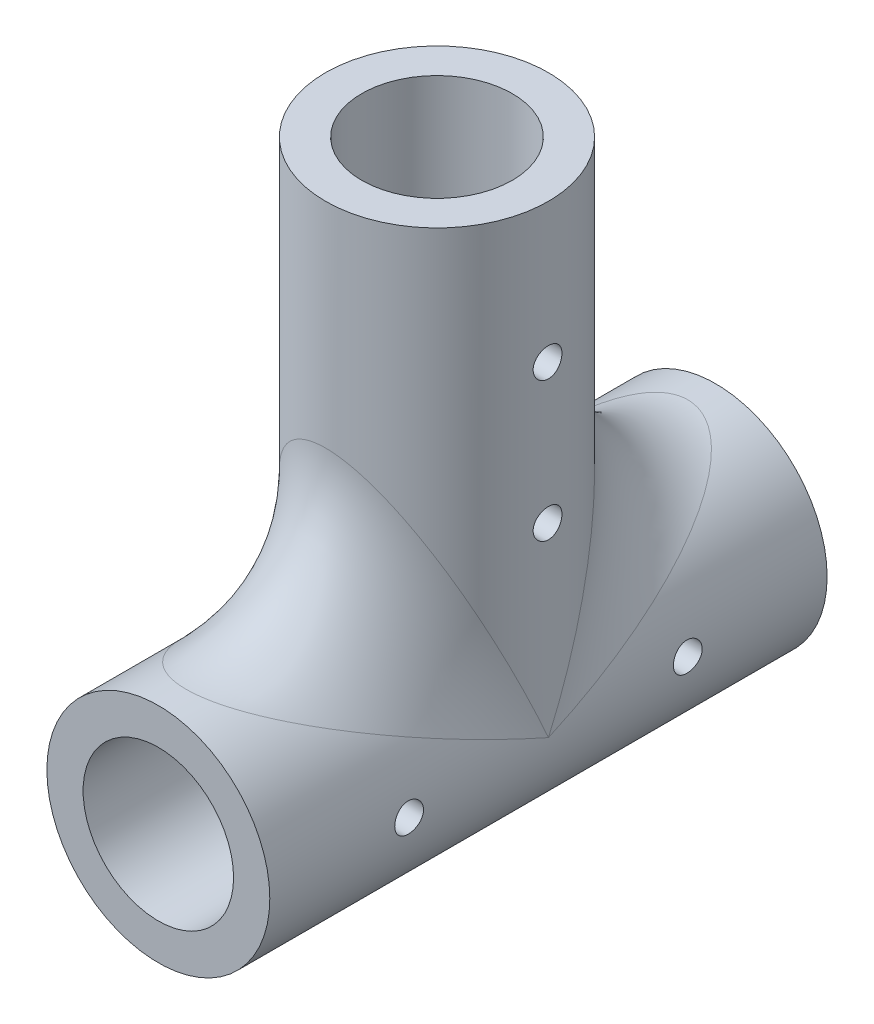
ISO-10303-21;
HEADER;
FILE_DESCRIPTION(('STEP AP214'),'2;1');
FILE_NAME('part.step','',(''),(''),'','','');
FILE_SCHEMA(('AUTOMOTIVE_DESIGN { 1 0 10303 214 1 1 1 1 }'));
ENDSEC;
DATA;
#1=APPLICATION_CONTEXT('core data for automotive mechanical design processes');
#2=APPLICATION_PROTOCOL_DEFINITION('international standard','automotive_design',2000,#1);
#3=PRODUCT_CONTEXT('',#1,'mechanical');
#4=PRODUCT('Part','Part','',(#3));
#5=PRODUCT_RELATED_PRODUCT_CATEGORY('part','',(#4));
#6=PRODUCT_DEFINITION_FORMATION('','',#4);
#7=PRODUCT_DEFINITION_CONTEXT('part definition',#1,'design');
#8=PRODUCT_DEFINITION('design','',#6,#7);
#9=PRODUCT_DEFINITION_SHAPE('','',#8);
#10=(LENGTH_UNIT() NAMED_UNIT(*) SI_UNIT(.MILLI.,.METRE.));
#11=(NAMED_UNIT(*) PLANE_ANGLE_UNIT() SI_UNIT($,.RADIAN.));
#12=(NAMED_UNIT(*) SI_UNIT($,.STERADIAN.) SOLID_ANGLE_UNIT());
#13=UNCERTAINTY_MEASURE_WITH_UNIT(LENGTH_MEASURE(1.E-05),#10,'distance_accuracy_value','');
#14=(GEOMETRIC_REPRESENTATION_CONTEXT(3) GLOBAL_UNCERTAINTY_ASSIGNED_CONTEXT((#13)) GLOBAL_UNIT_ASSIGNED_CONTEXT((#10,
#11,#12)) REPRESENTATION_CONTEXT('',''));
#15=CARTESIAN_POINT('',(0.,0.,0.));
#16=DIRECTION('',(0.,0.,1.));
#17=DIRECTION('',(1.,0.,0.));
#18=AXIS2_PLACEMENT_3D('',#15,#16,#17);
#19=CARTESIAN_POINT('',(0.,0.,60.));
#20=DIRECTION('',(0.,0.,-1.));
#21=DIRECTION('',(-1.,0.,0.));
#22=AXIS2_PLACEMENT_3D('',#19,#20,#21);
#23=CYLINDRICAL_SURFACE('',#22,12.);
#24=DIRECTION('',(0.,0.,-1.));
#25=VECTOR('',#24,1.);
#26=CARTESIAN_POINT('',(6.6332495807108,10.,60.));
#27=LINE('',#26,#25);
#28=CARTESIAN_POINT('',(6.6332495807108,10.,34.6486557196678));
#29=VERTEX_POINT('',#28);
#30=CARTESIAN_POINT('',(6.6332495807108,10.,25.3513442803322));
#31=VERTEX_POINT('',#30);
#32=EDGE_CURVE('E81',#29,#31,#27,.T.);
#33=ORIENTED_EDGE('',*,*,#32,.F.);
#34=CARTESIAN_POINT('',(0.,12.,21.9));
#35=CARTESIAN_POINT('',(-0.202903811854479,11.9999989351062,21.9000011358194));
#36=CARTESIAN_POINT('',(-0.405826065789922,11.9948420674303,21.9076353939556));
#37=CARTESIAN_POINT('',(-0.810021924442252,11.9743405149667,21.9380551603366));
#38=CARTESIAN_POINT('',(-1.0112953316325,11.9589946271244,21.9608424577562));
#39=CARTESIAN_POINT('',(-1.41073551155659,11.9184794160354,22.021237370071));
#40=CARTESIAN_POINT('',(-1.60890009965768,11.8933034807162,22.0588549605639));
#41=CARTESIAN_POINT('',(-2.00054421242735,11.8337256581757,22.1483646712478));
#42=CARTESIAN_POINT('',(-2.19402380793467,11.799323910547,22.2002565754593));
#43=CARTESIAN_POINT('',(-2.57408039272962,11.7222658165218,22.3173281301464));
#44=CARTESIAN_POINT('',(-2.76068786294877,11.679653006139,22.382437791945));
#45=CARTESIAN_POINT('',(-3.12710644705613,11.5869298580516,22.5253828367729));
#46=CARTESIAN_POINT('',(-3.3069148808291,11.5368166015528,22.6032231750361));
#47=CARTESIAN_POINT('',(-3.65878859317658,11.4300938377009,22.7708076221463));
#48=CARTESIAN_POINT('',(-3.83085699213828,11.3734869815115,22.8605468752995));
#49=CARTESIAN_POINT('',(-4.16673319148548,11.2547818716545,23.0512115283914));
#50=CARTESIAN_POINT('',(-4.33053789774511,11.1926815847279,23.1521410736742));
#51=CARTESIAN_POINT('',(-4.83598384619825,10.9887312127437,23.4887777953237));
#52=CARTESIAN_POINT('',(-5.16151990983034,10.8385643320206,23.7440411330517));
#53=CARTESIAN_POINT('',(-5.7680776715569,10.5283235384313,24.298371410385));
#54=CARTESIAN_POINT('',(-6.04903342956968,10.3682354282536,24.5975020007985));
#55=CARTESIAN_POINT('',(-6.45550804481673,10.1171814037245,25.1017270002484));
#56=CARTESIAN_POINT('',(-6.59687827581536,10.0253193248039,25.2938013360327));
#57=CARTESIAN_POINT('',(-6.86287622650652,9.84513635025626,25.6909333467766));
#58=CARTESIAN_POINT('',(-6.98750000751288,9.75681629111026,25.8959940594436));
#59=CARTESIAN_POINT('',(-7.21885422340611,9.58690360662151,26.3181534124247));
#60=CARTESIAN_POINT('',(-7.32561333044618,9.50530031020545,26.5352320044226));
#61=CARTESIAN_POINT('',(-7.52034182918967,9.35199576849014,26.9811258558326));
#62=CARTESIAN_POINT('',(-7.60831075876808,9.28029476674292,27.2099414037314));
#63=CARTESIAN_POINT('',(-7.74104546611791,9.16958734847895,27.609080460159));
#64=CARTESIAN_POINT('',(-7.79090434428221,9.12717175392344,27.7767787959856));
#65=CARTESIAN_POINT('',(-7.87997506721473,9.05038414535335,28.1166973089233));
#66=CARTESIAN_POINT('',(-7.91919376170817,9.01600695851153,28.288914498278));
#67=CARTESIAN_POINT('',(-7.98644138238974,8.95649344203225,28.6368749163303));
#68=CARTESIAN_POINT('',(-8.01448450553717,8.93134539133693,28.8126133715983));
#69=CARTESIAN_POINT('',(-8.05899946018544,8.89119969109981,29.166715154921));
#70=CARTESIAN_POINT('',(-8.07547124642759,8.87620208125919,29.3450784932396));
#71=CARTESIAN_POINT('',(-8.09659027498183,8.85694276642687,29.703907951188));
#72=CARTESIAN_POINT('',(-8.10118332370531,8.8527302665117,29.8843799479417));
#73=CARTESIAN_POINT('',(-8.09829886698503,8.85536891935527,30.2451451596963));
#74=CARTESIAN_POINT('',(-8.09082134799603,8.86222008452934,30.4254383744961));
#75=CARTESIAN_POINT('',(-8.06393191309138,8.8866938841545,30.7844984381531));
#76=CARTESIAN_POINT('',(-8.04451253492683,8.90432325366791,30.9632642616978));
#77=CARTESIAN_POINT('',(-7.9940823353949,8.94962517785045,31.317848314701));
#78=CARTESIAN_POINT('',(-7.9630712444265,8.97729796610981,31.4936664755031));
#79=CARTESIAN_POINT('',(-7.89176362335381,9.04003308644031,31.8326361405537));
#80=CARTESIAN_POINT('',(-7.8520055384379,9.07465950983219,31.9959827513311));
#81=CARTESIAN_POINT('',(-7.76293076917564,9.15097529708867,32.3183844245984));
#82=CARTESIAN_POINT('',(-7.7136105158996,9.19266729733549,32.477437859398));
#83=CARTESIAN_POINT('',(-7.55197161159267,9.32669718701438,32.9474470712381));
#84=CARTESIAN_POINT('',(-7.42596810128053,9.42799513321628,33.2512830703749));
#85=CARTESIAN_POINT('',(-7.17814164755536,9.61727034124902,33.760640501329));
#86=CARTESIAN_POINT('',(-7.06375615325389,9.70185903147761,33.9711780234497));
#87=CARTESIAN_POINT('',(-6.81786706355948,9.87620361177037,34.3799019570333));
#88=CARTESIAN_POINT('',(-6.6863572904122,9.96596136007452,34.5780838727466));
#89=CARTESIAN_POINT('',(-6.40682357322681,10.1479297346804,34.9617596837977));
#90=CARTESIAN_POINT('',(-6.25877319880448,10.2401441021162,35.1472324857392));
#91=CARTESIAN_POINT('',(-5.94694692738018,10.4243277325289,35.5045465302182));
#92=CARTESIAN_POINT('',(-5.78317283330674,10.5162970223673,35.6763893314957));
#93=CARTESIAN_POINT('',(-5.43902427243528,10.6983746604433,36.0070303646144));
#94=CARTESIAN_POINT('',(-5.25852595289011,10.7884618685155,36.1657115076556));
#95=CARTESIAN_POINT('',(-4.88262987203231,10.9637094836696,36.4674574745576));
#96=CARTESIAN_POINT('',(-4.68723082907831,11.0488694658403,36.6105209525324));
#97=CARTESIAN_POINT('',(-4.28264679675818,11.2118873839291,36.8795233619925));
#98=CARTESIAN_POINT('',(-4.07348692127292,11.2897580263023,37.0054922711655));
#99=CARTESIAN_POINT('',(-3.64211791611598,11.436206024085,37.2391362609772));
#100=CARTESIAN_POINT('',(-3.41991273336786,11.5047861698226,37.3468168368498));
#101=CARTESIAN_POINT('',(-3.01437433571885,11.6166903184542,37.5206965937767));
#102=CARTESIAN_POINT('',(-2.83332154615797,11.6622448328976,37.5908020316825));
#103=CARTESIAN_POINT('',(-2.46505685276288,11.7455997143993,37.7182536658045));
#104=CARTESIAN_POINT('',(-2.27784615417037,11.7834015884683,37.7756023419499));
#105=CARTESIAN_POINT('',(-1.89840885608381,11.8504490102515,37.8768381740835));
#106=CARTESIAN_POINT('',(-1.70618469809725,11.8796986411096,37.9207317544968));
#107=CARTESIAN_POINT('',(-1.31789101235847,11.9290175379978,37.994511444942));
#108=CARTESIAN_POINT('',(-1.12182139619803,11.9490865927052,38.0243972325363));
#109=CARTESIAN_POINT('',(-0.726626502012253,11.9796250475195,38.0698017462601));
#110=CARTESIAN_POINT('',(-0.527493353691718,11.9900629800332,38.0852733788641));
#111=CARTESIAN_POINT('',(-0.128353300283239,12.000974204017,38.1014454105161));
#112=CARTESIAN_POINT('',(0.0716536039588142,12.0014475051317,38.1021458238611));
#113=CARTESIAN_POINT('',(0.470956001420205,11.992417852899,38.0887644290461));
#114=CARTESIAN_POINT('',(0.670251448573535,11.9829142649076,38.0746816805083));
#115=CARTESIAN_POINT('',(1.06655466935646,11.9541595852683,38.0319475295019));
#116=CARTESIAN_POINT('',(1.2635624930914,11.9349087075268,38.0032964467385));
#117=CARTESIAN_POINT('',(1.64395549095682,11.8883244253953,37.9336555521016));
#118=CARTESIAN_POINT('',(1.82752560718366,11.8614492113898,37.8933633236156));
#119=CARTESIAN_POINT('',(2.19025003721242,11.7998584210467,37.8005042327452));
#120=CARTESIAN_POINT('',(2.36940281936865,11.7651401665,37.747933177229));
#121=CARTESIAN_POINT('',(2.72222170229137,11.6885452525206,37.6311227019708));
#122=CARTESIAN_POINT('',(2.89588929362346,11.646670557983,37.5668864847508));
#123=CARTESIAN_POINT('',(3.23705571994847,11.5564970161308,37.4273452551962));
#124=CARTESIAN_POINT('',(3.40455226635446,11.5081958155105,37.3520361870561));
#125=CARTESIAN_POINT('',(3.7461983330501,11.4017793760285,37.1843660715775));
#126=CARTESIAN_POINT('',(3.91976052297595,11.3431835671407,37.0911116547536));
#127=CARTESIAN_POINT('',(4.25824192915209,11.2205101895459,36.8931750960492));
#128=CARTESIAN_POINT('',(4.42315744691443,11.1564303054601,36.7884881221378));
#129=CARTESIAN_POINT('',(4.90430462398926,10.9575536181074,36.4582542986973));
#130=CARTESIAN_POINT('',(5.20697685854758,10.8161069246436,36.2165147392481));
#131=CARTESIAN_POINT('',(5.65467241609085,10.5858054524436,35.8038878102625));
#132=CARTESIAN_POINT('',(5.8128615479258,10.4995761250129,35.6454114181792));
#133=CARTESIAN_POINT('',(6.11540861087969,10.3262821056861,35.3161747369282));
#134=CARTESIAN_POINT('',(6.25976932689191,10.2392175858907,35.145416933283));
#135=CARTESIAN_POINT('',(6.53424359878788,10.0662800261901,34.7920492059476));
#136=CARTESIAN_POINT('',(6.66434893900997,9.98040769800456,34.609432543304));
#137=CARTESIAN_POINT('',(6.90958308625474,9.81222652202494,34.2329862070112));
#138=CARTESIAN_POINT('',(7.02471447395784,9.72991706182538,34.039158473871));
#139=CARTESIAN_POINT('',(7.31480529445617,9.51552000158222,33.5002906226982));
#140=CARTESIAN_POINT('',(7.47500390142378,9.38906537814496,33.1446456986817));
#141=CARTESIAN_POINT('',(7.67702435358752,9.22339061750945,32.590739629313));
#142=CARTESIAN_POINT('',(7.73796542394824,9.17218517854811,32.4027901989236));
#143=CARTESIAN_POINT('',(7.84642506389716,9.07957564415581,32.0206443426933));
#144=CARTESIAN_POINT('',(7.89394618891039,9.0381696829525,31.8264491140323));
#145=CARTESIAN_POINT('',(7.96847381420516,8.97248551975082,31.4636268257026));
#146=CARTESIAN_POINT('',(7.99752079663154,8.94654550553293,31.2957167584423));
#147=CARTESIAN_POINT('',(8.04504996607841,8.90383049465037,30.957264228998));
#148=CARTESIAN_POINT('',(8.06353415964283,8.88705375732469,30.7867222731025));
#149=CARTESIAN_POINT('',(8.08963135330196,8.86330522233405,30.444230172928));
#150=CARTESIAN_POINT('',(8.09725113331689,8.85632730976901,30.2722809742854));
#151=CARTESIAN_POINT('',(8.1015091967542,8.85243221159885,29.9281280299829));
#152=CARTESIAN_POINT('',(8.09814723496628,8.85551525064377,29.7559242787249));
#153=CARTESIAN_POINT('',(8.08050696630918,8.87161503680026,29.4127224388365));
#154=CARTESIAN_POINT('',(8.06623985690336,8.88462159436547,29.2417232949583));
#155=CARTESIAN_POINT('',(8.02705472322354,8.92003705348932,28.9019713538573));
#156=CARTESIAN_POINT('',(8.00213678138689,8.94244588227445,28.7332185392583));
#157=CARTESIAN_POINT('',(7.91188469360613,9.02267918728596,28.2315431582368));
#158=CARTESIAN_POINT('',(7.83106198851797,9.09350079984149,27.9033819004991));
#159=CARTESIAN_POINT('',(7.59926833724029,9.28873261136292,27.1613351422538));
#160=CARTESIAN_POINT('',(7.43399222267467,9.42309716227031,26.7545749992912));
#161=CARTESIAN_POINT('',(7.14276087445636,9.64343935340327,26.1740265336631));
#162=CARTESIAN_POINT('',(7.03832057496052,9.72011734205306,25.9852443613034));
#163=CARTESIAN_POINT('',(6.81558093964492,9.87757162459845,25.6177673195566));
#164=CARTESIAN_POINT('',(6.69728257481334,9.95834763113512,25.4390717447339));
#165=CARTESIAN_POINT('',(6.44505490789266,10.1234594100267,25.0889177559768));
#166=CARTESIAN_POINT('',(6.31087119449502,10.2078336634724,24.917661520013));
#167=CARTESIAN_POINT('',(6.02917028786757,10.3767085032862,24.586464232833));
#168=CARTESIAN_POINT('',(5.8816497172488,10.4612091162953,24.4265260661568));
#169=CARTESIAN_POINT('',(5.57370135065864,10.628478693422,24.1185652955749));
#170=CARTESIAN_POINT('',(5.41327216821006,10.7112474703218,23.9705439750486));
#171=CARTESIAN_POINT('',(5.07992165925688,10.8733044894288,23.6871352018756));
#172=CARTESIAN_POINT('',(4.90699852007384,10.9525922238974,23.5517495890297));
#173=CARTESIAN_POINT('',(4.52899371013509,11.1146352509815,23.2800058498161));
#174=CARTESIAN_POINT('',(4.322483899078,11.1967747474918,23.1452567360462));
#175=CARTESIAN_POINT('',(3.89565643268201,11.3523309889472,22.8940065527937));
#176=CARTESIAN_POINT('',(3.67534569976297,11.4257520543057,22.777496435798));
#177=CARTESIAN_POINT('',(3.22248859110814,11.5616332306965,22.5644040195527));
#178=CARTESIAN_POINT('',(2.98996222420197,11.6241105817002,22.4677903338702));
#179=CARTESIAN_POINT('',(2.51420415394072,11.7362009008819,22.2959321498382));
#180=CARTESIAN_POINT('',(2.27097787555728,11.7858203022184,22.2206769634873));
#181=CARTESIAN_POINT('',(1.85998654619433,11.8561401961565,22.1146310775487));
#182=CARTESIAN_POINT('',(1.69454764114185,11.8809442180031,22.0774120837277));
#183=CARTESIAN_POINT('',(1.36082267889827,11.9237761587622,22.0133229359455));
#184=CARTESIAN_POINT('',(1.19253715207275,11.9418053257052,21.9864508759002));
#185=CARTESIAN_POINT('',(0.854019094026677,11.9707772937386,21.9433404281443));
#186=CARTESIAN_POINT('',(0.683786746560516,11.9817207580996,21.9271010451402));
#187=CARTESIAN_POINT('',(0.342373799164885,11.9963315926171,21.9054317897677));
#188=CARTESIAN_POINT('',(0.171193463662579,12.0000008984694,21.8999990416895));
#189=CARTESIAN_POINT('',(0.,12.,21.9));
#190=B_SPLINE_CURVE_WITH_KNOTS('',3,(#34,#35,#36,#37,#38,#39,#40,#41,#42,#43,#44,#45,#46,#47,
#48,#49,#50,#51,#52,#53,#54,#55,#56,#57,#58,#59,#60,#61,#62,#63,#64,#65,#66,#67,#68,#69,#70,#71,
#72,#73,#74,#75,#76,#77,#78,#79,#80,#81,#82,#83,#84,#85,#86,#87,#88,#89,#90,#91,#92,#93,#94,#95,
#96,#97,#98,#99,#100,#101,#102,#103,#104,#105,#106,#107,#108,#109,#110,#111,#112,#113,#114,#115,
#116,#117,#118,#119,#120,#121,#122,#123,#124,#125,#126,#127,#128,#129,#130,#131,#132,#133,#134,
#135,#136,#137,#138,#139,#140,#141,#142,#143,#144,#145,#146,#147,#148,#149,#150,#151,#152,#153,
#154,#155,#156,#157,#158,#159,#160,#161,#162,#163,#164,#165,#166,#167,#168,#169,#170,#171,#172,
#173,#174,#175,#176,#177,#178,#179,#180,#181,#182,#183,#184,#185,#186,#187,#188,#189),
.UNSPECIFIED.,.T.,.F.,(4,2,2,2,2,2,2,2,2,2,2,2,2,2,2,2,2,2,2,2,2,2,2,2,2,2,2,2,2,2,2,2,2,2,2,2,
2,2,2,2,2,2,2,2,2,2,2,2,2,2,2,2,2,2,2,2,2,2,2,2,2,2,2,2,2,2,2,2,2,2,2,2,2,2,2,2,2,4),(0.,
0.60853623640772,1.21714433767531,1.82616251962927,2.43517148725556,3.04103610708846,
3.64713711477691,4.2529915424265,4.85907115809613,6.17409180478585,7.49103976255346,
8.25698140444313,9.02310287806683,9.78798270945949,10.5528813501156,11.0924587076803,
11.6316878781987,12.1702298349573,12.7087738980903,13.2497706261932,13.7907679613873,
14.3321036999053,14.8734520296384,15.3878796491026,15.9024996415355,16.9316426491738,
17.6930984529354,18.4548297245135,19.2177960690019,19.9806750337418,20.7497407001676,
21.51887259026,22.2866377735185,23.0541718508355,23.6518430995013,24.2493980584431,
24.8466672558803,25.4439502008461,26.0431777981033,26.6424048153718,27.2416699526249,
27.8409219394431,28.409856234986,28.9789851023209,29.5479579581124,30.1171397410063,
30.7331751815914,31.3494720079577,32.5819277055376,33.3011996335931,34.02032640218,
34.7398654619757,35.4592803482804,36.6838862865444,37.2956191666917,37.9072354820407,
38.4237954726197,38.9402573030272,39.4563966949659,39.9725476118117,40.4881692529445,
41.0037869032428,42.0355518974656,43.405241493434,44.0916507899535,44.7780120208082,
45.4774220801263,46.1770097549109,46.8766726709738,47.5764373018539,48.3550427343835,
49.1332607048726,49.9102414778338,50.6868327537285,51.2005447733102,51.7141621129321,
52.2277313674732,52.7411639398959),.UNSPECIFIED.);
#191=EDGE_CURVE('E91',#29,#31,#190,.T.);
#192=ORIENTED_EDGE('',*,*,#191,.T.);
#193=EDGE_LOOP('',(#33,#192));
#194=FACE_BOUND('',#193,.T.);
#195=ADVANCED_FACE('F39',(#194),#23,.T.);
#196=DIRECTION('',(0.,0.,-1.));
#197=VECTOR('',#196,1.);
#198=CARTESIAN_POINT('',(-6.6332495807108,10.,60.));
#199=LINE('',#198,#197);
#200=CARTESIAN_POINT('',(-6.6332495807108,10.,25.3513442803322));
#201=VERTEX_POINT('',#200);
#202=CARTESIAN_POINT('',(-6.6332495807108,10.,34.6486557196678));
#203=VERTEX_POINT('',#202);
#204=EDGE_CURVE('E82',#201,#203,#199,.F.);
#205=ORIENTED_EDGE('',*,*,#204,.F.);
#206=EDGE_CURVE('E98',#201,#203,#190,.T.);
#207=ORIENTED_EDGE('',*,*,#206,.T.);
#208=EDGE_LOOP('',(#205,#207));
#209=FACE_BOUND('',#208,.T.);
#210=ADVANCED_FACE('F258',(#209),#23,.T.);
#211=CARTESIAN_POINT('',(-12.,0.,46.55));
#212=CARTESIAN_POINT('',(-11.9999987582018,-0.0866770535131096,46.5499963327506));
#213=CARTESIAN_POINT('',(-11.9990509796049,-0.173407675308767,46.5427049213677));
#214=CARTESIAN_POINT('',(-11.9953612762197,-0.344453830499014,46.5137340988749));
#215=CARTESIAN_POINT('',(-11.9926174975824,-0.428766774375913,46.492039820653));
#216=CARTESIAN_POINT('',(-11.9856447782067,-0.592476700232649,46.4349145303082));
#217=CARTESIAN_POINT('',(-11.9814168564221,-0.671877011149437,46.399492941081));
#218=CARTESIAN_POINT('',(-11.9719456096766,-0.823591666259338,46.3159395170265));
#219=CARTESIAN_POINT('',(-11.9667024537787,-0.895907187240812,46.267809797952));
#220=CARTESIAN_POINT('',(-11.9557514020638,-1.03183805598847,46.1599048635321));
#221=CARTESIAN_POINT('',(-11.9500412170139,-1.09540587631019,46.1000700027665));
#222=CARTESIAN_POINT('',(-11.9388180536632,-1.21162744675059,45.9705814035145));
#223=CARTESIAN_POINT('',(-11.933305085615,-1.2642806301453,45.9009271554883));
#224=CARTESIAN_POINT('',(-11.9230780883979,-1.35735663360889,45.7534664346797));
#225=CARTESIAN_POINT('',(-11.9183670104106,-1.39773468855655,45.675631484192));
#226=CARTESIAN_POINT('',(-11.9103075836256,-1.46482834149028,45.5142142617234));
#227=CARTESIAN_POINT('',(-11.906959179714,-1.4915444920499,45.4306322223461));
#228=CARTESIAN_POINT('',(-11.9020262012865,-1.53041101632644,45.260587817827));
#229=CARTESIAN_POINT('',(-11.9004318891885,-1.54264183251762,45.1741441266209));
#230=CARTESIAN_POINT('',(-11.899157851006,-1.55243946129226,45.000417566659));
#231=CARTESIAN_POINT('',(-11.8994780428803,-1.55000690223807,44.9131347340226));
#232=CARTESIAN_POINT('',(-11.9019879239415,-1.53061281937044,44.7407693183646));
#233=CARTESIAN_POINT('',(-11.90416619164,-1.5137400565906,44.6556765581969));
#234=CARTESIAN_POINT('',(-11.9101289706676,-1.46608308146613,44.4895403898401));
#235=CARTESIAN_POINT('',(-11.913913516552,-1.43529856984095,44.4084970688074));
#236=CARTESIAN_POINT('',(-11.9226753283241,-1.36059703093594,44.2524854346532));
#237=CARTESIAN_POINT('',(-11.9276560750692,-1.31664158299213,44.1775357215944));
#238=CARTESIAN_POINT('',(-11.9382464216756,-1.21687337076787,44.0360427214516));
#239=CARTESIAN_POINT('',(-11.9438560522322,-1.16106002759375,43.969499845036));
#240=CARTESIAN_POINT('',(-11.9551228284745,-1.03866916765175,43.8461943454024));
#241=CARTESIAN_POINT('',(-11.9607800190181,-0.972015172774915,43.7895076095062));
#242=CARTESIAN_POINT('',(-11.9714657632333,-0.830097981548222,43.6881149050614));
#243=CARTESIAN_POINT('',(-11.9764943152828,-0.754834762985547,43.6434089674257));
#244=CARTESIAN_POINT('',(-11.9853596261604,-0.597775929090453,43.567246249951));
#245=CARTESIAN_POINT('',(-11.989195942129,-0.515977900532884,43.5357943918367));
#246=CARTESIAN_POINT('',(-11.9952405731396,-0.34820092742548,43.4870937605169));
#247=CARTESIAN_POINT('',(-11.9974489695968,-0.26222219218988,43.469844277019));
#248=CARTESIAN_POINT('',(-11.9999783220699,-0.0891803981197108,43.4501367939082));
#249=CARTESIAN_POINT('',(-12.0003126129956,-0.00212942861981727,43.447574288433));
#250=CARTESIAN_POINT('',(-11.999092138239,0.171160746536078,43.45703746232));
#251=CARTESIAN_POINT('',(-11.9975374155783,0.257399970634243,43.4690628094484));
#252=CARTESIAN_POINT('',(-11.9927219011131,0.426309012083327,43.5072734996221));
#253=CARTESIAN_POINT('',(-11.9894671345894,0.508990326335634,43.533408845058));
#254=CARTESIAN_POINT('',(-11.9816158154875,0.668796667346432,43.5990455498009));
#255=CARTESIAN_POINT('',(-11.9770192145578,0.745921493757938,43.6385473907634));
#256=CARTESIAN_POINT('',(-11.9669631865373,0.892891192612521,43.7300474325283));
#257=CARTESIAN_POINT('',(-11.9614991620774,0.962693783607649,43.7821130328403));
#258=CARTESIAN_POINT('',(-11.9503334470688,1.09260699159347,43.89716752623));
#259=CARTESIAN_POINT('',(-11.944631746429,1.15271719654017,43.9601568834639));
#260=CARTESIAN_POINT('',(-11.9335919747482,1.26191158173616,44.0957319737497));
#261=CARTESIAN_POINT('',(-11.9282563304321,1.31092636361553,44.1683738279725));
#262=CARTESIAN_POINT('',(-11.918593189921,1.39605866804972,44.3209203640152));
#263=CARTESIAN_POINT('',(-11.9142656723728,1.43217646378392,44.4008248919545));
#264=CARTESIAN_POINT('',(-11.907125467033,1.49037792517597,44.5654072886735));
#265=CARTESIAN_POINT('',(-11.9043086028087,1.51250031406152,44.6500712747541));
#266=CARTESIAN_POINT('',(-11.9004968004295,1.54220748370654,44.8219511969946));
#267=CARTESIAN_POINT('',(-11.8995017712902,1.549792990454,44.9091670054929));
#268=CARTESIAN_POINT('',(-11.8994490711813,1.55019713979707,45.0829842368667));
#269=CARTESIAN_POINT('',(-11.9003770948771,1.54312481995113,45.1695854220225));
#270=CARTESIAN_POINT('',(-11.9040351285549,1.51464539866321,45.3403570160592));
#271=CARTESIAN_POINT('',(-11.9067651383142,1.49323829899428,45.4245274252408));
#272=CARTESIAN_POINT('',(-11.9137150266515,1.43673178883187,45.5880313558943));
#273=CARTESIAN_POINT('',(-11.9179342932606,1.40163800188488,45.6673668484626));
#274=CARTESIAN_POINT('',(-11.9273882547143,1.31876501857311,45.8190407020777));
#275=CARTESIAN_POINT('',(-11.9326229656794,1.270985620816,45.8913789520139));
#276=CARTESIAN_POINT('',(-11.9435646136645,1.16369438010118,46.0275618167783));
#277=CARTESIAN_POINT('',(-11.9492746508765,1.10410133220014,46.0913422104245));
#278=CARTESIAN_POINT('',(-11.960496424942,0.975044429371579,46.2080387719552));
#279=CARTESIAN_POINT('',(-11.9660081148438,0.905578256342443,46.260952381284));
#280=CARTESIAN_POINT('',(-11.9762370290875,0.758422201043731,46.3545977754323));
#281=CARTESIAN_POINT('',(-11.9809509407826,0.680700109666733,46.3952792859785));
#282=CARTESIAN_POINT('',(-11.989019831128,0.5195087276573,46.4629542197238));
#283=CARTESIAN_POINT('',(-11.9923762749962,0.436045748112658,46.4899624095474));
#284=CARTESIAN_POINT('',(-11.9965495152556,0.293466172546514,46.5231108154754));
#285=CARTESIAN_POINT('',(-11.9978370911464,0.23524598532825,46.5331796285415));
#286=CARTESIAN_POINT('',(-11.999562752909,0.118025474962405,46.5466254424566));
#287=CARTESIAN_POINT('',(-12.0000008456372,0.059025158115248,46.5500024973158));
#288=CARTESIAN_POINT('',(-12.,0.,46.55));
#289=B_SPLINE_CURVE_WITH_KNOTS('',3,(#211,#212,#213,#214,#215,#216,#217,#218,#219,#220,#221,
#222,#223,#224,#225,#226,#227,#228,#229,#230,#231,#232,#233,#234,#235,#236,#237,#238,#239,#240,
#241,#242,#243,#244,#245,#246,#247,#248,#249,#250,#251,#252,#253,#254,#255,#256,#257,#258,#259,
#260,#261,#262,#263,#264,#265,#266,#267,#268,#269,#270,#271,#272,#273,#274,#275,#276,#277,#278,
#279,#280,#281,#282,#283,#284,#285,#286,#287,#288),.UNSPECIFIED.,.T.,.F.,(4,2,2,2,2,2,2,2,2,2,2,
2,2,2,2,2,2,2,2,2,2,2,2,2,2,2,2,2,2,2,2,2,2,2,2,2,2,2,4),(0.,0.259815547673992,
0.519899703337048,0.779805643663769,1.03966833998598,1.30089142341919,1.56212806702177,
1.82430626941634,2.08647386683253,2.34717861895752,2.60787219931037,2.86697476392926,
3.12608290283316,3.385954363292,3.64583851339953,3.90764265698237,4.16944747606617,
4.43134942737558,4.69323827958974,4.95326131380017,5.21327842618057,5.47238017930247,
5.73149127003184,5.99202456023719,6.25256892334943,6.51470045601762,6.77682643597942,
7.03822394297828,7.29960839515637,7.55905542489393,7.81850242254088,8.077842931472,
8.33718755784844,8.59838087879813,8.85963562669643,9.12194990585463,9.38398028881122,
9.5609103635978,9.7378390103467),.UNSPECIFIED.);
#290=CARTESIAN_POINT('',(-12.,0.,46.55));
#291=VERTEX_POINT('',#290);
#292=EDGE_CURVE('E446',#291,#291,#289,.T.);
#293=ORIENTED_EDGE('',*,*,#292,.T.);
#294=EDGE_LOOP('',(#293));
#295=FACE_BOUND('',#294,.T.);
#296=CARTESIAN_POINT('',(12.,0.,43.45));
#297=CARTESIAN_POINT('',(11.9999987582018,-0.0866770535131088,43.4500036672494));
#298=CARTESIAN_POINT('',(11.9990509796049,-0.173407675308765,43.4572950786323));
#299=CARTESIAN_POINT('',(11.9953612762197,-0.344453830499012,43.4862659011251));
#300=CARTESIAN_POINT('',(11.9926174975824,-0.428766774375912,43.507960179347));
#301=CARTESIAN_POINT('',(11.9856447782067,-0.592476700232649,43.5650854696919));
#302=CARTESIAN_POINT('',(11.9814168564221,-0.671877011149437,43.600507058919));
#303=CARTESIAN_POINT('',(11.9719456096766,-0.823591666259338,43.6840604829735));
#304=CARTESIAN_POINT('',(11.9667024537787,-0.895907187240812,43.732190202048));
#305=CARTESIAN_POINT('',(11.9557514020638,-1.03183805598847,43.840095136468));
#306=CARTESIAN_POINT('',(11.9500412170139,-1.09540587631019,43.8999299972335));
#307=CARTESIAN_POINT('',(11.9388180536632,-1.21162744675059,44.0294185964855));
#308=CARTESIAN_POINT('',(11.933305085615,-1.2642806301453,44.0990728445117));
#309=CARTESIAN_POINT('',(11.9230780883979,-1.35735663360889,44.2465335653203));
#310=CARTESIAN_POINT('',(11.9183670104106,-1.39773468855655,44.324368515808));
#311=CARTESIAN_POINT('',(11.9103075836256,-1.46482834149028,44.4857857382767));
#312=CARTESIAN_POINT('',(11.906959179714,-1.4915444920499,44.5693677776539));
#313=CARTESIAN_POINT('',(11.9020262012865,-1.53041101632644,44.739412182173));
#314=CARTESIAN_POINT('',(11.9004318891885,-1.54264183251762,44.8258558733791));
#315=CARTESIAN_POINT('',(11.899157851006,-1.55243946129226,44.999582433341));
#316=CARTESIAN_POINT('',(11.8994780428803,-1.55000690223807,45.0868652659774));
#317=CARTESIAN_POINT('',(11.9019879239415,-1.53061281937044,45.2592306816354));
#318=CARTESIAN_POINT('',(11.90416619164,-1.5137400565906,45.3443234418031));
#319=CARTESIAN_POINT('',(11.9101289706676,-1.46608308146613,45.5104596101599));
#320=CARTESIAN_POINT('',(11.913913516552,-1.43529856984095,45.5915029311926));
#321=CARTESIAN_POINT('',(11.9226753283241,-1.36059703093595,45.7475145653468));
#322=CARTESIAN_POINT('',(11.9276560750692,-1.31664158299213,45.8224642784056));
#323=CARTESIAN_POINT('',(11.9382464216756,-1.21687337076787,45.9639572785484));
#324=CARTESIAN_POINT('',(11.9438560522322,-1.16106002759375,46.030500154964));
#325=CARTESIAN_POINT('',(11.9551228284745,-1.03866916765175,46.1538056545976));
#326=CARTESIAN_POINT('',(11.9607800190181,-0.972015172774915,46.2104923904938));
#327=CARTESIAN_POINT('',(11.9714657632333,-0.830097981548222,46.3118850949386));
#328=CARTESIAN_POINT('',(11.9764943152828,-0.754834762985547,46.3565910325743));
#329=CARTESIAN_POINT('',(11.9853596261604,-0.597775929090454,46.432753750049));
#330=CARTESIAN_POINT('',(11.989195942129,-0.515977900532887,46.4642056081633));
#331=CARTESIAN_POINT('',(11.9952405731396,-0.348200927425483,46.5129062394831));
#332=CARTESIAN_POINT('',(11.9974489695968,-0.262222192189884,46.530155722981));
#333=CARTESIAN_POINT('',(11.9999783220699,-0.0891803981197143,46.5498632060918));
#334=CARTESIAN_POINT('',(12.0003126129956,-0.00212942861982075,46.552425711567));
#335=CARTESIAN_POINT('',(11.999092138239,0.171160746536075,46.54296253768));
#336=CARTESIAN_POINT('',(11.9975374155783,0.257399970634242,46.5309371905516));
#337=CARTESIAN_POINT('',(11.9927219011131,0.426309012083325,46.4927265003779));
#338=CARTESIAN_POINT('',(11.9894671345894,0.508990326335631,46.466591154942));
#339=CARTESIAN_POINT('',(11.9816158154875,0.66879666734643,46.4009544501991));
#340=CARTESIAN_POINT('',(11.9770192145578,0.745921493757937,46.3614526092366));
#341=CARTESIAN_POINT('',(11.9669631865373,0.892891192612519,46.2699525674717));
#342=CARTESIAN_POINT('',(11.9614991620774,0.962693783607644,46.2178869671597));
#343=CARTESIAN_POINT('',(11.9503334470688,1.09260699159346,46.10283247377));
#344=CARTESIAN_POINT('',(11.944631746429,1.15271719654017,46.0398431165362));
#345=CARTESIAN_POINT('',(11.9335919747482,1.26191158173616,45.9042680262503));
#346=CARTESIAN_POINT('',(11.9282563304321,1.31092636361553,45.8316261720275));
#347=CARTESIAN_POINT('',(11.918593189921,1.39605866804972,45.6790796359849));
#348=CARTESIAN_POINT('',(11.9142656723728,1.43217646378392,45.5991751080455));
#349=CARTESIAN_POINT('',(11.907125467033,1.49037792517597,45.4345927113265));
#350=CARTESIAN_POINT('',(11.9043086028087,1.51250031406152,45.3499287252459));
#351=CARTESIAN_POINT('',(11.9004968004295,1.54220748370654,45.1780488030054));
#352=CARTESIAN_POINT('',(11.8995017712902,1.549792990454,45.0908329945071));
#353=CARTESIAN_POINT('',(11.8994490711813,1.55019713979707,44.9170157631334));
#354=CARTESIAN_POINT('',(11.9003770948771,1.54312481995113,44.8304145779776));
#355=CARTESIAN_POINT('',(11.9040351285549,1.51464539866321,44.6596429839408));
#356=CARTESIAN_POINT('',(11.9067651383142,1.49323829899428,44.5754725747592));
#357=CARTESIAN_POINT('',(11.9137150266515,1.43673178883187,44.4119686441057));
#358=CARTESIAN_POINT('',(11.9179342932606,1.40163800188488,44.3326331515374));
#359=CARTESIAN_POINT('',(11.9273882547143,1.31876501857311,44.1809592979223));
#360=CARTESIAN_POINT('',(11.9326229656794,1.270985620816,44.1086210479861));
#361=CARTESIAN_POINT('',(11.9435646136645,1.16369438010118,43.9724381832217));
#362=CARTESIAN_POINT('',(11.9492746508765,1.10410133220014,43.9086577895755));
#363=CARTESIAN_POINT('',(11.960496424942,0.975044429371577,43.7919612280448));
#364=CARTESIAN_POINT('',(11.9660081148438,0.905578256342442,43.739047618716));
#365=CARTESIAN_POINT('',(11.9762370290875,0.75842220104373,43.6454022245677));
#366=CARTESIAN_POINT('',(11.9809509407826,0.680700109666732,43.6047207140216));
#367=CARTESIAN_POINT('',(11.989019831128,0.5195087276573,43.5370457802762));
#368=CARTESIAN_POINT('',(11.9923762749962,0.436045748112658,43.5100375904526));
#369=CARTESIAN_POINT('',(11.9965495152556,0.293466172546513,43.4768891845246));
#370=CARTESIAN_POINT('',(11.9978370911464,0.235245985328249,43.4668203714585));
#371=CARTESIAN_POINT('',(11.999562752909,0.118025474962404,43.4533745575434));
#372=CARTESIAN_POINT('',(12.0000008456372,0.0590251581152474,43.4499975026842));
#373=CARTESIAN_POINT('',(12.,0.,43.45));
#374=B_SPLINE_CURVE_WITH_KNOTS('',3,(#296,#297,#298,#299,#300,#301,#302,#303,#304,#305,#306,
#307,#308,#309,#310,#311,#312,#313,#314,#315,#316,#317,#318,#319,#320,#321,#322,#323,#324,#325,
#326,#327,#328,#329,#330,#331,#332,#333,#334,#335,#336,#337,#338,#339,#340,#341,#342,#343,#344,
#345,#346,#347,#348,#349,#350,#351,#352,#353,#354,#355,#356,#357,#358,#359,#360,#361,#362,#363,
#364,#365,#366,#367,#368,#369,#370,#371,#372,#373),.UNSPECIFIED.,.T.,.F.,(4,2,2,2,2,2,2,2,2,2,2,
2,2,2,2,2,2,2,2,2,2,2,2,2,2,2,2,2,2,2,2,2,2,2,2,2,2,2,4),(0.,0.25981554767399,0.519899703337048,
0.779805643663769,1.03966833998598,1.30089142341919,1.56212806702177,1.82430626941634,
2.08647386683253,2.34717861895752,2.60787219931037,2.86697476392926,3.12608290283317,
3.385954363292,3.64583851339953,3.90764265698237,4.16944747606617,4.43134942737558,
4.69323827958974,4.95326131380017,5.21327842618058,5.47238017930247,5.73149127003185,
5.99202456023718,6.25256892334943,6.51470045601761,6.77682643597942,7.03822394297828,
7.29960839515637,7.55905542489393,7.81850242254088,8.077842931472,8.33718755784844,
8.59838087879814,8.85963562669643,9.12194990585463,9.38398028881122,9.5609103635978,
9.7378390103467),.UNSPECIFIED.);
#375=CARTESIAN_POINT('',(12.,0.,43.45));
#376=VERTEX_POINT('',#375);
#377=EDGE_CURVE('E440',#376,#376,#374,.T.);
#378=ORIENTED_EDGE('',*,*,#377,.T.);
#379=EDGE_LOOP('',(#378));
#380=FACE_BOUND('',#379,.T.);
#381=CARTESIAN_POINT('',(-12.,0.,16.55));
#382=CARTESIAN_POINT('',(-11.9999987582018,-0.0866770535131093,16.5499963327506));
#383=CARTESIAN_POINT('',(-11.9990509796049,-0.173407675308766,16.5427049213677));
#384=CARTESIAN_POINT('',(-11.9953612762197,-0.344453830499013,16.5137340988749));
#385=CARTESIAN_POINT('',(-11.9926174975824,-0.428766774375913,16.492039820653));
#386=CARTESIAN_POINT('',(-11.9856447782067,-0.592476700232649,16.4349145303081));
#387=CARTESIAN_POINT('',(-11.9814168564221,-0.671877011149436,16.399492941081));
#388=CARTESIAN_POINT('',(-11.9719456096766,-0.823591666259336,16.3159395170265));
#389=CARTESIAN_POINT('',(-11.9667024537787,-0.89590718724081,16.267809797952));
#390=CARTESIAN_POINT('',(-11.9557514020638,-1.03183805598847,16.159904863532));
#391=CARTESIAN_POINT('',(-11.9500412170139,-1.09540587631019,16.1000700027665));
#392=CARTESIAN_POINT('',(-11.9388180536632,-1.2116274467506,15.9705814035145));
#393=CARTESIAN_POINT('',(-11.933305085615,-1.2642806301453,15.9009271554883));
#394=CARTESIAN_POINT('',(-11.9230780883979,-1.35735663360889,15.7534664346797));
#395=CARTESIAN_POINT('',(-11.9183670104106,-1.39773468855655,15.6756314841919));
#396=CARTESIAN_POINT('',(-11.9103075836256,-1.46482834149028,15.5142142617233));
#397=CARTESIAN_POINT('',(-11.906959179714,-1.4915444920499,15.4306322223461));
#398=CARTESIAN_POINT('',(-11.9020262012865,-1.53041101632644,15.260587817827));
#399=CARTESIAN_POINT('',(-11.9004318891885,-1.54264183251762,15.1741441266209));
#400=CARTESIAN_POINT('',(-11.899157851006,-1.55243946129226,15.000417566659));
#401=CARTESIAN_POINT('',(-11.8994780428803,-1.55000690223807,14.9131347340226));
#402=CARTESIAN_POINT('',(-11.9019879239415,-1.53061281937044,14.7407693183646));
#403=CARTESIAN_POINT('',(-11.90416619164,-1.51374005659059,14.6556765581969));
#404=CARTESIAN_POINT('',(-11.9101289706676,-1.46608308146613,14.4895403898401));
#405=CARTESIAN_POINT('',(-11.913913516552,-1.43529856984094,14.4084970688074));
#406=CARTESIAN_POINT('',(-11.9226753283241,-1.36059703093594,14.2524854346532));
#407=CARTESIAN_POINT('',(-11.9276560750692,-1.31664158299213,14.1775357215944));
#408=CARTESIAN_POINT('',(-11.9382464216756,-1.21687337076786,14.0360427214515));
#409=CARTESIAN_POINT('',(-11.9438560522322,-1.16106002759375,13.969499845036));
#410=CARTESIAN_POINT('',(-11.9551228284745,-1.03866916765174,13.8461943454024));
#411=CARTESIAN_POINT('',(-11.9607800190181,-0.972015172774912,13.7895076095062));
#412=CARTESIAN_POINT('',(-11.9714657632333,-0.830097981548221,13.6881149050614));
#413=CARTESIAN_POINT('',(-11.9764943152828,-0.754834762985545,13.6434089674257));
#414=CARTESIAN_POINT('',(-11.9853596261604,-0.597775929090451,13.567246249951));
#415=CARTESIAN_POINT('',(-11.989195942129,-0.515977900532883,13.5357943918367));
#416=CARTESIAN_POINT('',(-11.9952405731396,-0.348200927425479,13.4870937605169));
#417=CARTESIAN_POINT('',(-11.9974489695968,-0.26222219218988,13.469844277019));
#418=CARTESIAN_POINT('',(-11.9999783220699,-0.0891803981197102,13.4501367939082));
#419=CARTESIAN_POINT('',(-12.0003126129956,-0.00212942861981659,13.447574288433));
#420=CARTESIAN_POINT('',(-11.999092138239,0.171160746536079,13.45703746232));
#421=CARTESIAN_POINT('',(-11.9975374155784,0.257399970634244,13.4690628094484));
#422=CARTESIAN_POINT('',(-11.9927219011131,0.426309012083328,13.5072734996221));
#423=CARTESIAN_POINT('',(-11.9894671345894,0.508990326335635,13.533408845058));
#424=CARTESIAN_POINT('',(-11.9816158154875,0.668796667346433,13.5990455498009));
#425=CARTESIAN_POINT('',(-11.9770192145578,0.745921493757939,13.6385473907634));
#426=CARTESIAN_POINT('',(-11.9669631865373,0.892891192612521,13.7300474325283));
#427=CARTESIAN_POINT('',(-11.9614991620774,0.96269378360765,13.7821130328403));
#428=CARTESIAN_POINT('',(-11.9503334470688,1.09260699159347,13.89716752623));
#429=CARTESIAN_POINT('',(-11.944631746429,1.15271719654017,13.9601568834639));
#430=CARTESIAN_POINT('',(-11.9335919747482,1.26191158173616,14.0957319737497));
#431=CARTESIAN_POINT('',(-11.9282563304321,1.31092636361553,14.1683738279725));
#432=CARTESIAN_POINT('',(-11.918593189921,1.39605866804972,14.3209203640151));
#433=CARTESIAN_POINT('',(-11.9142656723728,1.43217646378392,14.4008248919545));
#434=CARTESIAN_POINT('',(-11.907125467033,1.49037792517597,14.5654072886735));
#435=CARTESIAN_POINT('',(-11.9043086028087,1.51250031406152,14.6500712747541));
#436=CARTESIAN_POINT('',(-11.9004968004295,1.54220748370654,14.8219511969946));
#437=CARTESIAN_POINT('',(-11.8995017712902,1.549792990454,14.9091670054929));
#438=CARTESIAN_POINT('',(-11.8994490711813,1.55019713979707,15.0829842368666));
#439=CARTESIAN_POINT('',(-11.9003770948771,1.54312481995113,15.1695854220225));
#440=CARTESIAN_POINT('',(-11.9040351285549,1.51464539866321,15.3403570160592));
#441=CARTESIAN_POINT('',(-11.9067651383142,1.49323829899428,15.4245274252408));
#442=CARTESIAN_POINT('',(-11.9137150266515,1.43673178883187,15.5880313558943));
#443=CARTESIAN_POINT('',(-11.9179342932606,1.40163800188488,15.6673668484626));
#444=CARTESIAN_POINT('',(-11.9273882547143,1.3187650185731,15.8190407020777));
#445=CARTESIAN_POINT('',(-11.9326229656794,1.270985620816,15.8913789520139));
#446=CARTESIAN_POINT('',(-11.9435646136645,1.16369438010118,16.0275618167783));
#447=CARTESIAN_POINT('',(-11.9492746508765,1.10410133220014,16.0913422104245));
#448=CARTESIAN_POINT('',(-11.960496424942,0.975044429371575,16.2080387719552));
#449=CARTESIAN_POINT('',(-11.9660081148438,0.905578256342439,16.260952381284));
#450=CARTESIAN_POINT('',(-11.9762370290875,0.758422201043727,16.3545977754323));
#451=CARTESIAN_POINT('',(-11.9809509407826,0.680700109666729,16.3952792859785));
#452=CARTESIAN_POINT('',(-11.989019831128,0.519508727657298,16.4629542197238));
#453=CARTESIAN_POINT('',(-11.9923762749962,0.436045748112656,16.4899624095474));
#454=CARTESIAN_POINT('',(-11.9965495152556,0.293466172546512,16.5231108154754));
#455=CARTESIAN_POINT('',(-11.9978370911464,0.235245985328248,16.5331796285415));
#456=CARTESIAN_POINT('',(-11.999562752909,0.118025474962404,16.5466254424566));
#457=CARTESIAN_POINT('',(-12.0000008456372,0.0590251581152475,16.5500024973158));
#458=CARTESIAN_POINT('',(-12.,0.,16.55));
#459=B_SPLINE_CURVE_WITH_KNOTS('',3,(#381,#382,#383,#384,#385,#386,#387,#388,#389,#390,#391,
#392,#393,#394,#395,#396,#397,#398,#399,#400,#401,#402,#403,#404,#405,#406,#407,#408,#409,#410,
#411,#412,#413,#414,#415,#416,#417,#418,#419,#420,#421,#422,#423,#424,#425,#426,#427,#428,#429,
#430,#431,#432,#433,#434,#435,#436,#437,#438,#439,#440,#441,#442,#443,#444,#445,#446,#447,#448,
#449,#450,#451,#452,#453,#454,#455,#456,#457,#458),.UNSPECIFIED.,.T.,.F.,(4,2,2,2,2,2,2,2,2,2,2,
2,2,2,2,2,2,2,2,2,2,2,2,2,2,2,2,2,2,2,2,2,2,2,2,2,2,2,4),(0.,0.259815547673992,
0.519899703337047,0.779805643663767,1.03966833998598,1.30089142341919,1.56212806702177,
1.82430626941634,2.08647386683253,2.34717861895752,2.60787219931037,2.86697476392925,
3.12608290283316,3.385954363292,3.64583851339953,3.90764265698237,4.16944747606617,
4.43134942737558,4.69323827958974,4.95326131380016,5.21327842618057,5.47238017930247,
5.73149127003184,5.99202456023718,6.25256892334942,6.51470045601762,6.77682643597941,
7.03822394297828,7.29960839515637,7.55905542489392,7.81850242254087,8.07784293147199,
8.33718755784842,8.59838087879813,8.85963562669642,9.12194990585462,9.38398028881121,
9.56091036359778,9.73783901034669),.UNSPECIFIED.);
#460=CARTESIAN_POINT('',(-12.,0.,16.55));
#461=VERTEX_POINT('',#460);
#462=EDGE_CURVE('E432',#461,#461,#459,.T.);
#463=ORIENTED_EDGE('',*,*,#462,.T.);
#464=EDGE_LOOP('',(#463));
#465=FACE_BOUND('',#464,.T.);
#466=CARTESIAN_POINT('',(12.,0.,13.45));
#467=CARTESIAN_POINT('',(11.9999987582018,-0.086677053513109,13.4500036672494));
#468=CARTESIAN_POINT('',(11.9990509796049,-0.173407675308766,13.4572950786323));
#469=CARTESIAN_POINT('',(11.9953612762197,-0.344453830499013,13.4862659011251));
#470=CARTESIAN_POINT('',(11.9926174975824,-0.428766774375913,13.507960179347));
#471=CARTESIAN_POINT('',(11.9856447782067,-0.592476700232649,13.5650854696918));
#472=CARTESIAN_POINT('',(11.9814168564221,-0.671877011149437,13.600507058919));
#473=CARTESIAN_POINT('',(11.9719456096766,-0.823591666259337,13.6840604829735));
#474=CARTESIAN_POINT('',(11.9667024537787,-0.895907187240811,13.732190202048));
#475=CARTESIAN_POINT('',(11.9557514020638,-1.03183805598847,13.8400951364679));
#476=CARTESIAN_POINT('',(11.9500412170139,-1.09540587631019,13.8999299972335));
#477=CARTESIAN_POINT('',(11.9388180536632,-1.2116274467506,14.0294185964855));
#478=CARTESIAN_POINT('',(11.933305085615,-1.2642806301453,14.0990728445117));
#479=CARTESIAN_POINT('',(11.9230780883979,-1.35735663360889,14.2465335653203));
#480=CARTESIAN_POINT('',(11.9183670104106,-1.39773468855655,14.324368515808));
#481=CARTESIAN_POINT('',(11.9103075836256,-1.46482834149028,14.4857857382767));
#482=CARTESIAN_POINT('',(11.906959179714,-1.4915444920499,14.5693677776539));
#483=CARTESIAN_POINT('',(11.9020262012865,-1.53041101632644,14.739412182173));
#484=CARTESIAN_POINT('',(11.9004318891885,-1.54264183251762,14.8258558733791));
#485=CARTESIAN_POINT('',(11.899157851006,-1.55243946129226,14.999582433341));
#486=CARTESIAN_POINT('',(11.8994780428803,-1.55000690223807,15.0868652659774));
#487=CARTESIAN_POINT('',(11.9019879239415,-1.53061281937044,15.2592306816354));
#488=CARTESIAN_POINT('',(11.90416619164,-1.51374005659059,15.3443234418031));
#489=CARTESIAN_POINT('',(11.9101289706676,-1.46608308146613,15.5104596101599));
#490=CARTESIAN_POINT('',(11.913913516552,-1.43529856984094,15.5915029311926));
#491=CARTESIAN_POINT('',(11.9226753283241,-1.36059703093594,15.7475145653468));
#492=CARTESIAN_POINT('',(11.9276560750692,-1.31664158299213,15.8224642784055));
#493=CARTESIAN_POINT('',(11.9382464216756,-1.21687337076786,15.9639572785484));
#494=CARTESIAN_POINT('',(11.9438560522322,-1.16106002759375,16.030500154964));
#495=CARTESIAN_POINT('',(11.9551228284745,-1.03866916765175,16.1538056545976));
#496=CARTESIAN_POINT('',(11.9607800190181,-0.972015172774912,16.2104923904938));
#497=CARTESIAN_POINT('',(11.9714657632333,-0.830097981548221,16.3118850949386));
#498=CARTESIAN_POINT('',(11.9764943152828,-0.754834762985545,16.3565910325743));
#499=CARTESIAN_POINT('',(11.9853596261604,-0.597775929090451,16.432753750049));
#500=CARTESIAN_POINT('',(11.989195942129,-0.515977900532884,16.4642056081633));
#501=CARTESIAN_POINT('',(11.9952405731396,-0.34820092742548,16.5129062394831));
#502=CARTESIAN_POINT('',(11.9974489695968,-0.262222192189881,16.530155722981));
#503=CARTESIAN_POINT('',(11.9999783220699,-0.0891803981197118,16.5498632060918));
#504=CARTESIAN_POINT('',(12.0003126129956,-0.00212942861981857,16.552425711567));
#505=CARTESIAN_POINT('',(11.999092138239,0.171160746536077,16.54296253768));
#506=CARTESIAN_POINT('',(11.9975374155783,0.257399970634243,16.5309371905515));
#507=CARTESIAN_POINT('',(11.9927219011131,0.426309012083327,16.4927265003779));
#508=CARTESIAN_POINT('',(11.9894671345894,0.508990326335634,16.466591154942));
#509=CARTESIAN_POINT('',(11.9816158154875,0.668796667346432,16.4009544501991));
#510=CARTESIAN_POINT('',(11.9770192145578,0.745921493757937,16.3614526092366));
#511=CARTESIAN_POINT('',(11.9669631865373,0.89289119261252,16.2699525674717));
#512=CARTESIAN_POINT('',(11.9614991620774,0.962693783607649,16.2178869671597));
#513=CARTESIAN_POINT('',(11.9503334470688,1.09260699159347,16.10283247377));
#514=CARTESIAN_POINT('',(11.944631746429,1.15271719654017,16.0398431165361));
#515=CARTESIAN_POINT('',(11.9335919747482,1.26191158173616,15.9042680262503));
#516=CARTESIAN_POINT('',(11.9282563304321,1.31092636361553,15.8316261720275));
#517=CARTESIAN_POINT('',(11.918593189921,1.39605866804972,15.6790796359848));
#518=CARTESIAN_POINT('',(11.9142656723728,1.43217646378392,15.5991751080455));
#519=CARTESIAN_POINT('',(11.907125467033,1.49037792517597,15.4345927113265));
#520=CARTESIAN_POINT('',(11.9043086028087,1.51250031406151,15.3499287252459));
#521=CARTESIAN_POINT('',(11.9004968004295,1.54220748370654,15.1780488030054));
#522=CARTESIAN_POINT('',(11.8995017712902,1.549792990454,15.0908329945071));
#523=CARTESIAN_POINT('',(11.8994490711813,1.55019713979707,14.9170157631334));
#524=CARTESIAN_POINT('',(11.9003770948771,1.54312481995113,14.8304145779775));
#525=CARTESIAN_POINT('',(11.9040351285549,1.51464539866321,14.6596429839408));
#526=CARTESIAN_POINT('',(11.9067651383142,1.49323829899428,14.5754725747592));
#527=CARTESIAN_POINT('',(11.9137150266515,1.43673178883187,14.4119686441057));
#528=CARTESIAN_POINT('',(11.9179342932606,1.40163800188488,14.3326331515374));
#529=CARTESIAN_POINT('',(11.9273882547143,1.3187650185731,14.1809592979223));
#530=CARTESIAN_POINT('',(11.9326229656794,1.270985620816,14.1086210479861));
#531=CARTESIAN_POINT('',(11.9435646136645,1.16369438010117,13.9724381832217));
#532=CARTESIAN_POINT('',(11.9492746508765,1.10410133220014,13.9086577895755));
#533=CARTESIAN_POINT('',(11.960496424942,0.975044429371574,13.7919612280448));
#534=CARTESIAN_POINT('',(11.9660081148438,0.905578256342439,13.739047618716));
#535=CARTESIAN_POINT('',(11.9762370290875,0.758422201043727,13.6454022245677));
#536=CARTESIAN_POINT('',(11.9809509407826,0.680700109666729,13.6047207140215));
#537=CARTESIAN_POINT('',(11.989019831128,0.519508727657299,13.5370457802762));
#538=CARTESIAN_POINT('',(11.9923762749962,0.436045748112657,13.5100375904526));
#539=CARTESIAN_POINT('',(11.9965495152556,0.293466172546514,13.4768891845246));
#540=CARTESIAN_POINT('',(11.9978370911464,0.235245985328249,13.4668203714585));
#541=CARTESIAN_POINT('',(11.999562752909,0.118025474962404,13.4533745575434));
#542=CARTESIAN_POINT('',(12.0000008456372,0.0590251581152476,13.4499975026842));
#543=CARTESIAN_POINT('',(12.,0.,13.45));
#544=B_SPLINE_CURVE_WITH_KNOTS('',3,(#466,#467,#468,#469,#470,#471,#472,#473,#474,#475,#476,
#477,#478,#479,#480,#481,#482,#483,#484,#485,#486,#487,#488,#489,#490,#491,#492,#493,#494,#495,
#496,#497,#498,#499,#500,#501,#502,#503,#504,#505,#506,#507,#508,#509,#510,#511,#512,#513,#514,
#515,#516,#517,#518,#519,#520,#521,#522,#523,#524,#525,#526,#527,#528,#529,#530,#531,#532,#533,
#534,#535,#536,#537,#538,#539,#540,#541,#542,#543),.UNSPECIFIED.,.T.,.F.,(4,2,2,2,2,2,2,2,2,2,2,
2,2,2,2,2,2,2,2,2,2,2,2,2,2,2,2,2,2,2,2,2,2,2,2,2,2,2,4),(0.,0.259815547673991,
0.519899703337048,0.779805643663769,1.03966833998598,1.30089142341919,1.56212806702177,
1.82430626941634,2.08647386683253,2.34717861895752,2.60787219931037,2.86697476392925,
3.12608290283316,3.385954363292,3.64583851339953,3.90764265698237,4.16944747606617,
4.43134942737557,4.69323827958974,4.95326131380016,5.21327842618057,5.47238017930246,
5.73149127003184,5.99202456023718,6.25256892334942,6.51470045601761,6.77682643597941,
7.03822394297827,7.29960839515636,7.55905542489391,7.81850242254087,8.07784293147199,
8.33718755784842,8.59838087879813,8.85963562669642,9.12194990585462,9.38398028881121,
9.56091036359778,9.73783901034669),.UNSPECIFIED.);
#545=CARTESIAN_POINT('',(12.,0.,13.45));
#546=VERTEX_POINT('',#545);
#547=EDGE_CURVE('E426',#546,#546,#544,.T.);
#548=ORIENTED_EDGE('',*,*,#547,.T.);
#549=EDGE_LOOP('',(#548));
#550=FACE_BOUND('',#549,.T.);
#551=CARTESIAN_POINT('',(0.,0.,0.));
#552=DIRECTION('',(0.,0.,1.));
#553=DIRECTION('',(1.,0.,0.));
#554=AXIS2_PLACEMENT_3D('',#551,#552,#553);
#555=CIRCLE('',#554,12.);
#556=CARTESIAN_POINT('',(12.,0.,0.));
#557=VERTEX_POINT('',#556);
#558=EDGE_CURVE('E103',#557,#557,#555,.T.);
#559=ORIENTED_EDGE('',*,*,#558,.T.);
#560=EDGE_LOOP('',(#559));
#561=FACE_BOUND('',#560,.T.);
#562=CARTESIAN_POINT('',(0.,0.,60.));
#563=DIRECTION('',(0.,0.,1.));
#564=DIRECTION('',(1.,0.,0.));
#565=AXIS2_PLACEMENT_3D('',#562,#563,#564);
#566=CIRCLE('',#565,12.);
#567=CARTESIAN_POINT('',(12.,0.,60.));
#568=VERTEX_POINT('',#567);
#569=EDGE_CURVE('E225',#568,#568,#566,.T.);
#570=ORIENTED_EDGE('',*,*,#569,.F.);
#571=EDGE_LOOP('',(#570));
#572=FACE_BOUND('',#571,.T.);
#573=CARTESIAN_POINT('',(0.,0.,30.));
#574=DIRECTION('',(0.,0.913811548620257,0.406138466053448));
#575=DIRECTION('',(0.,-0.406138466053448,0.913811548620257));
#576=AXIS2_PLACEMENT_3D('',#573,#574,#575);
#577=ELLIPSE('',#576,29.5465734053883,12.);
#578=CARTESIAN_POINT('',(-12.,0.,30.));
#579=VERTEX_POINT('',#578);
#580=CARTESIAN_POINT('',(12.,0.,30.));
#581=VERTEX_POINT('',#580);
#582=EDGE_CURVE('E53',#579,#581,#577,.F.);
#583=ORIENTED_EDGE('',*,*,#582,.T.);
#584=CARTESIAN_POINT('',(0.,0.,30.));
#585=DIRECTION('',(0.,0.913811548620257,-0.406138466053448));
#586=DIRECTION('',(0.,-0.406138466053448,-0.913811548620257));
#587=AXIS2_PLACEMENT_3D('',#584,#585,#586);
#588=ELLIPSE('',#587,29.5465734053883,12.);
#589=EDGE_CURVE('E11',#581,#579,#588,.F.);
#590=ORIENTED_EDGE('',*,*,#589,.T.);
#591=EDGE_LOOP('',(#583,#590));
#592=FACE_BOUND('',#591,.T.);
#593=ADVANCED_FACE('F253',(#295,#380,#465,#550,#561,#572,#592),#23,.T.);
#594=CARTESIAN_POINT('',(0.,0.,60.));
#595=DIRECTION('',(0.,0.,1.));
#596=DIRECTION('',(1.,0.,0.));
#597=AXIS2_PLACEMENT_3D('',#594,#595,#596);
#598=PLANE('',#597);
#599=CARTESIAN_POINT('',(0.,0.,60.));
#600=DIRECTION('',(0.,0.,1.));
#601=DIRECTION('',(1.,0.,0.));
#602=AXIS2_PLACEMENT_3D('',#599,#600,#601);
#603=CIRCLE('',#602,8.1);
#604=CARTESIAN_POINT('',(8.1,0.,60.));
#605=VERTEX_POINT('',#604);
#606=EDGE_CURVE('E237',#605,#605,#603,.T.);
#607=ORIENTED_EDGE('',*,*,#606,.F.);
#608=EDGE_LOOP('',(#607));
#609=FACE_BOUND('',#608,.T.);
#610=ORIENTED_EDGE('',*,*,#569,.T.);
#611=EDGE_LOOP('',(#610));
#612=FACE_BOUND('',#611,.T.);
#613=ADVANCED_FACE('F198',(#609,#612),#598,.T.);
#614=CARTESIAN_POINT('',(0.,0.,0.));
#615=DIRECTION('',(0.,0.,1.));
#616=DIRECTION('',(1.,0.,0.));
#617=AXIS2_PLACEMENT_3D('',#614,#615,#616);
#618=PLANE('',#617);
#619=CARTESIAN_POINT('',(0.,0.,0.));
#620=DIRECTION('',(0.,0.,1.));
#621=DIRECTION('',(1.,0.,0.));
#622=AXIS2_PLACEMENT_3D('',#619,#620,#621);
#623=CIRCLE('',#622,8.1);
#624=CARTESIAN_POINT('',(8.1,0.,0.));
#625=VERTEX_POINT('',#624);
#626=EDGE_CURVE('E236',#625,#625,#623,.T.);
#627=ORIENTED_EDGE('',*,*,#626,.T.);
#628=EDGE_LOOP('',(#627));
#629=FACE_BOUND('',#628,.T.);
#630=ORIENTED_EDGE('',*,*,#558,.F.);
#631=EDGE_LOOP('',(#630));
#632=FACE_BOUND('',#631,.T.);
#633=ADVANCED_FACE('F196',(#629,#632),#618,.F.);
#634=CARTESIAN_POINT('',(0.,50.,30.));
#635=DIRECTION('',(0.,-1.,0.));
#636=DIRECTION('',(0.,0.,-1.));
#637=AXIS2_PLACEMENT_3D('',#634,#635,#636);
#638=CYLINDRICAL_SURFACE('',#637,12.);
#639=CARTESIAN_POINT('',(-11.8994747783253,35.,28.45));
#640=CARTESIAN_POINT('',(-11.8994760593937,35.0866736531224,28.4500036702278));
#641=CARTESIAN_POINT('',(-11.900431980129,35.1734008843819,28.4572945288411));
#642=CARTESIAN_POINT('',(-11.9041507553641,35.3444399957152,28.4862629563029));
#643=CARTESIAN_POINT('',(-11.9069154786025,35.4287492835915,28.5079554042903));
#644=CARTESIAN_POINT('',(-11.91393360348,35.5924514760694,28.5650753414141));
#645=CARTESIAN_POINT('',(-11.9181859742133,35.6718477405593,28.6004933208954));
#646=CARTESIAN_POINT('',(-11.9276990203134,35.8235556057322,28.6840382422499));
#647=CARTESIAN_POINT('',(-11.9329595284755,35.8958683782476,28.7321630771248));
#648=CARTESIAN_POINT('',(-11.9439312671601,36.0318023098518,28.840063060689));
#649=CARTESIAN_POINT('',(-11.9496447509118,36.0953750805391,28.899898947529));
#650=CARTESIAN_POINT('',(-11.9608584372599,36.2116062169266,29.0293916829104));
#651=CARTESIAN_POINT('',(-11.9663586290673,36.2642640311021,29.0990490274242));
#652=CARTESIAN_POINT('',(-11.9765491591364,36.3573449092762,29.246512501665));
#653=CARTESIAN_POINT('',(-11.981236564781,36.3977240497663,29.3243465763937));
#654=CARTESIAN_POINT('',(-11.9892485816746,36.4648199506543,29.4857618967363));
#655=CARTESIAN_POINT('',(-11.9925732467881,36.4915372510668,29.5693429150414));
#656=CARTESIAN_POINT('',(-11.9974693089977,36.530406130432,29.7393840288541));
#657=CARTESIAN_POINT('',(-11.9990503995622,36.5426382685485,29.8258254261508));
#658=CARTESIAN_POINT('',(-12.0003142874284,36.5524393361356,29.9995474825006));
#659=CARTESIAN_POINT('',(-11.9999971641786,36.5500088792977,30.0868281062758));
#660=CARTESIAN_POINT('',(-11.9975081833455,36.5306181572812,30.2592027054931));
#661=CARTESIAN_POINT('',(-11.9953473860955,36.513744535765,30.3443066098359));
#662=CARTESIAN_POINT('',(-11.9894262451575,36.4660819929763,30.5104646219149));
#663=CARTESIAN_POINT('',(-11.9856658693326,36.4352927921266,30.5915186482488));
#664=CARTESIAN_POINT('',(-11.9769490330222,36.3605814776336,30.7475433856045));
#665=CARTESIAN_POINT('',(-11.971989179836,36.3166220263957,30.8224960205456));
#666=CARTESIAN_POINT('',(-11.9614279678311,36.2168452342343,30.9639931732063));
#667=CARTESIAN_POINT('',(-11.9558265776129,36.1610273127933,31.0305372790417));
#668=CARTESIAN_POINT('',(-11.9445605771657,36.0386331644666,31.1538377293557));
#669=CARTESIAN_POINT('',(-11.9388958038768,35.9719814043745,31.2105191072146));
#670=CARTESIAN_POINT('',(-11.9281817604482,35.8300706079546,31.3119020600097));
#671=CARTESIAN_POINT('',(-11.9231324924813,35.7548115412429,31.3566035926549));
#672=CARTESIAN_POINT('',(-11.9142212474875,35.5977539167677,31.432763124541));
#673=CARTESIAN_POINT('',(-11.910359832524,35.5159522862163,31.4642148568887));
#674=CARTESIAN_POINT('',(-11.9042722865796,35.3481674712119,31.5129141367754));
#675=CARTESIAN_POINT('',(-11.9020460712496,35.2621845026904,31.5301624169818));
#676=CARTESIAN_POINT('',(-11.8994965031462,35.0891406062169,31.5498653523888));
#677=CARTESIAN_POINT('',(-11.8991595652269,35.0020918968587,31.5524256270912));
#678=CARTESIAN_POINT('',(-11.900390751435,34.8288067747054,31.5429587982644));
#679=CARTESIAN_POINT('',(-11.901958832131,34.7425703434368,31.530932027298));
#680=CARTESIAN_POINT('',(-11.9068109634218,34.5736758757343,31.4927215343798));
#681=CARTESIAN_POINT('',(-11.9100887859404,34.4910060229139,31.4665891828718));
#682=CARTESIAN_POINT('',(-11.9179860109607,34.3312212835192,31.4009622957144));
#683=CARTESIAN_POINT('',(-11.9226054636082,34.2541066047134,31.3614672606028));
#684=CARTESIAN_POINT('',(-11.9326979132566,34.10714403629,31.2699773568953));
#685=CARTESIAN_POINT('',(-11.9381755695,34.037339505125,31.2179133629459));
#686=CARTESIAN_POINT('',(-11.9493526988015,33.9074216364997,31.1028609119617));
#687=CARTESIAN_POINT('',(-11.9550521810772,33.8473087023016,31.0398720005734));
#688=CARTESIAN_POINT('',(-11.9660726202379,33.7381081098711,30.9042957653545));
#689=CARTESIAN_POINT('',(-11.9713910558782,33.6890899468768,30.8316522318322));
#690=CARTESIAN_POINT('',(-11.9810122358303,33.6039517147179,30.679101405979));
#691=CARTESIAN_POINT('',(-11.9853150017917,33.5678313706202,30.5991942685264));
#692=CARTESIAN_POINT('',(-11.9924088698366,33.5096282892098,30.4346132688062));
#693=CARTESIAN_POINT('',(-11.9952042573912,33.4875057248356,30.3499536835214));
#694=CARTESIAN_POINT('',(-11.9989862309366,33.4577967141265,30.1780830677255));
#695=CARTESIAN_POINT('',(-11.999972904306,33.4502095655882,30.0908721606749));
#696=CARTESIAN_POINT('',(-12.0000257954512,33.4498004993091,29.9170523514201));
#697=CARTESIAN_POINT('',(-11.999105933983,33.4568715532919,29.830443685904));
#698=CARTESIAN_POINT('',(-11.9954768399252,33.4853510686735,29.6596568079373));
#699=CARTESIAN_POINT('',(-11.9927676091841,33.5067595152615,29.5754785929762));
#700=CARTESIAN_POINT('',(-11.9858628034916,33.5632718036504,29.4119585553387));
#701=CARTESIAN_POINT('',(-11.9816678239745,33.5983701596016,29.3326148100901));
#702=CARTESIAN_POINT('',(-11.9722554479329,33.6812548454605,29.1809263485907));
#703=CARTESIAN_POINT('',(-11.9670380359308,33.7290413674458,29.1085817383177));
#704=CARTESIAN_POINT('',(-11.956117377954,33.8363405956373,28.9723988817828));
#705=CARTESIAN_POINT('',(-11.9504109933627,33.8959328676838,28.9086235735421));
#706=CARTESIAN_POINT('',(-11.9391804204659,34.0249861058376,28.7919369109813));
#707=CARTESIAN_POINT('',(-11.9336562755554,34.0944494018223,28.7390281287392));
#708=CARTESIAN_POINT('',(-11.9233913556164,34.2416029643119,28.64538810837));
#709=CARTESIAN_POINT('',(-11.9186539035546,34.3193259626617,28.6047079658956));
#710=CARTESIAN_POINT('',(-11.9105376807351,34.4805192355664,28.5370358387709));
#711=CARTESIAN_POINT('',(-11.9071574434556,34.5639831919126,28.5100290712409));
#712=CARTESIAN_POINT('',(-11.9029530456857,34.7065589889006,28.4768845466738));
#713=CARTESIAN_POINT('',(-11.9016552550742,34.7647741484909,28.4668174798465));
#714=CARTESIAN_POINT('',(-11.8999156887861,34.8819845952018,28.4533739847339));
#715=CARTESIAN_POINT('',(-11.8994739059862,34.9409798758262,28.4499975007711));
#716=CARTESIAN_POINT('',(-11.8994747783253,35.,28.45));
#717=B_SPLINE_CURVE_WITH_KNOTS('',3,(#639,#640,#641,#642,#643,#644,#645,#646,#647,#648,#649,
#650,#651,#652,#653,#654,#655,#656,#657,#658,#659,#660,#661,#662,#663,#664,#665,#666,#667,#668,
#669,#670,#671,#672,#673,#674,#675,#676,#677,#678,#679,#680,#681,#682,#683,#684,#685,#686,#687,
#688,#689,#690,#691,#692,#693,#694,#695,#696,#697,#698,#699,#700,#701,#702,#703,#704,#705,#706,
#707,#708,#709,#710,#711,#712,#713,#714,#715,#716),.UNSPECIFIED.,.T.,.F.,(4,2,2,2,2,2,2,2,2,2,2,
2,2,2,2,2,2,2,2,2,2,2,2,2,2,2,2,2,2,2,2,2,2,2,2,2,2,2,4),(0.,0.259805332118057,
0.519879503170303,0.779773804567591,1.03962503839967,1.30086149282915,1.5621111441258,
1.82428463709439,2.08644776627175,2.34714592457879,2.60783317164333,2.86696744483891,
3.12610692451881,3.38598812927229,3.64588205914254,3.9076724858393,4.16946383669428,
4.43137887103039,4.69328039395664,4.95329623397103,5.21330614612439,5.47237546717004,
5.7314544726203,5.99199216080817,6.25254068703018,6.51467865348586,6.77681103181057,
7.03819418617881,7.29956471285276,7.55903354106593,7.81850210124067,8.07786679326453,
8.3372354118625,8.59841548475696,8.85965730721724,9.12197598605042,9.38401045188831,
9.56092546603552,9.73783900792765),.UNSPECIFIED.);
#718=CARTESIAN_POINT('',(-11.8994747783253,35.,28.45));
#719=VERTEX_POINT('',#718);
#720=EDGE_CURVE('E184',#719,#719,#717,.T.);
#721=ORIENTED_EDGE('',*,*,#720,.T.);
#722=EDGE_LOOP('',(#721));
#723=FACE_BOUND('',#722,.T.);
#724=CARTESIAN_POINT('',(11.8994747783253,35.,28.45));
#725=CARTESIAN_POINT('',(11.8994760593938,34.9133263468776,28.4500036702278));
#726=CARTESIAN_POINT('',(11.900431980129,34.8265991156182,28.4572945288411));
#727=CARTESIAN_POINT('',(11.9041507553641,34.6555600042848,28.4862629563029));
#728=CARTESIAN_POINT('',(11.9069154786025,34.5712507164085,28.5079554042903));
#729=CARTESIAN_POINT('',(11.91393360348,34.4075485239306,28.5650753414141));
#730=CARTESIAN_POINT('',(11.9181859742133,34.3281522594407,28.6004933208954));
#731=CARTESIAN_POINT('',(11.9276990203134,34.1764443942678,28.6840382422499));
#732=CARTESIAN_POINT('',(11.9329595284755,34.1041316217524,28.7321630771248));
#733=CARTESIAN_POINT('',(11.9439312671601,33.9681976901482,28.840063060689));
#734=CARTESIAN_POINT('',(11.9496447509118,33.9046249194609,28.899898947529));
#735=CARTESIAN_POINT('',(11.9608584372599,33.7883937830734,29.0293916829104));
#736=CARTESIAN_POINT('',(11.9663586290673,33.7357359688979,29.0990490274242));
#737=CARTESIAN_POINT('',(11.9765491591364,33.6426550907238,29.246512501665));
#738=CARTESIAN_POINT('',(11.981236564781,33.6022759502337,29.3243465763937));
#739=CARTESIAN_POINT('',(11.9892485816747,33.5351800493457,29.4857618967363));
#740=CARTESIAN_POINT('',(11.9925732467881,33.5084627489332,29.5693429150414));
#741=CARTESIAN_POINT('',(11.9974693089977,33.469593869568,29.7393840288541));
#742=CARTESIAN_POINT('',(11.9990503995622,33.4573617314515,29.8258254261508));
#743=CARTESIAN_POINT('',(12.0003142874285,33.4475606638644,29.9995474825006));
#744=CARTESIAN_POINT('',(11.9999971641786,33.4499911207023,30.0868281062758));
#745=CARTESIAN_POINT('',(11.9975081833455,33.4693818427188,30.2592027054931));
#746=CARTESIAN_POINT('',(11.9953473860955,33.486255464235,30.3443066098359));
#747=CARTESIAN_POINT('',(11.9894262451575,33.5339180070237,30.5104646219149));
#748=CARTESIAN_POINT('',(11.9856658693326,33.5647072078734,30.5915186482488));
#749=CARTESIAN_POINT('',(11.9769490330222,33.6394185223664,30.7475433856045));
#750=CARTESIAN_POINT('',(11.971989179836,33.6833779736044,30.8224960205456));
#751=CARTESIAN_POINT('',(11.9614279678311,33.7831547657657,30.9639931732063));
#752=CARTESIAN_POINT('',(11.9558265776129,33.8389726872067,31.0305372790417));
#753=CARTESIAN_POINT('',(11.9445605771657,33.9613668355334,31.1538377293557));
#754=CARTESIAN_POINT('',(11.9388958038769,34.0280185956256,31.2105191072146));
#755=CARTESIAN_POINT('',(11.9281817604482,34.1699293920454,31.3119020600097));
#756=CARTESIAN_POINT('',(11.9231324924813,34.2451884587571,31.3566035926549));
#757=CARTESIAN_POINT('',(11.9142212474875,34.4022460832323,31.432763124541));
#758=CARTESIAN_POINT('',(11.910359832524,34.4840477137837,31.4642148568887));
#759=CARTESIAN_POINT('',(11.9042722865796,34.6518325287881,31.5129141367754));
#760=CARTESIAN_POINT('',(11.9020460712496,34.7378154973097,31.5301624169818));
#761=CARTESIAN_POINT('',(11.8994965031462,34.9108593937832,31.5498653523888));
#762=CARTESIAN_POINT('',(11.8991595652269,34.9979081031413,31.5524256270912));
#763=CARTESIAN_POINT('',(11.9003907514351,35.1711932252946,31.5429587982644));
#764=CARTESIAN_POINT('',(11.901958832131,35.2574296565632,31.530932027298));
#765=CARTESIAN_POINT('',(11.9068109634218,35.4263241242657,31.4927215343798));
#766=CARTESIAN_POINT('',(11.9100887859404,35.5089939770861,31.4665891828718));
#767=CARTESIAN_POINT('',(11.9179860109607,35.6687787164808,31.4009622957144));
#768=CARTESIAN_POINT('',(11.9226054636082,35.7458933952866,31.3614672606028));
#769=CARTESIAN_POINT('',(11.9326979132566,35.89285596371,31.2699773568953));
#770=CARTESIAN_POINT('',(11.9381755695,35.9626604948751,31.2179133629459));
#771=CARTESIAN_POINT('',(11.9493526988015,36.0925783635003,31.1028609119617));
#772=CARTESIAN_POINT('',(11.9550521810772,36.1526912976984,31.0398720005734));
#773=CARTESIAN_POINT('',(11.966072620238,36.2618918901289,30.9042957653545));
#774=CARTESIAN_POINT('',(11.9713910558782,36.3109100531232,30.8316522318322));
#775=CARTESIAN_POINT('',(11.9810122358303,36.3960482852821,30.679101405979));
#776=CARTESIAN_POINT('',(11.9853150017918,36.4321686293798,30.5991942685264));
#777=CARTESIAN_POINT('',(11.9924088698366,36.4903717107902,30.4346132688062));
#778=CARTESIAN_POINT('',(11.9952042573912,36.5124942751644,30.3499536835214));
#779=CARTESIAN_POINT('',(11.9989862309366,36.5422032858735,30.1780830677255));
#780=CARTESIAN_POINT('',(11.999972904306,36.5497904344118,30.0908721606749));
#781=CARTESIAN_POINT('',(12.0000257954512,36.5501995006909,29.9170523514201));
#782=CARTESIAN_POINT('',(11.999105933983,36.5431284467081,29.830443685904));
#783=CARTESIAN_POINT('',(11.9954768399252,36.5146489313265,29.6596568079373));
#784=CARTESIAN_POINT('',(11.9927676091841,36.4932404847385,29.5754785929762));
#785=CARTESIAN_POINT('',(11.9858628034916,36.4367281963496,29.4119585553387));
#786=CARTESIAN_POINT('',(11.9816678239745,36.4016298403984,29.3326148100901));
#787=CARTESIAN_POINT('',(11.9722554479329,36.3187451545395,29.1809263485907));
#788=CARTESIAN_POINT('',(11.9670380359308,36.2709586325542,29.1085817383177));
#789=CARTESIAN_POINT('',(11.956117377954,36.1636594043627,28.9723988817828));
#790=CARTESIAN_POINT('',(11.9504109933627,36.1040671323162,28.9086235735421));
#791=CARTESIAN_POINT('',(11.939180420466,35.9750138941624,28.7919369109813));
#792=CARTESIAN_POINT('',(11.9336562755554,35.9055505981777,28.7390281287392));
#793=CARTESIAN_POINT('',(11.9233913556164,35.7583970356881,28.64538810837));
#794=CARTESIAN_POINT('',(11.9186539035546,35.6806740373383,28.6047079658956));
#795=CARTESIAN_POINT('',(11.9105376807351,35.5194807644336,28.5370358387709));
#796=CARTESIAN_POINT('',(11.9071574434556,35.4360168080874,28.5100290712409));
#797=CARTESIAN_POINT('',(11.9029530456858,35.2934410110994,28.4768845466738));
#798=CARTESIAN_POINT('',(11.9016552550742,35.2352258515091,28.4668174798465));
#799=CARTESIAN_POINT('',(11.8999156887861,35.1180154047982,28.4533739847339));
#800=CARTESIAN_POINT('',(11.8994739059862,35.0590201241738,28.4499975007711));
#801=CARTESIAN_POINT('',(11.8994747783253,35.,28.45));
#802=B_SPLINE_CURVE_WITH_KNOTS('',3,(#724,#725,#726,#727,#728,#729,#730,#731,#732,#733,#734,
#735,#736,#737,#738,#739,#740,#741,#742,#743,#744,#745,#746,#747,#748,#749,#750,#751,#752,#753,
#754,#755,#756,#757,#758,#759,#760,#761,#762,#763,#764,#765,#766,#767,#768,#769,#770,#771,#772,
#773,#774,#775,#776,#777,#778,#779,#780,#781,#782,#783,#784,#785,#786,#787,#788,#789,#790,#791,
#792,#793,#794,#795,#796,#797,#798,#799,#800,#801),.UNSPECIFIED.,.T.,.F.,(4,2,2,2,2,2,2,2,2,2,2,
2,2,2,2,2,2,2,2,2,2,2,2,2,2,2,2,2,2,2,2,2,2,2,2,2,2,2,4),(0.,0.259805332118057,
0.519879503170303,0.779773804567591,1.03962503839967,1.30086149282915,1.5621111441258,
1.82428463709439,2.08644776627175,2.34714592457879,2.60783317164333,2.86696744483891,
3.12610692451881,3.38598812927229,3.64588205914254,3.9076724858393,4.16946383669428,
4.43137887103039,4.69328039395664,4.95329623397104,5.21330614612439,5.47237546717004,
5.7314544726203,5.99199216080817,6.25254068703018,6.51467865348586,6.77681103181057,
7.03819418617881,7.29956471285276,7.55903354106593,7.81850210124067,8.07786679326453,
8.3372354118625,8.59841548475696,8.85965730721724,9.12197598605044,9.38401045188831,
9.56092546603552,9.73783900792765),.UNSPECIFIED.);
#803=CARTESIAN_POINT('',(11.8994747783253,35.,28.45));
#804=VERTEX_POINT('',#803);
#805=EDGE_CURVE('E177',#804,#804,#802,.T.);
#806=ORIENTED_EDGE('',*,*,#805,.T.);
#807=EDGE_LOOP('',(#806));
#808=FACE_BOUND('',#807,.T.);
#809=CARTESIAN_POINT('',(-11.8994747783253,20.,28.45));
#810=CARTESIAN_POINT('',(-11.8994760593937,20.0866736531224,28.4500036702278));
#811=CARTESIAN_POINT('',(-11.900431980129,20.1734008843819,28.4572945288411));
#812=CARTESIAN_POINT('',(-11.9041507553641,20.3444399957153,28.4862629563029));
#813=CARTESIAN_POINT('',(-11.9069154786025,20.4287492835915,28.5079554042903));
#814=CARTESIAN_POINT('',(-11.91393360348,20.5924514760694,28.5650753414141));
#815=CARTESIAN_POINT('',(-11.9181859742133,20.6718477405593,28.6004933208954));
#816=CARTESIAN_POINT('',(-11.9276990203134,20.8235556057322,28.6840382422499));
#817=CARTESIAN_POINT('',(-11.9329595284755,20.8958683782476,28.7321630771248));
#818=CARTESIAN_POINT('',(-11.9439312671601,21.0318023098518,28.8400630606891));
#819=CARTESIAN_POINT('',(-11.9496447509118,21.0953750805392,28.899898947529));
#820=CARTESIAN_POINT('',(-11.9608584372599,21.2116062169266,29.0293916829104));
#821=CARTESIAN_POINT('',(-11.9663586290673,21.2642640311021,29.0990490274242));
#822=CARTESIAN_POINT('',(-11.9765491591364,21.3573449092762,29.246512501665));
#823=CARTESIAN_POINT('',(-11.981236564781,21.3977240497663,29.3243465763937));
#824=CARTESIAN_POINT('',(-11.9892485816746,21.4648199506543,29.4857618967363));
#825=CARTESIAN_POINT('',(-11.9925732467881,21.4915372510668,29.5693429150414));
#826=CARTESIAN_POINT('',(-11.9974693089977,21.530406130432,29.7393840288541));
#827=CARTESIAN_POINT('',(-11.9990503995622,21.5426382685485,29.8258254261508));
#828=CARTESIAN_POINT('',(-12.0003142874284,21.5524393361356,29.9995474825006));
#829=CARTESIAN_POINT('',(-11.9999971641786,21.5500088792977,30.0868281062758));
#830=CARTESIAN_POINT('',(-11.9975081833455,21.5306181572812,30.2592027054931));
#831=CARTESIAN_POINT('',(-11.9953473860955,21.513744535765,30.3443066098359));
#832=CARTESIAN_POINT('',(-11.9894262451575,21.4660819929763,30.5104646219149));
#833=CARTESIAN_POINT('',(-11.9856658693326,21.4352927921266,30.5915186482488));
#834=CARTESIAN_POINT('',(-11.9769490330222,21.3605814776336,30.7475433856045));
#835=CARTESIAN_POINT('',(-11.971989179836,21.3166220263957,30.8224960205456));
#836=CARTESIAN_POINT('',(-11.9614279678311,21.2168452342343,30.9639931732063));
#837=CARTESIAN_POINT('',(-11.9558265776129,21.1610273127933,31.0305372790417));
#838=CARTESIAN_POINT('',(-11.9445605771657,21.0386331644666,31.1538377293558));
#839=CARTESIAN_POINT('',(-11.9388958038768,20.9719814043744,31.2105191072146));
#840=CARTESIAN_POINT('',(-11.9281817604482,20.8300706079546,31.3119020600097));
#841=CARTESIAN_POINT('',(-11.9231324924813,20.7548115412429,31.3566035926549));
#842=CARTESIAN_POINT('',(-11.9142212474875,20.5977539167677,31.432763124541));
#843=CARTESIAN_POINT('',(-11.910359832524,20.5159522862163,31.4642148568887));
#844=CARTESIAN_POINT('',(-11.9042722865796,20.3481674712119,31.5129141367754));
#845=CARTESIAN_POINT('',(-11.9020460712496,20.2621845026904,31.5301624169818));
#846=CARTESIAN_POINT('',(-11.8994965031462,20.0891406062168,31.5498653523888));
#847=CARTESIAN_POINT('',(-11.8991595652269,20.0020918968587,31.5524256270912));
#848=CARTESIAN_POINT('',(-11.900390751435,19.8288067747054,31.5429587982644));
#849=CARTESIAN_POINT('',(-11.901958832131,19.7425703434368,31.530932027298));
#850=CARTESIAN_POINT('',(-11.9068109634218,19.5736758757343,31.4927215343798));
#851=CARTESIAN_POINT('',(-11.9100887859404,19.4910060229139,31.4665891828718));
#852=CARTESIAN_POINT('',(-11.9179860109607,19.3312212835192,31.4009622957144));
#853=CARTESIAN_POINT('',(-11.9226054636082,19.2541066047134,31.3614672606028));
#854=CARTESIAN_POINT('',(-11.9326979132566,19.10714403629,31.2699773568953));
#855=CARTESIAN_POINT('',(-11.9381755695,19.037339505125,31.2179133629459));
#856=CARTESIAN_POINT('',(-11.9493526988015,18.9074216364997,31.1028609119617));
#857=CARTESIAN_POINT('',(-11.9550521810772,18.8473087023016,31.0398720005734));
#858=CARTESIAN_POINT('',(-11.9660726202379,18.7381081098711,30.9042957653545));
#859=CARTESIAN_POINT('',(-11.9713910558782,18.6890899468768,30.8316522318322));
#860=CARTESIAN_POINT('',(-11.9810122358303,18.6039517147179,30.679101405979));
#861=CARTESIAN_POINT('',(-11.9853150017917,18.5678313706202,30.5991942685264));
#862=CARTESIAN_POINT('',(-11.9924088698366,18.5096282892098,30.4346132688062));
#863=CARTESIAN_POINT('',(-11.9952042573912,18.4875057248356,30.3499536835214));
#864=CARTESIAN_POINT('',(-11.9989862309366,18.4577967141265,30.1780830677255));
#865=CARTESIAN_POINT('',(-11.999972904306,18.4502095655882,30.0908721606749));
#866=CARTESIAN_POINT('',(-12.0000257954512,18.4498004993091,29.9170523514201));
#867=CARTESIAN_POINT('',(-11.999105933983,18.4568715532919,29.830443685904));
#868=CARTESIAN_POINT('',(-11.9954768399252,18.4853510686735,29.6596568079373));
#869=CARTESIAN_POINT('',(-11.9927676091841,18.5067595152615,29.5754785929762));
#870=CARTESIAN_POINT('',(-11.9858628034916,18.5632718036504,29.4119585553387));
#871=CARTESIAN_POINT('',(-11.9816678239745,18.5983701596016,29.3326148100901));
#872=CARTESIAN_POINT('',(-11.9722554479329,18.6812548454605,29.1809263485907));
#873=CARTESIAN_POINT('',(-11.9670380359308,18.7290413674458,29.1085817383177));
#874=CARTESIAN_POINT('',(-11.956117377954,18.8363405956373,28.9723988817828));
#875=CARTESIAN_POINT('',(-11.9504109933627,18.8959328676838,28.9086235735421));
#876=CARTESIAN_POINT('',(-11.9391804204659,19.0249861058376,28.7919369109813));
#877=CARTESIAN_POINT('',(-11.9336562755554,19.0944494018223,28.7390281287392));
#878=CARTESIAN_POINT('',(-11.9233913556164,19.241602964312,28.64538810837));
#879=CARTESIAN_POINT('',(-11.9186539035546,19.3193259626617,28.6047079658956));
#880=CARTESIAN_POINT('',(-11.9105376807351,19.4805192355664,28.5370358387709));
#881=CARTESIAN_POINT('',(-11.9071574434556,19.5639831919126,28.5100290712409));
#882=CARTESIAN_POINT('',(-11.9029530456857,19.7065589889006,28.4768845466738));
#883=CARTESIAN_POINT('',(-11.9016552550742,19.7647741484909,28.4668174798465));
#884=CARTESIAN_POINT('',(-11.8999156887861,19.8819845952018,28.4533739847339));
#885=CARTESIAN_POINT('',(-11.8994739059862,19.9409798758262,28.4499975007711));
#886=CARTESIAN_POINT('',(-11.8994747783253,20.,28.45));
#887=B_SPLINE_CURVE_WITH_KNOTS('',3,(#809,#810,#811,#812,#813,#814,#815,#816,#817,#818,#819,
#820,#821,#822,#823,#824,#825,#826,#827,#828,#829,#830,#831,#832,#833,#834,#835,#836,#837,#838,
#839,#840,#841,#842,#843,#844,#845,#846,#847,#848,#849,#850,#851,#852,#853,#854,#855,#856,#857,
#858,#859,#860,#861,#862,#863,#864,#865,#866,#867,#868,#869,#870,#871,#872,#873,#874,#875,#876,
#877,#878,#879,#880,#881,#882,#883,#884,#885,#886),.UNSPECIFIED.,.T.,.F.,(4,2,2,2,2,2,2,2,2,2,2,
2,2,2,2,2,2,2,2,2,2,2,2,2,2,2,2,2,2,2,2,2,2,2,2,2,2,2,4),(0.,0.259805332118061,
0.519879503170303,0.779773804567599,1.03962503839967,1.30086149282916,1.5621111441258,
1.82428463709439,2.08644776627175,2.34714592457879,2.60783317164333,2.86696744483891,
3.12610692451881,3.38598812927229,3.64588205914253,3.9076724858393,4.16946383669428,
4.43137887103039,4.69328039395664,4.95329623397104,5.21330614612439,5.47237546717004,
5.7314544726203,5.99199216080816,6.25254068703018,6.51467865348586,6.77681103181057,
7.03819418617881,7.29956471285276,7.55903354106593,7.81850210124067,8.07786679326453,
8.3372354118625,8.59841548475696,8.85965730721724,9.12197598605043,9.38401045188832,
9.56092546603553,9.73783900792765),.UNSPECIFIED.);
#888=CARTESIAN_POINT('',(-11.8994747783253,20.,28.45));
#889=VERTEX_POINT('',#888);
#890=EDGE_CURVE('E156',#889,#889,#887,.T.);
#891=ORIENTED_EDGE('',*,*,#890,.T.);
#892=EDGE_LOOP('',(#891));
#893=FACE_BOUND('',#892,.T.);
#894=CARTESIAN_POINT('',(11.8994747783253,20.,28.45));
#895=CARTESIAN_POINT('',(11.8994760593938,19.9133263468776,28.4500036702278));
#896=CARTESIAN_POINT('',(11.900431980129,19.8265991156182,28.4572945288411));
#897=CARTESIAN_POINT('',(11.9041507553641,19.6555600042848,28.4862629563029));
#898=CARTESIAN_POINT('',(11.9069154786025,19.5712507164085,28.5079554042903));
#899=CARTESIAN_POINT('',(11.91393360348,19.4075485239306,28.5650753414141));
#900=CARTESIAN_POINT('',(11.9181859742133,19.3281522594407,28.6004933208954));
#901=CARTESIAN_POINT('',(11.9276990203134,19.1764443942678,28.6840382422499));
#902=CARTESIAN_POINT('',(11.9329595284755,19.1041316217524,28.7321630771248));
#903=CARTESIAN_POINT('',(11.9439312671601,18.9681976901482,28.8400630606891));
#904=CARTESIAN_POINT('',(11.9496447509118,18.9046249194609,28.899898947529));
#905=CARTESIAN_POINT('',(11.9608584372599,18.7883937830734,29.0293916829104));
#906=CARTESIAN_POINT('',(11.9663586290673,18.7357359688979,29.0990490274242));
#907=CARTESIAN_POINT('',(11.9765491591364,18.6426550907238,29.246512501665));
#908=CARTESIAN_POINT('',(11.981236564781,18.6022759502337,29.3243465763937));
#909=CARTESIAN_POINT('',(11.9892485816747,18.5351800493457,29.4857618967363));
#910=CARTESIAN_POINT('',(11.9925732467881,18.5084627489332,29.5693429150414));
#911=CARTESIAN_POINT('',(11.9974693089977,18.469593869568,29.7393840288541));
#912=CARTESIAN_POINT('',(11.9990503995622,18.4573617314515,29.8258254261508));
#913=CARTESIAN_POINT('',(12.0003142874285,18.4475606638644,29.9995474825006));
#914=CARTESIAN_POINT('',(11.9999971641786,18.4499911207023,30.0868281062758));
#915=CARTESIAN_POINT('',(11.9975081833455,18.4693818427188,30.2592027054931));
#916=CARTESIAN_POINT('',(11.9953473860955,18.486255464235,30.3443066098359));
#917=CARTESIAN_POINT('',(11.9894262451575,18.5339180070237,30.5104646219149));
#918=CARTESIAN_POINT('',(11.9856658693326,18.5647072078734,30.5915186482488));
#919=CARTESIAN_POINT('',(11.9769490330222,18.6394185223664,30.7475433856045));
#920=CARTESIAN_POINT('',(11.971989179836,18.6833779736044,30.8224960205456));
#921=CARTESIAN_POINT('',(11.9614279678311,18.7831547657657,30.9639931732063));
#922=CARTESIAN_POINT('',(11.9558265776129,18.8389726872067,31.0305372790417));
#923=CARTESIAN_POINT('',(11.9445605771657,18.9613668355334,31.1538377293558));
#924=CARTESIAN_POINT('',(11.9388958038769,19.0280185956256,31.2105191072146));
#925=CARTESIAN_POINT('',(11.9281817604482,19.1699293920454,31.3119020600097));
#926=CARTESIAN_POINT('',(11.9231324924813,19.2451884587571,31.3566035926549));
#927=CARTESIAN_POINT('',(11.9142212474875,19.4022460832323,31.432763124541));
#928=CARTESIAN_POINT('',(11.910359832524,19.4840477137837,31.4642148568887));
#929=CARTESIAN_POINT('',(11.9042722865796,19.6518325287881,31.5129141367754));
#930=CARTESIAN_POINT('',(11.9020460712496,19.7378154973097,31.5301624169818));
#931=CARTESIAN_POINT('',(11.8994965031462,19.9108593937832,31.5498653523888));
#932=CARTESIAN_POINT('',(11.8991595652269,19.9979081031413,31.5524256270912));
#933=CARTESIAN_POINT('',(11.9003907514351,20.1711932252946,31.5429587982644));
#934=CARTESIAN_POINT('',(11.901958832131,20.2574296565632,31.530932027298));
#935=CARTESIAN_POINT('',(11.9068109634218,20.4263241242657,31.4927215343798));
#936=CARTESIAN_POINT('',(11.9100887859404,20.5089939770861,31.4665891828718));
#937=CARTESIAN_POINT('',(11.9179860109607,20.6687787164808,31.4009622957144));
#938=CARTESIAN_POINT('',(11.9226054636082,20.7458933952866,31.3614672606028));
#939=CARTESIAN_POINT('',(11.9326979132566,20.89285596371,31.2699773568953));
#940=CARTESIAN_POINT('',(11.9381755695,20.9626604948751,31.2179133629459));
#941=CARTESIAN_POINT('',(11.9493526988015,21.0925783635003,31.1028609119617));
#942=CARTESIAN_POINT('',(11.9550521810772,21.1526912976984,31.0398720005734));
#943=CARTESIAN_POINT('',(11.966072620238,21.2618918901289,30.9042957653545));
#944=CARTESIAN_POINT('',(11.9713910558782,21.3109100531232,30.8316522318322));
#945=CARTESIAN_POINT('',(11.9810122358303,21.3960482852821,30.679101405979));
#946=CARTESIAN_POINT('',(11.9853150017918,21.4321686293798,30.5991942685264));
#947=CARTESIAN_POINT('',(11.9924088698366,21.4903717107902,30.4346132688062));
#948=CARTESIAN_POINT('',(11.9952042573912,21.5124942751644,30.3499536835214));
#949=CARTESIAN_POINT('',(11.9989862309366,21.5422032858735,30.1780830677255));
#950=CARTESIAN_POINT('',(11.999972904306,21.5497904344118,30.0908721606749));
#951=CARTESIAN_POINT('',(12.0000257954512,21.5501995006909,29.9170523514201));
#952=CARTESIAN_POINT('',(11.999105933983,21.5431284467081,29.830443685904));
#953=CARTESIAN_POINT('',(11.9954768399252,21.5146489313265,29.6596568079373));
#954=CARTESIAN_POINT('',(11.9927676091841,21.4932404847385,29.5754785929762));
#955=CARTESIAN_POINT('',(11.9858628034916,21.4367281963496,29.4119585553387));
#956=CARTESIAN_POINT('',(11.9816678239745,21.4016298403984,29.3326148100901));
#957=CARTESIAN_POINT('',(11.9722554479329,21.3187451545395,29.1809263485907));
#958=CARTESIAN_POINT('',(11.9670380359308,21.2709586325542,29.1085817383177));
#959=CARTESIAN_POINT('',(11.956117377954,21.1636594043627,28.9723988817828));
#960=CARTESIAN_POINT('',(11.9504109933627,21.1040671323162,28.9086235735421));
#961=CARTESIAN_POINT('',(11.939180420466,20.9750138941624,28.7919369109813));
#962=CARTESIAN_POINT('',(11.9336562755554,20.9055505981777,28.7390281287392));
#963=CARTESIAN_POINT('',(11.9233913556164,20.7583970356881,28.64538810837));
#964=CARTESIAN_POINT('',(11.9186539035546,20.6806740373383,28.6047079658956));
#965=CARTESIAN_POINT('',(11.9105376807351,20.5194807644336,28.5370358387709));
#966=CARTESIAN_POINT('',(11.9071574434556,20.4360168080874,28.5100290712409));
#967=CARTESIAN_POINT('',(11.9029530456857,20.2934410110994,28.4768845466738));
#968=CARTESIAN_POINT('',(11.9016552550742,20.2352258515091,28.4668174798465));
#969=CARTESIAN_POINT('',(11.8999156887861,20.1180154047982,28.4533739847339));
#970=CARTESIAN_POINT('',(11.8994739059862,20.0590201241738,28.4499975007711));
#971=CARTESIAN_POINT('',(11.8994747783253,20.,28.45));
#972=B_SPLINE_CURVE_WITH_KNOTS('',3,(#894,#895,#896,#897,#898,#899,#900,#901,#902,#903,#904,
#905,#906,#907,#908,#909,#910,#911,#912,#913,#914,#915,#916,#917,#918,#919,#920,#921,#922,#923,
#924,#925,#926,#927,#928,#929,#930,#931,#932,#933,#934,#935,#936,#937,#938,#939,#940,#941,#942,
#943,#944,#945,#946,#947,#948,#949,#950,#951,#952,#953,#954,#955,#956,#957,#958,#959,#960,#961,
#962,#963,#964,#965,#966,#967,#968,#969,#970,#971),.UNSPECIFIED.,.T.,.F.,(4,2,2,2,2,2,2,2,2,2,2,
2,2,2,2,2,2,2,2,2,2,2,2,2,2,2,2,2,2,2,2,2,2,2,2,2,2,2,4),(0.,0.259805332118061,
0.519879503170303,0.779773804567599,1.03962503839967,1.30086149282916,1.5621111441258,
1.82428463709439,2.08644776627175,2.34714592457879,2.60783317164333,2.86696744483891,
3.12610692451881,3.38598812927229,3.64588205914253,3.9076724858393,4.16946383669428,
4.43137887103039,4.69328039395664,4.95329623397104,5.21330614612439,5.47237546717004,
5.7314544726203,5.99199216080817,6.25254068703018,6.51467865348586,6.77681103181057,
7.03819418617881,7.29956471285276,7.55903354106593,7.81850210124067,8.07786679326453,
8.3372354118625,8.59841548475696,8.85965730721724,9.12197598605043,9.38401045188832,
9.56092546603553,9.73783900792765),.UNSPECIFIED.);
#973=CARTESIAN_POINT('',(11.8994747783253,20.,28.45));
#974=VERTEX_POINT('',#973);
#975=EDGE_CURVE('E201',#974,#974,#972,.T.);
#976=ORIENTED_EDGE('',*,*,#975,.T.);
#977=EDGE_LOOP('',(#976));
#978=FACE_BOUND('',#977,.T.);
#979=CARTESIAN_POINT('',(0.,50.,30.));
#980=DIRECTION('',(0.,1.,0.));
#981=DIRECTION('',(0.,0.,1.));
#982=AXIS2_PLACEMENT_3D('',#979,#980,#981);
#983=CIRCLE('',#982,12.);
#984=CARTESIAN_POINT('',(0.,50.,42.));
#985=VERTEX_POINT('',#984);
#986=EDGE_CURVE('E99',#985,#985,#983,.T.);
#987=ORIENTED_EDGE('',*,*,#986,.F.);
#988=EDGE_LOOP('',(#987));
#989=FACE_BOUND('',#988,.T.);
#990=CARTESIAN_POINT('',(0.,0.,30.));
#991=DIRECTION('',(0.,0.406138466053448,0.913811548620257));
#992=DIRECTION('',(0.,-0.913811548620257,0.406138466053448));
#993=AXIS2_PLACEMENT_3D('',#990,#991,#992);
#994=ELLIPSE('',#993,29.5465734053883,12.);
#995=EDGE_CURVE('E93',#581,#579,#994,.T.);
#996=ORIENTED_EDGE('',*,*,#995,.T.);
#997=CARTESIAN_POINT('',(0.,0.,30.));
#998=DIRECTION('',(0.,0.406138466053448,-0.913811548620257));
#999=DIRECTION('',(0.,-0.913811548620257,-0.406138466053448));
#1000=AXIS2_PLACEMENT_3D('',#997,#998,#999);
#1001=ELLIPSE('',#1000,29.5465734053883,12.);
#1002=EDGE_CURVE('E218',#579,#581,#1001,.T.);
#1003=ORIENTED_EDGE('',*,*,#1002,.T.);
#1004=EDGE_LOOP('',(#996,#1003));
#1005=FACE_BOUND('',#1004,.T.);
#1006=ADVANCED_FACE('F127',(#723,#808,#893,#978,#989,#1005),#638,.T.);
#1007=CARTESIAN_POINT('',(0.,50.,30.));
#1008=DIRECTION('',(0.,-1.,0.));
#1009=DIRECTION('',(0.,0.,-1.));
#1010=AXIS2_PLACEMENT_3D('',#1007,#1008,#1009);
#1011=CYLINDRICAL_SURFACE('',#1010,8.1);
#1012=CARTESIAN_POINT('',(0.,10.,30.));
#1013=DIRECTION('',(0.,1.,0.));
#1014=DIRECTION('',(0.,0.,1.));
#1015=AXIS2_PLACEMENT_3D('',#1012,#1013,#1014);
#1016=CIRCLE('',#1015,8.1);
#1017=EDGE_CURVE('E61',#31,#201,#1016,.T.);
#1018=ORIENTED_EDGE('',*,*,#1017,.F.);
#1019=ORIENTED_EDGE('',*,*,#191,.F.);
#1020=EDGE_CURVE('E78',#203,#29,#1016,.T.);
#1021=ORIENTED_EDGE('',*,*,#1020,.F.);
#1022=ORIENTED_EDGE('',*,*,#206,.F.);
#1023=EDGE_LOOP('',(#1018,#1019,#1021,#1022));
#1024=FACE_BOUND('',#1023,.T.);
#1025=CARTESIAN_POINT('',(-7.95031445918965,35.,28.45));
#1026=CARTESIAN_POINT('',(-7.95031614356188,35.0862046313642,28.4500032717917));
#1027=CARTESIAN_POINT('',(-7.951731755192,35.1724513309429,28.4572159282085));
#1028=CARTESIAN_POINT('',(-7.9572338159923,35.3425103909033,28.4858551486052));
#1029=CARTESIAN_POINT('',(-7.96132249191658,35.4263206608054,28.5072935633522));
#1030=CARTESIAN_POINT('',(-7.97169103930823,35.5890217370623,28.5636998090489));
#1031=CARTESIAN_POINT('',(-7.97796882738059,35.667917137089,28.5986547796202));
#1032=CARTESIAN_POINT('',(-7.99200578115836,35.8187196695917,28.6810674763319));
#1033=CARTESIAN_POINT('',(-7.99976484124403,35.8906272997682,28.7285243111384));
#1034=CARTESIAN_POINT('',(-8.0160023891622,36.0263496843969,28.8352490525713));
#1035=CARTESIAN_POINT('',(-8.02448818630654,36.0900607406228,28.8946477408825));
#1036=CARTESIAN_POINT('',(-8.0411585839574,36.2066774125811,29.0232874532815));
#1037=CARTESIAN_POINT('',(-8.04934316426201,36.2595823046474,29.0925291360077));
#1038=CARTESIAN_POINT('',(-8.06456741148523,36.353483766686,29.2395721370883));
#1039=CARTESIAN_POINT('',(-8.07159745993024,36.3943823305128,29.3174371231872));
#1040=CARTESIAN_POINT('',(-8.08363864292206,36.462478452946,29.4790902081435));
#1041=CARTESIAN_POINT('',(-8.08864995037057,36.4896771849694,29.562877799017));
#1042=CARTESIAN_POINT('',(-8.09603738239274,36.5292802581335,29.7329225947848));
#1043=CARTESIAN_POINT('',(-8.09844463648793,36.5418595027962,29.8191376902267));
#1044=CARTESIAN_POINT('',(-8.10046009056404,36.5524117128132,29.9924859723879));
#1045=CARTESIAN_POINT('',(-8.10006853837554,36.5503859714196,30.0796190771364));
#1046=CARTESIAN_POINT('',(-8.09655476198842,36.5319194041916,30.2511297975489));
#1047=CARTESIAN_POINT('',(-8.09346821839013,36.5156669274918,30.335528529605));
#1048=CARTESIAN_POINT('',(-8.08495134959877,36.4695063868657,30.5003783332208));
#1049=CARTESIAN_POINT('',(-8.07952093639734,36.4395978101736,30.5808292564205));
#1050=CARTESIAN_POINT('',(-8.06686710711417,36.3667961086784,30.7360433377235));
#1051=CARTESIAN_POINT('',(-8.05963340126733,36.3238281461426,30.8107705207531));
#1052=CARTESIAN_POINT('',(-8.04417219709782,36.2261825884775,30.9520242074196));
#1053=CARTESIAN_POINT('',(-8.0359445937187,36.1715037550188,31.0185498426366));
#1054=CARTESIAN_POINT('',(-8.01925111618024,36.0509520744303,31.1426285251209));
#1055=CARTESIAN_POINT('',(-8.01078353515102,35.9849144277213,31.2000213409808));
#1056=CARTESIAN_POINT('',(-7.99468973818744,35.844067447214,31.3029419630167));
#1057=CARTESIAN_POINT('',(-7.98706353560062,35.7692579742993,31.3484695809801));
#1058=CARTESIAN_POINT('',(-7.9735132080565,35.6127731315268,31.4264160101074));
#1059=CARTESIAN_POINT('',(-7.96759221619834,35.5310854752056,31.4588107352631));
#1060=CARTESIAN_POINT('',(-7.95817004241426,35.3632877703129,31.5093699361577));
#1061=CARTESIAN_POINT('',(-7.95466857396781,35.2771782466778,31.5275360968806));
#1062=CARTESIAN_POINT('',(-7.95053880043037,35.1044282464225,31.5488868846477));
#1063=CARTESIAN_POINT('',(-7.94986628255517,35.0178172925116,31.5523020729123));
#1064=CARTESIAN_POINT('',(-7.95135213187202,34.8452628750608,31.5446727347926));
#1065=CARTESIAN_POINT('',(-7.95351035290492,34.7593193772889,31.5336289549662));
#1066=CARTESIAN_POINT('',(-7.96037325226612,34.5913026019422,31.4975933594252));
#1067=CARTESIAN_POINT('',(-7.96505572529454,34.5092022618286,31.4727231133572));
#1068=CARTESIAN_POINT('',(-7.97642029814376,34.3503338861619,31.4098698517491));
#1069=CARTESIAN_POINT('',(-7.9831025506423,34.2735662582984,31.371885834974));
#1070=CARTESIAN_POINT('',(-7.9978140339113,34.1265287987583,31.2833552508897));
#1071=CARTESIAN_POINT('',(-8.00585846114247,34.056347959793,31.2326634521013));
#1072=CARTESIAN_POINT('',(-8.02234546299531,33.9254050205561,31.1203514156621));
#1073=CARTESIAN_POINT('',(-8.03078807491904,33.8646438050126,31.0587301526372));
#1074=CARTESIAN_POINT('',(-8.04726268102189,33.7533996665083,30.9252770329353));
#1075=CARTESIAN_POINT('',(-8.05528729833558,33.7030720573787,30.8533146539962));
#1076=CARTESIAN_POINT('',(-8.0698963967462,33.6152215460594,30.7018222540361));
#1077=CARTESIAN_POINT('',(-8.07648093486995,33.5776981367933,30.6222925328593));
#1078=CARTESIAN_POINT('',(-8.08743631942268,33.5167518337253,30.4583458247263));
#1079=CARTESIAN_POINT('',(-8.09181896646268,33.493253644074,30.3739576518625));
#1080=CARTESIAN_POINT('',(-8.09792718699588,33.4607850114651,30.2023404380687));
#1081=CARTESIAN_POINT('',(-8.09965305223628,33.4518129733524,30.115111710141));
#1082=CARTESIAN_POINT('',(-8.10024711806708,33.4487087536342,29.9417771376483));
#1083=CARTESIAN_POINT('',(-8.09916042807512,33.4543423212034,29.8556755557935));
#1084=CARTESIAN_POINT('',(-8.09434555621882,33.4797750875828,29.6856699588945));
#1085=CARTESIAN_POINT('',(-8.09061740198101,33.4995741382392,29.6017659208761));
#1086=CARTESIAN_POINT('',(-8.08093887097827,33.5526754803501,29.4386676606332));
#1087=CARTESIAN_POINT('',(-8.07499275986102,33.5859518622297,29.3594647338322));
#1088=CARTESIAN_POINT('',(-8.06152094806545,33.6650347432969,29.2077319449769));
#1089=CARTESIAN_POINT('',(-8.05399513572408,33.7108421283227,29.1352025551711));
#1090=CARTESIAN_POINT('',(-8.03805227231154,33.8144881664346,28.997711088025));
#1091=CARTESIAN_POINT('',(-8.02962363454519,33.8724955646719,28.9328775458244));
#1092=CARTESIAN_POINT('',(-8.01289688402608,33.9985458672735,28.8137837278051));
#1093=CARTESIAN_POINT('',(-8.00459880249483,34.0665911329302,28.7595259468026));
#1094=CARTESIAN_POINT('',(-7.98898450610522,34.2115762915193,28.6626274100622));
#1095=CARTESIAN_POINT('',(-7.98167860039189,34.2885960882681,28.620104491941));
#1096=CARTESIAN_POINT('',(-7.96900043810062,34.4488027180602,28.5486699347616));
#1097=CARTESIAN_POINT('',(-7.96362637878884,34.5319837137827,28.5197455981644));
#1098=CARTESIAN_POINT('',(-7.95652655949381,34.6794944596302,28.4821265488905));
#1099=CARTESIAN_POINT('',(-7.95421103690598,34.7429671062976,28.4701000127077));
#1100=CARTESIAN_POINT('',(-7.95110437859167,34.8709519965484,28.454035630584));
#1101=CARTESIAN_POINT('',(-7.95031319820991,34.9354642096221,28.4499975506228));
#1102=CARTESIAN_POINT('',(-7.95031445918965,35.,28.45));
#1103=B_SPLINE_CURVE_WITH_KNOTS('',3,(#1025,#1026,#1027,#1028,#1029,#1030,#1031,#1032,#1033,
#1034,#1035,#1036,#1037,#1038,#1039,#1040,#1041,#1042,#1043,#1044,#1045,#1046,#1047,#1048,#1049,
#1050,#1051,#1052,#1053,#1054,#1055,#1056,#1057,#1058,#1059,#1060,#1061,#1062,#1063,#1064,#1065,
#1066,#1067,#1068,#1069,#1070,#1071,#1072,#1073,#1074,#1075,#1076,#1077,#1078,#1079,#1080,#1081,
#1082,#1083,#1084,#1085,#1086,#1087,#1088,#1089,#1090,#1091,#1092,#1093,#1094,#1095,#1096,#1097,
#1098,#1099,#1100,#1101,#1102),.UNSPECIFIED.,.T.,.F.,(4,2,2,2,2,2,2,2,2,2,2,2,2,2,2,2,2,2,2,2,2,
2,2,2,2,2,2,2,2,2,2,2,2,2,2,2,2,2,4),(0.,0.258377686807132,0.516970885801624,0.775318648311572,
1.033647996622,1.29497780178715,1.55632510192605,1.81974993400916,2.0831521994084,
2.34336965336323,2.60356406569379,2.86036496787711,3.11717551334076,3.37548640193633,
3.63382461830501,3.89628785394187,4.15875525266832,4.42170186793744,4.68461733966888,
4.94340815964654,5.20218561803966,5.45872295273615,5.71527987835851,5.97491439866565,
6.23457329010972,6.49785675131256,6.76112978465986,7.02297639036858,7.28479424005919,
7.54243901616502,7.80008109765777,8.05723020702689,8.31439749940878,8.57538812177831,
8.83644023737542,9.10002553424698,9.36336421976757,9.55680042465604,9.75023096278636),.UNSPECIFIED.);
#1104=CARTESIAN_POINT('',(-7.95031445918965,35.,28.45));
#1105=VERTEX_POINT('',#1104);
#1106=EDGE_CURVE('E155',#1105,#1105,#1103,.T.);
#1107=ORIENTED_EDGE('',*,*,#1106,.F.);
#1108=EDGE_LOOP('',(#1107));
#1109=FACE_BOUND('',#1108,.T.);
#1110=CARTESIAN_POINT('',(7.95031445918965,35.,28.45));
#1111=CARTESIAN_POINT('',(7.95031614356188,34.9137953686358,28.4500032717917));
#1112=CARTESIAN_POINT('',(7.95173175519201,34.8275486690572,28.4572159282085));
#1113=CARTESIAN_POINT('',(7.95723381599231,34.6574896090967,28.4858551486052));
#1114=CARTESIAN_POINT('',(7.96132249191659,34.5736793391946,28.5072935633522));
#1115=CARTESIAN_POINT('',(7.97169103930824,34.4109782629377,28.5636998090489));
#1116=CARTESIAN_POINT('',(7.9779688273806,34.332082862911,28.5986547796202));
#1117=CARTESIAN_POINT('',(7.99200578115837,34.1812803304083,28.6810674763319));
#1118=CARTESIAN_POINT('',(7.99976484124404,34.1093727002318,28.7285243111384));
#1119=CARTESIAN_POINT('',(8.01600238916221,33.9736503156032,28.8352490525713));
#1120=CARTESIAN_POINT('',(8.02448818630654,33.9099392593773,28.8946477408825));
#1121=CARTESIAN_POINT('',(8.04115858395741,33.7933225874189,29.0232874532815));
#1122=CARTESIAN_POINT('',(8.04934316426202,33.7404176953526,29.0925291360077));
#1123=CARTESIAN_POINT('',(8.06456741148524,33.646516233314,29.2395721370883));
#1124=CARTESIAN_POINT('',(8.07159745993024,33.6056176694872,29.3174371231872));
#1125=CARTESIAN_POINT('',(8.08363864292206,33.537521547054,29.4790902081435));
#1126=CARTESIAN_POINT('',(8.08864995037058,33.5103228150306,29.562877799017));
#1127=CARTESIAN_POINT('',(8.09603738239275,33.4707197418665,29.7329225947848));
#1128=CARTESIAN_POINT('',(8.09844463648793,33.4581404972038,29.8191376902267));
#1129=CARTESIAN_POINT('',(8.10046009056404,33.4475882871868,29.9924859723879));
#1130=CARTESIAN_POINT('',(8.10006853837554,33.4496140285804,30.0796190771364));
#1131=CARTESIAN_POINT('',(8.09655476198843,33.4680805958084,30.2511297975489));
#1132=CARTESIAN_POINT('',(8.09346821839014,33.4843330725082,30.335528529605));
#1133=CARTESIAN_POINT('',(8.08495134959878,33.5304936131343,30.5003783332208));
#1134=CARTESIAN_POINT('',(8.07952093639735,33.5604021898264,30.5808292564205));
#1135=CARTESIAN_POINT('',(8.06686710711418,33.6332038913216,30.7360433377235));
#1136=CARTESIAN_POINT('',(8.05963340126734,33.6761718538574,30.8107705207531));
#1137=CARTESIAN_POINT('',(8.04417219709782,33.7738174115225,30.9520242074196));
#1138=CARTESIAN_POINT('',(8.0359445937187,33.8284962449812,31.0185498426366));
#1139=CARTESIAN_POINT('',(8.01925111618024,33.9490479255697,31.1426285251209));
#1140=CARTESIAN_POINT('',(8.01078353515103,34.0150855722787,31.2000213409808));
#1141=CARTESIAN_POINT('',(7.99468973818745,34.155932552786,31.3029419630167));
#1142=CARTESIAN_POINT('',(7.98706353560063,34.2307420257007,31.3484695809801));
#1143=CARTESIAN_POINT('',(7.97351320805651,34.3872268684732,31.4264160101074));
#1144=CARTESIAN_POINT('',(7.96759221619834,34.4689145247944,31.4588107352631));
#1145=CARTESIAN_POINT('',(7.95817004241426,34.6367122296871,31.5093699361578));
#1146=CARTESIAN_POINT('',(7.95466857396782,34.7228217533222,31.5275360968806));
#1147=CARTESIAN_POINT('',(7.95053880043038,34.8955717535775,31.5488868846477));
#1148=CARTESIAN_POINT('',(7.94986628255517,34.9821827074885,31.5523020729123));
#1149=CARTESIAN_POINT('',(7.95135213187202,35.1547371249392,31.5446727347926));
#1150=CARTESIAN_POINT('',(7.95351035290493,35.2406806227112,31.5336289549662));
#1151=CARTESIAN_POINT('',(7.96037325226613,35.4086973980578,31.4975933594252));
#1152=CARTESIAN_POINT('',(7.96505572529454,35.4907977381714,31.4727231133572));
#1153=CARTESIAN_POINT('',(7.97642029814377,35.6496661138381,31.4098698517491));
#1154=CARTESIAN_POINT('',(7.9831025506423,35.7264337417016,31.371885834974));
#1155=CARTESIAN_POINT('',(7.9978140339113,35.8734712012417,31.2833552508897));
#1156=CARTESIAN_POINT('',(8.00585846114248,35.9436520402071,31.2326634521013));
#1157=CARTESIAN_POINT('',(8.02234546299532,36.0745949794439,31.1203514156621));
#1158=CARTESIAN_POINT('',(8.03078807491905,36.1353561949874,31.0587301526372));
#1159=CARTESIAN_POINT('',(8.0472626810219,36.2466003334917,30.9252770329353));
#1160=CARTESIAN_POINT('',(8.05528729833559,36.2969279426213,30.8533146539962));
#1161=CARTESIAN_POINT('',(8.06989639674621,36.3847784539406,30.7018222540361));
#1162=CARTESIAN_POINT('',(8.07648093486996,36.4223018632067,30.6222925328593));
#1163=CARTESIAN_POINT('',(8.08743631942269,36.4832481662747,30.4583458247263));
#1164=CARTESIAN_POINT('',(8.09181896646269,36.506746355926,30.3739576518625));
#1165=CARTESIAN_POINT('',(8.09792718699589,36.5392149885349,30.2023404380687));
#1166=CARTESIAN_POINT('',(8.09965305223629,36.5481870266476,30.115111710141));
#1167=CARTESIAN_POINT('',(8.10024711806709,36.5512912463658,29.9417771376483));
#1168=CARTESIAN_POINT('',(8.09916042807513,36.5456576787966,29.8556755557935));
#1169=CARTESIAN_POINT('',(8.09434555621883,36.5202249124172,29.6856699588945));
#1170=CARTESIAN_POINT('',(8.09061740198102,36.5004258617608,29.6017659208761));
#1171=CARTESIAN_POINT('',(8.08093887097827,36.4473245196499,29.4386676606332));
#1172=CARTESIAN_POINT('',(8.07499275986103,36.4140481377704,29.3594647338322));
#1173=CARTESIAN_POINT('',(8.06152094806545,36.3349652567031,29.2077319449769));
#1174=CARTESIAN_POINT('',(8.05399513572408,36.2891578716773,29.1352025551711));
#1175=CARTESIAN_POINT('',(8.03805227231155,36.1855118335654,28.997711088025));
#1176=CARTESIAN_POINT('',(8.0296236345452,36.1275044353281,28.9328775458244));
#1177=CARTESIAN_POINT('',(8.01289688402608,36.0014541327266,28.8137837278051));
#1178=CARTESIAN_POINT('',(8.00459880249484,35.9334088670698,28.7595259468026));
#1179=CARTESIAN_POINT('',(7.98898450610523,35.7884237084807,28.6626274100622));
#1180=CARTESIAN_POINT('',(7.9816786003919,35.7114039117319,28.620104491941));
#1181=CARTESIAN_POINT('',(7.96900043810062,35.5511972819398,28.5486699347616));
#1182=CARTESIAN_POINT('',(7.96362637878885,35.4680162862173,28.5197455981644));
#1183=CARTESIAN_POINT('',(7.95652655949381,35.3205055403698,28.4821265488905));
#1184=CARTESIAN_POINT('',(7.95421103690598,35.2570328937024,28.4701000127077));
#1185=CARTESIAN_POINT('',(7.95110437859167,35.1290480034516,28.454035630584));
#1186=CARTESIAN_POINT('',(7.95031319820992,35.0645357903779,28.4499975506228));
#1187=CARTESIAN_POINT('',(7.95031445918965,35.,28.45));
#1188=B_SPLINE_CURVE_WITH_KNOTS('',3,(#1110,#1111,#1112,#1113,#1114,#1115,#1116,#1117,#1118,
#1119,#1120,#1121,#1122,#1123,#1124,#1125,#1126,#1127,#1128,#1129,#1130,#1131,#1132,#1133,#1134,
#1135,#1136,#1137,#1138,#1139,#1140,#1141,#1142,#1143,#1144,#1145,#1146,#1147,#1148,#1149,#1150,
#1151,#1152,#1153,#1154,#1155,#1156,#1157,#1158,#1159,#1160,#1161,#1162,#1163,#1164,#1165,#1166,
#1167,#1168,#1169,#1170,#1171,#1172,#1173,#1174,#1175,#1176,#1177,#1178,#1179,#1180,#1181,#1182,
#1183,#1184,#1185,#1186,#1187),.UNSPECIFIED.,.T.,.F.,(4,2,2,2,2,2,2,2,2,2,2,2,2,2,2,2,2,2,2,2,2,
2,2,2,2,2,2,2,2,2,2,2,2,2,2,2,2,2,4),(0.,0.258377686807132,0.516970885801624,0.775318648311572,
1.033647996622,1.29497780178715,1.55632510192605,1.81974993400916,2.0831521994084,
2.34336965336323,2.60356406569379,2.86036496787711,3.11717551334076,3.37548640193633,
3.63382461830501,3.89628785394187,4.15875525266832,4.42170186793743,4.68461733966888,
4.94340815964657,5.20218561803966,5.45872295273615,5.71527987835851,5.97491439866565,
6.23457329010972,6.49785675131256,6.76112978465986,7.02297639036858,7.28479424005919,
7.54243901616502,7.80008109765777,8.05723020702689,8.31439749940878,8.57538812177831,
8.83644023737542,9.10002553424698,9.36336421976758,9.55680042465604,9.75023096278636),.UNSPECIFIED.);
#1189=CARTESIAN_POINT('',(7.95031445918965,35.,28.45));
#1190=VERTEX_POINT('',#1189);
#1191=EDGE_CURVE('E148',#1190,#1190,#1188,.T.);
#1192=ORIENTED_EDGE('',*,*,#1191,.F.);
#1193=EDGE_LOOP('',(#1192));
#1194=FACE_BOUND('',#1193,.T.);
#1195=CARTESIAN_POINT('',(-7.95031445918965,20.,28.45));
#1196=CARTESIAN_POINT('',(-7.95031614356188,20.0862046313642,28.4500032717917));
#1197=CARTESIAN_POINT('',(-7.951731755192,20.1724513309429,28.4572159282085));
#1198=CARTESIAN_POINT('',(-7.9572338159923,20.3425103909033,28.4858551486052));
#1199=CARTESIAN_POINT('',(-7.96132249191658,20.4263206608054,28.5072935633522));
#1200=CARTESIAN_POINT('',(-7.97169103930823,20.5890217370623,28.5636998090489));
#1201=CARTESIAN_POINT('',(-7.97796882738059,20.667917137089,28.5986547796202));
#1202=CARTESIAN_POINT('',(-7.99200578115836,20.8187196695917,28.6810674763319));
#1203=CARTESIAN_POINT('',(-7.99976484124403,20.8906272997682,28.7285243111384));
#1204=CARTESIAN_POINT('',(-8.0160023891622,21.0263496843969,28.8352490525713));
#1205=CARTESIAN_POINT('',(-8.02448818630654,21.0900607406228,28.8946477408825));
#1206=CARTESIAN_POINT('',(-8.0411585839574,21.2066774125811,29.0232874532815));
#1207=CARTESIAN_POINT('',(-8.04934316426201,21.2595823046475,29.0925291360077));
#1208=CARTESIAN_POINT('',(-8.06456741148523,21.353483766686,29.2395721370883));
#1209=CARTESIAN_POINT('',(-8.07159745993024,21.3943823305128,29.3174371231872));
#1210=CARTESIAN_POINT('',(-8.08363864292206,21.462478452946,29.4790902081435));
#1211=CARTESIAN_POINT('',(-8.08864995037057,21.4896771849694,29.562877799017));
#1212=CARTESIAN_POINT('',(-8.09603738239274,21.5292802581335,29.7329225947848));
#1213=CARTESIAN_POINT('',(-8.09844463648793,21.5418595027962,29.8191376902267));
#1214=CARTESIAN_POINT('',(-8.10046009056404,21.5524117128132,29.9924859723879));
#1215=CARTESIAN_POINT('',(-8.10006853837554,21.5503859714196,30.0796190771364));
#1216=CARTESIAN_POINT('',(-8.09655476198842,21.5319194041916,30.2511297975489));
#1217=CARTESIAN_POINT('',(-8.09346821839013,21.5156669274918,30.335528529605));
#1218=CARTESIAN_POINT('',(-8.08495134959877,21.4695063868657,30.5003783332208));
#1219=CARTESIAN_POINT('',(-8.07952093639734,21.4395978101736,30.5808292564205));
#1220=CARTESIAN_POINT('',(-8.06686710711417,21.3667961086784,30.7360433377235));
#1221=CARTESIAN_POINT('',(-8.05963340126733,21.3238281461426,30.8107705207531));
#1222=CARTESIAN_POINT('',(-8.04417219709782,21.2261825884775,30.9520242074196));
#1223=CARTESIAN_POINT('',(-8.0359445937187,21.1715037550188,31.0185498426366));
#1224=CARTESIAN_POINT('',(-8.01925111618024,21.0509520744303,31.1426285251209));
#1225=CARTESIAN_POINT('',(-8.01078353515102,20.9849144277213,31.2000213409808));
#1226=CARTESIAN_POINT('',(-7.99468973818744,20.844067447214,31.3029419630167));
#1227=CARTESIAN_POINT('',(-7.98706353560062,20.7692579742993,31.3484695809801));
#1228=CARTESIAN_POINT('',(-7.9735132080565,20.6127731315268,31.4264160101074));
#1229=CARTESIAN_POINT('',(-7.96759221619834,20.5310854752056,31.4588107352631));
#1230=CARTESIAN_POINT('',(-7.95817004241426,20.3632877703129,31.5093699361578));
#1231=CARTESIAN_POINT('',(-7.95466857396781,20.2771782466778,31.5275360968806));
#1232=CARTESIAN_POINT('',(-7.95053880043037,20.1044282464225,31.5488868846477));
#1233=CARTESIAN_POINT('',(-7.94986628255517,20.0178172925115,31.5523020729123));
#1234=CARTESIAN_POINT('',(-7.95135213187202,19.8452628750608,31.5446727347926));
#1235=CARTESIAN_POINT('',(-7.95351035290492,19.7593193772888,31.5336289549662));
#1236=CARTESIAN_POINT('',(-7.96037325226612,19.5913026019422,31.4975933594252));
#1237=CARTESIAN_POINT('',(-7.96505572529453,19.5092022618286,31.4727231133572));
#1238=CARTESIAN_POINT('',(-7.97642029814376,19.3503338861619,31.4098698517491));
#1239=CARTESIAN_POINT('',(-7.9831025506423,19.2735662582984,31.371885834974));
#1240=CARTESIAN_POINT('',(-7.9978140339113,19.1265287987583,31.2833552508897));
#1241=CARTESIAN_POINT('',(-8.00585846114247,19.056347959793,31.2326634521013));
#1242=CARTESIAN_POINT('',(-8.02234546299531,18.9254050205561,31.1203514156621));
#1243=CARTESIAN_POINT('',(-8.03078807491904,18.8646438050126,31.0587301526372));
#1244=CARTESIAN_POINT('',(-8.04726268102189,18.7533996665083,30.9252770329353));
#1245=CARTESIAN_POINT('',(-8.05528729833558,18.7030720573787,30.8533146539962));
#1246=CARTESIAN_POINT('',(-8.0698963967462,18.6152215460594,30.7018222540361));
#1247=CARTESIAN_POINT('',(-8.07648093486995,18.5776981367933,30.6222925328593));
#1248=CARTESIAN_POINT('',(-8.08743631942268,18.5167518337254,30.4583458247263));
#1249=CARTESIAN_POINT('',(-8.09181896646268,18.493253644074,30.3739576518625));
#1250=CARTESIAN_POINT('',(-8.09792718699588,18.4607850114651,30.2023404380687));
#1251=CARTESIAN_POINT('',(-8.09965305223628,18.4518129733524,30.115111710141));
#1252=CARTESIAN_POINT('',(-8.10024711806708,18.4487087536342,29.9417771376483));
#1253=CARTESIAN_POINT('',(-8.09916042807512,18.4543423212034,29.8556755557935));
#1254=CARTESIAN_POINT('',(-8.09434555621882,18.4797750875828,29.6856699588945));
#1255=CARTESIAN_POINT('',(-8.09061740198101,18.4995741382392,29.6017659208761));
#1256=CARTESIAN_POINT('',(-8.08093887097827,18.5526754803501,29.4386676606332));
#1257=CARTESIAN_POINT('',(-8.07499275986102,18.5859518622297,29.3594647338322));
#1258=CARTESIAN_POINT('',(-8.06152094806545,18.6650347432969,29.2077319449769));
#1259=CARTESIAN_POINT('',(-8.05399513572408,18.7108421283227,29.1352025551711));
#1260=CARTESIAN_POINT('',(-8.03805227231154,18.8144881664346,28.997711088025));
#1261=CARTESIAN_POINT('',(-8.02962363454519,18.8724955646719,28.9328775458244));
#1262=CARTESIAN_POINT('',(-8.01289688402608,18.9985458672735,28.8137837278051));
#1263=CARTESIAN_POINT('',(-8.00459880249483,19.0665911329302,28.7595259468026));
#1264=CARTESIAN_POINT('',(-7.98898450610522,19.2115762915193,28.6626274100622));
#1265=CARTESIAN_POINT('',(-7.9816786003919,19.2885960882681,28.620104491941));
#1266=CARTESIAN_POINT('',(-7.96900043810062,19.4488027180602,28.5486699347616));
#1267=CARTESIAN_POINT('',(-7.96362637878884,19.5319837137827,28.5197455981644));
#1268=CARTESIAN_POINT('',(-7.9565265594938,19.6794944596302,28.4821265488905));
#1269=CARTESIAN_POINT('',(-7.95421103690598,19.7429671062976,28.4701000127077));
#1270=CARTESIAN_POINT('',(-7.95110437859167,19.8709519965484,28.4540356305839));
#1271=CARTESIAN_POINT('',(-7.95031319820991,19.9354642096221,28.4499975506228));
#1272=CARTESIAN_POINT('',(-7.95031445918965,20.,28.45));
#1273=B_SPLINE_CURVE_WITH_KNOTS('',3,(#1195,#1196,#1197,#1198,#1199,#1200,#1201,#1202,#1203,
#1204,#1205,#1206,#1207,#1208,#1209,#1210,#1211,#1212,#1213,#1214,#1215,#1216,#1217,#1218,#1219,
#1220,#1221,#1222,#1223,#1224,#1225,#1226,#1227,#1228,#1229,#1230,#1231,#1232,#1233,#1234,#1235,
#1236,#1237,#1238,#1239,#1240,#1241,#1242,#1243,#1244,#1245,#1246,#1247,#1248,#1249,#1250,#1251,
#1252,#1253,#1254,#1255,#1256,#1257,#1258,#1259,#1260,#1261,#1262,#1263,#1264,#1265,#1266,#1267,
#1268,#1269,#1270,#1271,#1272),.UNSPECIFIED.,.T.,.F.,(4,2,2,2,2,2,2,2,2,2,2,2,2,2,2,2,2,2,2,2,2,
2,2,2,2,2,2,2,2,2,2,2,2,2,2,2,2,2,4),(0.,0.258377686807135,0.516970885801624,0.775318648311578,
1.033647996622,1.29497780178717,1.55632510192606,1.81974993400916,2.0831521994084,
2.34336965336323,2.6035640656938,2.86036496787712,3.11717551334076,3.37548640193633,
3.63382461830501,3.89628785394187,4.15875525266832,4.42170186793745,4.68461733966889,
4.94340815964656,5.20218561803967,5.45872295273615,5.71527987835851,5.97491439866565,
6.23457329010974,6.49785675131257,6.76112978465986,7.02297639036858,7.2847942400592,
7.54243901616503,7.80008109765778,8.05723020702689,8.31439749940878,8.57538812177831,
8.83644023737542,9.10002553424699,9.36336421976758,9.55680042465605,9.75023096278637),.UNSPECIFIED.);
#1274=CARTESIAN_POINT('',(-7.95031445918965,20.,28.45));
#1275=VERTEX_POINT('',#1274);
#1276=EDGE_CURVE('E143',#1275,#1275,#1273,.T.);
#1277=ORIENTED_EDGE('',*,*,#1276,.F.);
#1278=EDGE_LOOP('',(#1277));
#1279=FACE_BOUND('',#1278,.T.);
#1280=CARTESIAN_POINT('',(7.95031445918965,20.,28.45));
#1281=CARTESIAN_POINT('',(7.95031614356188,19.9137953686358,28.4500032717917));
#1282=CARTESIAN_POINT('',(7.95173175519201,19.8275486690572,28.4572159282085));
#1283=CARTESIAN_POINT('',(7.95723381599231,19.6574896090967,28.4858551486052));
#1284=CARTESIAN_POINT('',(7.96132249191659,19.5736793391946,28.5072935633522));
#1285=CARTESIAN_POINT('',(7.97169103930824,19.4109782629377,28.5636998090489));
#1286=CARTESIAN_POINT('',(7.9779688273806,19.332082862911,28.5986547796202));
#1287=CARTESIAN_POINT('',(7.99200578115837,19.1812803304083,28.6810674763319));
#1288=CARTESIAN_POINT('',(7.99976484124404,19.1093727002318,28.7285243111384));
#1289=CARTESIAN_POINT('',(8.01600238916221,18.9736503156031,28.8352490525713));
#1290=CARTESIAN_POINT('',(8.02448818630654,18.9099392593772,28.8946477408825));
#1291=CARTESIAN_POINT('',(8.04115858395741,18.7933225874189,29.0232874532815));
#1292=CARTESIAN_POINT('',(8.04934316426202,18.7404176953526,29.0925291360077));
#1293=CARTESIAN_POINT('',(8.06456741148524,18.646516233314,29.2395721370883));
#1294=CARTESIAN_POINT('',(8.07159745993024,18.6056176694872,29.3174371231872));
#1295=CARTESIAN_POINT('',(8.08363864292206,18.537521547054,29.4790902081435));
#1296=CARTESIAN_POINT('',(8.08864995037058,18.5103228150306,29.562877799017));
#1297=CARTESIAN_POINT('',(8.09603738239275,18.4707197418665,29.7329225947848));
#1298=CARTESIAN_POINT('',(8.09844463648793,18.4581404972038,29.8191376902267));
#1299=CARTESIAN_POINT('',(8.10046009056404,18.4475882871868,29.9924859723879));
#1300=CARTESIAN_POINT('',(8.10006853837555,18.4496140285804,30.0796190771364));
#1301=CARTESIAN_POINT('',(8.09655476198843,18.4680805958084,30.2511297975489));
#1302=CARTESIAN_POINT('',(8.09346821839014,18.4843330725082,30.335528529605));
#1303=CARTESIAN_POINT('',(8.08495134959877,18.5304936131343,30.5003783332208));
#1304=CARTESIAN_POINT('',(8.07952093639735,18.5604021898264,30.5808292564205));
#1305=CARTESIAN_POINT('',(8.06686710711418,18.6332038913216,30.7360433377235));
#1306=CARTESIAN_POINT('',(8.05963340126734,18.6761718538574,30.8107705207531));
#1307=CARTESIAN_POINT('',(8.04417219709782,18.7738174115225,30.9520242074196));
#1308=CARTESIAN_POINT('',(8.0359445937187,18.8284962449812,31.0185498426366));
#1309=CARTESIAN_POINT('',(8.01925111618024,18.9490479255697,31.1426285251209));
#1310=CARTESIAN_POINT('',(8.01078353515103,19.0150855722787,31.2000213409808));
#1311=CARTESIAN_POINT('',(7.99468973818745,19.155932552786,31.3029419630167));
#1312=CARTESIAN_POINT('',(7.98706353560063,19.2307420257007,31.3484695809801));
#1313=CARTESIAN_POINT('',(7.97351320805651,19.3872268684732,31.4264160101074));
#1314=CARTESIAN_POINT('',(7.96759221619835,19.4689145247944,31.4588107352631));
#1315=CARTESIAN_POINT('',(7.95817004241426,19.6367122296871,31.5093699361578));
#1316=CARTESIAN_POINT('',(7.95466857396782,19.7228217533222,31.5275360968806));
#1317=CARTESIAN_POINT('',(7.95053880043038,19.8955717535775,31.5488868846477));
#1318=CARTESIAN_POINT('',(7.94986628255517,19.9821827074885,31.5523020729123));
#1319=CARTESIAN_POINT('',(7.95135213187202,20.1547371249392,31.5446727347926));
#1320=CARTESIAN_POINT('',(7.95351035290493,20.2406806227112,31.5336289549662));
#1321=CARTESIAN_POINT('',(7.96037325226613,20.4086973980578,31.4975933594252));
#1322=CARTESIAN_POINT('',(7.96505572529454,20.4907977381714,31.4727231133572));
#1323=CARTESIAN_POINT('',(7.97642029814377,20.6496661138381,31.4098698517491));
#1324=CARTESIAN_POINT('',(7.9831025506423,20.7264337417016,31.371885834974));
#1325=CARTESIAN_POINT('',(7.9978140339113,20.8734712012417,31.2833552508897));
#1326=CARTESIAN_POINT('',(8.00585846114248,20.943652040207,31.2326634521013));
#1327=CARTESIAN_POINT('',(8.02234546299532,21.0745949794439,31.1203514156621));
#1328=CARTESIAN_POINT('',(8.03078807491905,21.1353561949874,31.0587301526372));
#1329=CARTESIAN_POINT('',(8.0472626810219,21.2466003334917,30.9252770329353));
#1330=CARTESIAN_POINT('',(8.05528729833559,21.2969279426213,30.8533146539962));
#1331=CARTESIAN_POINT('',(8.06989639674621,21.3847784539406,30.7018222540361));
#1332=CARTESIAN_POINT('',(8.07648093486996,21.4223018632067,30.6222925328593));
#1333=CARTESIAN_POINT('',(8.08743631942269,21.4832481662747,30.4583458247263));
#1334=CARTESIAN_POINT('',(8.09181896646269,21.506746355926,30.3739576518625));
#1335=CARTESIAN_POINT('',(8.09792718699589,21.5392149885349,30.2023404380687));
#1336=CARTESIAN_POINT('',(8.09965305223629,21.5481870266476,30.115111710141));
#1337=CARTESIAN_POINT('',(8.10024711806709,21.5512912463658,29.9417771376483));
#1338=CARTESIAN_POINT('',(8.09916042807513,21.5456576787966,29.8556755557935));
#1339=CARTESIAN_POINT('',(8.09434555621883,21.5202249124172,29.6856699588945));
#1340=CARTESIAN_POINT('',(8.09061740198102,21.5004258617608,29.6017659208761));
#1341=CARTESIAN_POINT('',(8.08093887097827,21.4473245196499,29.4386676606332));
#1342=CARTESIAN_POINT('',(8.07499275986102,21.4140481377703,29.3594647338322));
#1343=CARTESIAN_POINT('',(8.06152094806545,21.3349652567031,29.2077319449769));
#1344=CARTESIAN_POINT('',(8.05399513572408,21.2891578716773,29.1352025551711));
#1345=CARTESIAN_POINT('',(8.03805227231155,21.1855118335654,28.997711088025));
#1346=CARTESIAN_POINT('',(8.0296236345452,21.1275044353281,28.9328775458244));
#1347=CARTESIAN_POINT('',(8.01289688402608,21.0014541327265,28.8137837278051));
#1348=CARTESIAN_POINT('',(8.00459880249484,20.9334088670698,28.7595259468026));
#1349=CARTESIAN_POINT('',(7.98898450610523,20.7884237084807,28.6626274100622));
#1350=CARTESIAN_POINT('',(7.9816786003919,20.7114039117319,28.620104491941));
#1351=CARTESIAN_POINT('',(7.96900043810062,20.5511972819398,28.5486699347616));
#1352=CARTESIAN_POINT('',(7.96362637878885,20.4680162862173,28.5197455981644));
#1353=CARTESIAN_POINT('',(7.95652655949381,20.3205055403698,28.4821265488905));
#1354=CARTESIAN_POINT('',(7.95421103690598,20.2570328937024,28.4701000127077));
#1355=CARTESIAN_POINT('',(7.95110437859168,20.1290480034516,28.4540356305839));
#1356=CARTESIAN_POINT('',(7.95031319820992,20.0645357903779,28.4499975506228));
#1357=CARTESIAN_POINT('',(7.95031445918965,20.,28.45));
#1358=B_SPLINE_CURVE_WITH_KNOTS('',3,(#1280,#1281,#1282,#1283,#1284,#1285,#1286,#1287,#1288,
#1289,#1290,#1291,#1292,#1293,#1294,#1295,#1296,#1297,#1298,#1299,#1300,#1301,#1302,#1303,#1304,
#1305,#1306,#1307,#1308,#1309,#1310,#1311,#1312,#1313,#1314,#1315,#1316,#1317,#1318,#1319,#1320,
#1321,#1322,#1323,#1324,#1325,#1326,#1327,#1328,#1329,#1330,#1331,#1332,#1333,#1334,#1335,#1336,
#1337,#1338,#1339,#1340,#1341,#1342,#1343,#1344,#1345,#1346,#1347,#1348,#1349,#1350,#1351,#1352,
#1353,#1354,#1355,#1356,#1357),.UNSPECIFIED.,.T.,.F.,(4,2,2,2,2,2,2,2,2,2,2,2,2,2,2,2,2,2,2,2,2,
2,2,2,2,2,2,2,2,2,2,2,2,2,2,2,2,2,4),(0.,0.258377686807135,0.516970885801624,0.775318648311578,
1.033647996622,1.29497780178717,1.55632510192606,1.81974993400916,2.0831521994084,
2.34336965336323,2.6035640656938,2.86036496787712,3.11717551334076,3.37548640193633,
3.63382461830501,3.89628785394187,4.15875525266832,4.42170186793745,4.68461733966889,
4.94340815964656,5.20218561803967,5.45872295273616,5.71527987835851,5.97491439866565,
6.23457329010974,6.49785675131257,6.76112978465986,7.02297639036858,7.2847942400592,
7.54243901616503,7.80008109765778,8.0572302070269,8.31439749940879,8.57538812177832,
8.83644023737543,9.10002553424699,9.36336421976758,9.55680042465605,9.75023096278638),.UNSPECIFIED.);
#1359=CARTESIAN_POINT('',(7.95031445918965,20.,28.45));
#1360=VERTEX_POINT('',#1359);
#1361=EDGE_CURVE('E136',#1360,#1360,#1358,.T.);
#1362=ORIENTED_EDGE('',*,*,#1361,.F.);
#1363=EDGE_LOOP('',(#1362));
#1364=FACE_BOUND('',#1363,.T.);
#1365=CARTESIAN_POINT('',(0.,50.,30.));
#1366=DIRECTION('',(0.,1.,0.));
#1367=DIRECTION('',(0.,0.,1.));
#1368=AXIS2_PLACEMENT_3D('',#1365,#1366,#1367);
#1369=CIRCLE('',#1368,8.1);
#1370=CARTESIAN_POINT('',(0.,50.,38.1));
#1371=VERTEX_POINT('',#1370);
#1372=EDGE_CURVE('E105',#1371,#1371,#1369,.T.);
#1373=ORIENTED_EDGE('',*,*,#1372,.T.);
#1374=EDGE_LOOP('',(#1373));
#1375=FACE_BOUND('',#1374,.T.);
#1376=ADVANCED_FACE('F95',(#1024,#1109,#1194,#1279,#1364,#1375),#1011,.F.);
#1377=CARTESIAN_POINT('',(0.,50.,30.));
#1378=DIRECTION('',(0.,1.,0.));
#1379=DIRECTION('',(0.,0.,1.));
#1380=AXIS2_PLACEMENT_3D('',#1377,#1378,#1379);
#1381=PLANE('',#1380);
#1382=ORIENTED_EDGE('',*,*,#986,.T.);
#1383=EDGE_LOOP('',(#1382));
#1384=FACE_BOUND('',#1383,.T.);
#1385=ORIENTED_EDGE('',*,*,#1372,.F.);
#1386=EDGE_LOOP('',(#1385));
#1387=FACE_BOUND('',#1386,.T.);
#1388=ADVANCED_FACE('F126',(#1384,#1387),#1381,.T.);
#1389=CARTESIAN_POINT('',(0.,0.,0.));
#1390=DIRECTION('',(0.,0.,1.));
#1391=DIRECTION('',(1.,0.,0.));
#1392=AXIS2_PLACEMENT_3D('',#1389,#1390,#1391);
#1393=CYLINDRICAL_SURFACE('',#1392,8.1);
#1394=CARTESIAN_POINT('',(8.1,0.,43.45));
#1395=CARTESIAN_POINT('',(8.09999842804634,0.0862209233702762,43.4500032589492));
#1396=CARTESIAN_POINT('',(8.09860913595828,0.172483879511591,43.4572185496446));
#1397=CARTESIAN_POINT('',(8.09320091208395,0.342576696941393,43.4858691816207));
#1398=CARTESIAN_POINT('',(8.08917980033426,0.426404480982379,43.5073163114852));
#1399=CARTESIAN_POINT('',(8.07895750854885,0.589142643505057,43.5637480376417));
#1400=CARTESIAN_POINT('',(8.07275833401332,0.668057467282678,43.5987201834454));
#1401=CARTESIAN_POINT('',(8.05885594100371,0.818892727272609,43.6811733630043));
#1402=CARTESIAN_POINT('',(8.05115283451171,0.890813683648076,43.7286534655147));
#1403=CARTESIAN_POINT('',(8.03498484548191,1.02652177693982,43.8354020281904));
#1404=CARTESIAN_POINT('',(8.02651242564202,1.09020926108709,43.8947960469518));
#1405=CARTESIAN_POINT('',(8.0098163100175,1.20678022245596,44.0234164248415));
#1406=CARTESIAN_POINT('',(8.00159263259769,1.25966290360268,44.0926435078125));
#1407=CARTESIAN_POINT('',(7.98625175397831,1.35354052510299,44.2396729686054));
#1408=CARTESIAN_POINT('',(7.97914426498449,1.39443354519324,44.3175415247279));
#1409=CARTESIAN_POINT('',(7.96694695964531,1.462518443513,44.4792023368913));
#1410=CARTESIAN_POINT('',(7.96185696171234,1.4897115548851,44.5629940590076));
#1411=CARTESIAN_POINT('',(7.95434693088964,1.52930378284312,44.733054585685));
#1412=CARTESIAN_POINT('',(7.95189550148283,1.54187701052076,44.8192814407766));
#1413=CARTESIAN_POINT('',(7.94984555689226,1.55241310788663,44.9926529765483));
#1414=CARTESIAN_POINT('',(7.95024677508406,1.55037734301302,45.0797975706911));
#1415=CARTESIAN_POINT('',(7.95382822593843,1.53189430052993,45.2512657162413));
#1416=CARTESIAN_POINT('',(7.9569701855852,1.51564549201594,45.3356115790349));
#1417=CARTESIAN_POINT('',(7.96561893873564,1.46951038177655,45.5003575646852));
#1418=CARTESIAN_POINT('',(7.97112583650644,1.43962347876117,45.5807575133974));
#1419=CARTESIAN_POINT('',(7.98392372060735,1.36686785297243,45.7359074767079));
#1420=CARTESIAN_POINT('',(7.99122560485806,1.32391943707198,45.8106191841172));
#1421=CARTESIAN_POINT('',(8.00678358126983,1.22631625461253,45.9518500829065));
#1422=CARTESIAN_POINT('',(8.01503977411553,1.1716602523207,46.0183684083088));
#1423=CARTESIAN_POINT('',(8.03174257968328,1.05112556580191,46.1424705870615));
#1424=CARTESIAN_POINT('',(8.04019009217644,0.985077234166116,46.1998896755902));
#1425=CARTESIAN_POINT('',(8.05619917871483,0.844199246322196,46.3028583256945));
#1426=CARTESIAN_POINT('',(8.06376074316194,0.769369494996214,46.3484077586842));
#1427=CARTESIAN_POINT('',(8.07716218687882,0.612877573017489,46.4263702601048));
#1428=CARTESIAN_POINT('',(8.08299975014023,0.531206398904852,46.4587656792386));
#1429=CARTESIAN_POINT('',(8.09227766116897,0.363444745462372,46.509331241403));
#1430=CARTESIAN_POINT('',(8.09571827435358,0.277354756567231,46.5275029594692));
#1431=CARTESIAN_POINT('',(8.09977801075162,0.104616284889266,46.5488747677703));
#1432=CARTESIAN_POINT('',(8.10043965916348,0.017996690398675,46.5523005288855));
#1433=CARTESIAN_POINT('',(8.09898458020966,-0.154577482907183,46.5446892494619));
#1434=CARTESIAN_POINT('',(8.09686799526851,-0.240532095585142,46.5336529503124));
#1435=CARTESIAN_POINT('',(8.09012079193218,-0.408616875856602,46.4976184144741));
#1436=CARTESIAN_POINT('',(8.08551083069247,-0.490772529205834,46.4727348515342));
#1437=CARTESIAN_POINT('',(8.07429171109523,-0.649745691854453,46.4098366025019));
#1438=CARTESIAN_POINT('',(8.06768241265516,-0.726562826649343,46.3718209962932));
#1439=CARTESIAN_POINT('',(8.0530916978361,-0.873638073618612,46.2832417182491));
#1440=CARTESIAN_POINT('',(8.0450955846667,-0.943812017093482,46.232540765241));
#1441=CARTESIAN_POINT('',(8.02865508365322,-1.07473683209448,46.1202151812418));
#1442=CARTESIAN_POINT('',(8.02021065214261,-1.13548678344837,46.0585894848));
#1443=CARTESIAN_POINT('',(8.00368348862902,-1.24670073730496,45.9251403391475));
#1444=CARTESIAN_POINT('',(7.99560739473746,-1.297010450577,45.853187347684));
#1445=CARTESIAN_POINT('',(7.98086699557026,-1.38482960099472,45.7017190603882));
#1446=CARTESIAN_POINT('',(7.97420263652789,-1.42233952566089,45.622204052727));
#1447=CARTESIAN_POINT('',(7.96309282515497,-1.48327802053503,45.4582527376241));
#1448=CARTESIAN_POINT('',(7.95863643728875,-1.5067761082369,45.373843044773));
#1449=CARTESIAN_POINT('',(7.95242268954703,-1.53923726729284,45.2021799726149));
#1450=CARTESIAN_POINT('',(7.95066501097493,-1.54820205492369,45.1149269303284));
#1451=CARTESIAN_POINT('',(7.95006432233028,-1.55128285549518,44.9416004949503));
#1452=CARTESIAN_POINT('',(7.95117351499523,-1.54564236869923,44.8555315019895));
#1453=CARTESIAN_POINT('',(7.95607536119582,-1.52020713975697,44.6855929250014));
#1454=CARTESIAN_POINT('',(7.95986799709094,-1.50041249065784,44.6017233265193));
#1455=CARTESIAN_POINT('',(7.96968888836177,-1.44733537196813,44.4387025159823));
#1456=CARTESIAN_POINT('',(7.97571259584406,-1.41408032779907,44.3595420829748));
#1457=CARTESIAN_POINT('',(7.98931993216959,-1.33505342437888,44.2078855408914));
#1458=CARTESIAN_POINT('',(7.99690367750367,-1.28928063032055,44.1353899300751));
#1459=CARTESIAN_POINT('',(8.01292432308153,-1.18567549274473,43.9979033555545));
#1460=CARTESIAN_POINT('',(8.02137267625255,-1.12766634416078,43.933046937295));
#1461=CARTESIAN_POINT('',(8.03808600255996,-1.00160276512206,43.8139077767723));
#1462=CARTESIAN_POINT('',(8.04635093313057,-0.933546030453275,43.7596274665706));
#1463=CARTESIAN_POINT('',(8.06185782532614,-0.788548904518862,43.6627011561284));
#1464=CARTESIAN_POINT('',(8.06908939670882,-0.711530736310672,43.6201697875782));
#1465=CARTESIAN_POINT('',(8.08161308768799,-0.551326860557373,43.5487189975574));
#1466=CARTESIAN_POINT('',(8.08690700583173,-0.468146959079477,43.5197869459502));
#1467=CARTESIAN_POINT('',(8.09389491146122,-0.320616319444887,43.4821489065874));
#1468=CARTESIAN_POINT('',(8.09617124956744,-0.257121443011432,43.4701139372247));
#1469=CARTESIAN_POINT('',(8.09922436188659,-0.129092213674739,43.4540383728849));
#1470=CARTESIAN_POINT('',(8.10000117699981,-0.0645578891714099,43.4499975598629));
#1471=CARTESIAN_POINT('',(8.1,0.,43.45));
#1472=B_SPLINE_CURVE_WITH_KNOTS('',3,(#1394,#1395,#1396,#1397,#1398,#1399,#1400,#1401,#1402,
#1403,#1404,#1405,#1406,#1407,#1408,#1409,#1410,#1411,#1412,#1413,#1414,#1415,#1416,#1417,#1418,
#1419,#1420,#1421,#1422,#1423,#1424,#1425,#1426,#1427,#1428,#1429,#1430,#1431,#1432,#1433,#1434,
#1435,#1436,#1437,#1438,#1439,#1440,#1441,#1442,#1443,#1444,#1445,#1446,#1447,#1448,#1449,#1450,
#1451,#1452,#1453,#1454,#1455,#1456,#1457,#1458,#1459,#1460,#1461,#1462,#1463,#1464,#1465,#1466,
#1467,#1468,#1469,#1470,#1471),.UNSPECIFIED.,.T.,.F.,(4,2,2,2,2,2,2,2,2,2,2,2,2,2,2,2,2,2,2,2,2,
2,2,2,2,2,2,2,2,2,2,2,2,2,2,2,2,2,4),(0.,0.258426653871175,0.517067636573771,0.775471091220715,
1.03385531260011,1.29512102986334,1.55640598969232,1.8198516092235,2.08327351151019,
2.34352505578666,2.6037522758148,2.86040270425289,3.11706444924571,3.37532471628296,
3.6336122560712,3.89614381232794,4.15867821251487,4.42156371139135,4.68442009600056,
4.94323911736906,5.20204487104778,5.45873859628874,5.71545031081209,5.97507038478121,
6.23471579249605,6.4979610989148,6.76119637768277,7.02311454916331,7.28500178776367,
7.54255103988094,7.80009859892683,8.05712402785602,8.31416865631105,8.57521871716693,
8.83632873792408,9.09990295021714,9.36323188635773,9.55673403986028,9.75023091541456),.UNSPECIFIED.);
#1473=CARTESIAN_POINT('',(8.1,0.,43.45));
#1474=VERTEX_POINT('',#1473);
#1475=EDGE_CURVE('E447',#1474,#1474,#1472,.T.);
#1476=ORIENTED_EDGE('',*,*,#1475,.T.);
#1477=EDGE_LOOP('',(#1476));
#1478=FACE_BOUND('',#1477,.T.);
#1479=CARTESIAN_POINT('',(-8.1,0.,43.45));
#1480=CARTESIAN_POINT('',(-8.09999842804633,-0.0862209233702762,43.4500032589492));
#1481=CARTESIAN_POINT('',(-8.09860913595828,-0.172483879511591,43.4572185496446));
#1482=CARTESIAN_POINT('',(-8.09320091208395,-0.342576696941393,43.4858691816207));
#1483=CARTESIAN_POINT('',(-8.08917980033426,-0.426404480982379,43.5073163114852));
#1484=CARTESIAN_POINT('',(-8.07895750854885,-0.589142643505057,43.5637480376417));
#1485=CARTESIAN_POINT('',(-8.07275833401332,-0.668057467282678,43.5987201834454));
#1486=CARTESIAN_POINT('',(-8.05885594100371,-0.818892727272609,43.6811733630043));
#1487=CARTESIAN_POINT('',(-8.05115283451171,-0.890813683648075,43.7286534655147));
#1488=CARTESIAN_POINT('',(-8.03498484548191,-1.02652177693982,43.8354020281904));
#1489=CARTESIAN_POINT('',(-8.02651242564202,-1.09020926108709,43.8947960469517));
#1490=CARTESIAN_POINT('',(-8.0098163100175,-1.20678022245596,44.0234164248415));
#1491=CARTESIAN_POINT('',(-8.00159263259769,-1.25966290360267,44.0926435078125));
#1492=CARTESIAN_POINT('',(-7.98625175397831,-1.35354052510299,44.2396729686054));
#1493=CARTESIAN_POINT('',(-7.97914426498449,-1.39443354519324,44.3175415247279));
#1494=CARTESIAN_POINT('',(-7.96694695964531,-1.462518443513,44.4792023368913));
#1495=CARTESIAN_POINT('',(-7.96185696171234,-1.4897115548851,44.5629940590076));
#1496=CARTESIAN_POINT('',(-7.95434693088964,-1.52930378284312,44.733054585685));
#1497=CARTESIAN_POINT('',(-7.95189550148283,-1.54187701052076,44.8192814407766));
#1498=CARTESIAN_POINT('',(-7.94984555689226,-1.55241310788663,44.9926529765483));
#1499=CARTESIAN_POINT('',(-7.95024677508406,-1.55037734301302,45.0797975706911));
#1500=CARTESIAN_POINT('',(-7.95382822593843,-1.53189430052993,45.2512657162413));
#1501=CARTESIAN_POINT('',(-7.9569701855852,-1.51564549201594,45.3356115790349));
#1502=CARTESIAN_POINT('',(-7.96561893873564,-1.46951038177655,45.5003575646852));
#1503=CARTESIAN_POINT('',(-7.97112583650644,-1.43962347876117,45.5807575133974));
#1504=CARTESIAN_POINT('',(-7.98392372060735,-1.36686785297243,45.7359074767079));
#1505=CARTESIAN_POINT('',(-7.99122560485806,-1.32391943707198,45.8106191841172));
#1506=CARTESIAN_POINT('',(-8.00678358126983,-1.22631625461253,45.9518500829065));
#1507=CARTESIAN_POINT('',(-8.01503977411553,-1.1716602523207,46.0183684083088));
#1508=CARTESIAN_POINT('',(-8.03174257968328,-1.05112556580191,46.1424705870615));
#1509=CARTESIAN_POINT('',(-8.04019009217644,-0.985077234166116,46.1998896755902));
#1510=CARTESIAN_POINT('',(-8.05619917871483,-0.844199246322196,46.3028583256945));
#1511=CARTESIAN_POINT('',(-8.06376074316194,-0.769369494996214,46.3484077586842));
#1512=CARTESIAN_POINT('',(-8.07716218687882,-0.612877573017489,46.4263702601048));
#1513=CARTESIAN_POINT('',(-8.08299975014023,-0.531206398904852,46.4587656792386));
#1514=CARTESIAN_POINT('',(-8.09227766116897,-0.363444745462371,46.509331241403));
#1515=CARTESIAN_POINT('',(-8.09571827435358,-0.27735475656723,46.5275029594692));
#1516=CARTESIAN_POINT('',(-8.09977801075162,-0.104616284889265,46.5488747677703));
#1517=CARTESIAN_POINT('',(-8.10043965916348,-0.0179966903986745,46.5523005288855));
#1518=CARTESIAN_POINT('',(-8.09898458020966,0.154577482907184,46.5446892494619));
#1519=CARTESIAN_POINT('',(-8.09686799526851,0.240532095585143,46.5336529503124));
#1520=CARTESIAN_POINT('',(-8.09012079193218,0.408616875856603,46.4976184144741));
#1521=CARTESIAN_POINT('',(-8.08551083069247,0.490772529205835,46.4727348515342));
#1522=CARTESIAN_POINT('',(-8.07429171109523,0.649745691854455,46.4098366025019));
#1523=CARTESIAN_POINT('',(-8.06768241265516,0.726562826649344,46.3718209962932));
#1524=CARTESIAN_POINT('',(-8.05309169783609,0.873638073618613,46.2832417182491));
#1525=CARTESIAN_POINT('',(-8.0450955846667,0.943812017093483,46.232540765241));
#1526=CARTESIAN_POINT('',(-8.02865508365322,1.07473683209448,46.1202151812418));
#1527=CARTESIAN_POINT('',(-8.02021065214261,1.13548678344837,46.0585894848));
#1528=CARTESIAN_POINT('',(-8.00368348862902,1.24670073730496,45.9251403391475));
#1529=CARTESIAN_POINT('',(-7.99560739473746,1.297010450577,45.853187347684));
#1530=CARTESIAN_POINT('',(-7.98086699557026,1.38482960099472,45.7017190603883));
#1531=CARTESIAN_POINT('',(-7.97420263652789,1.42233952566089,45.622204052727));
#1532=CARTESIAN_POINT('',(-7.96309282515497,1.48327802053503,45.4582527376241));
#1533=CARTESIAN_POINT('',(-7.95863643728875,1.5067761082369,45.373843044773));
#1534=CARTESIAN_POINT('',(-7.95242268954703,1.53923726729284,45.2021799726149));
#1535=CARTESIAN_POINT('',(-7.95066501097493,1.54820205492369,45.1149269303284));
#1536=CARTESIAN_POINT('',(-7.95006432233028,1.55128285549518,44.9416004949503));
#1537=CARTESIAN_POINT('',(-7.95117351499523,1.54564236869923,44.8555315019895));
#1538=CARTESIAN_POINT('',(-7.95607536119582,1.52020713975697,44.6855929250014));
#1539=CARTESIAN_POINT('',(-7.95986799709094,1.50041249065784,44.6017233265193));
#1540=CARTESIAN_POINT('',(-7.96968888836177,1.44733537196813,44.4387025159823));
#1541=CARTESIAN_POINT('',(-7.97571259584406,1.41408032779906,44.3595420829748));
#1542=CARTESIAN_POINT('',(-7.98931993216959,1.33505342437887,44.2078855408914));
#1543=CARTESIAN_POINT('',(-7.99690367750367,1.28928063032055,44.1353899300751));
#1544=CARTESIAN_POINT('',(-8.01292432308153,1.18567549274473,43.9979033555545));
#1545=CARTESIAN_POINT('',(-8.02137267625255,1.12766634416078,43.933046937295));
#1546=CARTESIAN_POINT('',(-8.03808600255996,1.00160276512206,43.8139077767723));
#1547=CARTESIAN_POINT('',(-8.04635093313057,0.933546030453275,43.7596274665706));
#1548=CARTESIAN_POINT('',(-8.06185782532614,0.788548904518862,43.6627011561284));
#1549=CARTESIAN_POINT('',(-8.06908939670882,0.711530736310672,43.6201697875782));
#1550=CARTESIAN_POINT('',(-8.08161308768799,0.551326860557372,43.5487189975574));
#1551=CARTESIAN_POINT('',(-8.08690700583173,0.468146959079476,43.5197869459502));
#1552=CARTESIAN_POINT('',(-8.09389491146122,0.320616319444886,43.4821489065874));
#1553=CARTESIAN_POINT('',(-8.09617124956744,0.257121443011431,43.4701139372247));
#1554=CARTESIAN_POINT('',(-8.09922436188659,0.129092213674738,43.4540383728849));
#1555=CARTESIAN_POINT('',(-8.10000117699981,0.0645578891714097,43.4499975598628));
#1556=CARTESIAN_POINT('',(-8.1,0.,43.45));
#1557=B_SPLINE_CURVE_WITH_KNOTS('',3,(#1479,#1480,#1481,#1482,#1483,#1484,#1485,#1486,#1487,
#1488,#1489,#1490,#1491,#1492,#1493,#1494,#1495,#1496,#1497,#1498,#1499,#1500,#1501,#1502,#1503,
#1504,#1505,#1506,#1507,#1508,#1509,#1510,#1511,#1512,#1513,#1514,#1515,#1516,#1517,#1518,#1519,
#1520,#1521,#1522,#1523,#1524,#1525,#1526,#1527,#1528,#1529,#1530,#1531,#1532,#1533,#1534,#1535,
#1536,#1537,#1538,#1539,#1540,#1541,#1542,#1543,#1544,#1545,#1546,#1547,#1548,#1549,#1550,#1551,
#1552,#1553,#1554,#1555,#1556),.UNSPECIFIED.,.T.,.F.,(4,2,2,2,2,2,2,2,2,2,2,2,2,2,2,2,2,2,2,2,2,
2,2,2,2,2,2,2,2,2,2,2,2,2,2,2,2,2,4),(0.,0.258426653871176,0.517067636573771,0.775471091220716,
1.03385531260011,1.29512102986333,1.55640598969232,1.8198516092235,2.08327351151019,
2.34352505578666,2.6037522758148,2.86040270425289,3.11706444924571,3.37532471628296,
3.6336122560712,3.89614381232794,4.15867821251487,4.42156371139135,4.68442009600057,
4.94323911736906,5.20204487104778,5.45873859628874,5.71545031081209,5.97507038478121,
6.23471579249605,6.49796109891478,6.76119637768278,7.02311454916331,7.28500178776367,
7.54255103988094,7.80009859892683,8.05712402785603,8.31416865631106,8.57521871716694,
8.83632873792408,9.09990295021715,9.36323188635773,9.55673403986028,9.75023091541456),.UNSPECIFIED.);
#1558=CARTESIAN_POINT('',(-8.1,0.,43.45));
#1559=VERTEX_POINT('',#1558);
#1560=EDGE_CURVE('E439',#1559,#1559,#1557,.T.);
#1561=ORIENTED_EDGE('',*,*,#1560,.T.);
#1562=EDGE_LOOP('',(#1561));
#1563=FACE_BOUND('',#1562,.T.);
#1564=CARTESIAN_POINT('',(8.1,0.,13.45));
#1565=CARTESIAN_POINT('',(8.09999842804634,0.0862209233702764,13.4500032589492));
#1566=CARTESIAN_POINT('',(8.09860913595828,0.172483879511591,13.4572185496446));
#1567=CARTESIAN_POINT('',(8.09320091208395,0.342576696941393,13.4858691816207));
#1568=CARTESIAN_POINT('',(8.08917980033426,0.426404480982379,13.5073163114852));
#1569=CARTESIAN_POINT('',(8.07895750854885,0.589142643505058,13.5637480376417));
#1570=CARTESIAN_POINT('',(8.07275833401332,0.668057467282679,13.5987201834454));
#1571=CARTESIAN_POINT('',(8.05885594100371,0.81889272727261,13.6811733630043));
#1572=CARTESIAN_POINT('',(8.05115283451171,0.890813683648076,13.7286534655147));
#1573=CARTESIAN_POINT('',(8.03498484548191,1.02652177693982,13.8354020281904));
#1574=CARTESIAN_POINT('',(8.02651242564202,1.09020926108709,13.8947960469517));
#1575=CARTESIAN_POINT('',(8.0098163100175,1.20678022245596,14.0234164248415));
#1576=CARTESIAN_POINT('',(8.00159263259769,1.25966290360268,14.0926435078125));
#1577=CARTESIAN_POINT('',(7.98625175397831,1.35354052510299,14.2396729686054));
#1578=CARTESIAN_POINT('',(7.97914426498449,1.39443354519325,14.3175415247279));
#1579=CARTESIAN_POINT('',(7.96694695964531,1.462518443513,14.4792023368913));
#1580=CARTESIAN_POINT('',(7.96185696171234,1.4897115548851,14.5629940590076));
#1581=CARTESIAN_POINT('',(7.95434693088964,1.52930378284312,14.733054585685));
#1582=CARTESIAN_POINT('',(7.95189550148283,1.54187701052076,14.8192814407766));
#1583=CARTESIAN_POINT('',(7.94984555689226,1.55241310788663,14.9926529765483));
#1584=CARTESIAN_POINT('',(7.95024677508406,1.55037734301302,15.0797975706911));
#1585=CARTESIAN_POINT('',(7.95382822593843,1.53189430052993,15.2512657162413));
#1586=CARTESIAN_POINT('',(7.9569701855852,1.51564549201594,15.3356115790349));
#1587=CARTESIAN_POINT('',(7.96561893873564,1.46951038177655,15.5003575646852));
#1588=CARTESIAN_POINT('',(7.97112583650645,1.43962347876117,15.5807575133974));
#1589=CARTESIAN_POINT('',(7.98392372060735,1.36686785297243,15.7359074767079));
#1590=CARTESIAN_POINT('',(7.99122560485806,1.32391943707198,15.8106191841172));
#1591=CARTESIAN_POINT('',(8.00678358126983,1.22631625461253,15.9518500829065));
#1592=CARTESIAN_POINT('',(8.01503977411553,1.1716602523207,16.0183684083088));
#1593=CARTESIAN_POINT('',(8.03174257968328,1.05112556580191,16.1424705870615));
#1594=CARTESIAN_POINT('',(8.04019009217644,0.985077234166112,16.1998896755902));
#1595=CARTESIAN_POINT('',(8.05619917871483,0.844199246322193,16.3028583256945));
#1596=CARTESIAN_POINT('',(8.06376074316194,0.769369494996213,16.3484077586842));
#1597=CARTESIAN_POINT('',(8.07716218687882,0.61287757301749,16.4263702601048));
#1598=CARTESIAN_POINT('',(8.08299975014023,0.531206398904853,16.4587656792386));
#1599=CARTESIAN_POINT('',(8.09227766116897,0.363444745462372,16.5093312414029));
#1600=CARTESIAN_POINT('',(8.09571827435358,0.277354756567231,16.5275029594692));
#1601=CARTESIAN_POINT('',(8.09977801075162,0.104616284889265,16.5488747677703));
#1602=CARTESIAN_POINT('',(8.10043965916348,0.0179966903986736,16.5523005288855));
#1603=CARTESIAN_POINT('',(8.09898458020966,-0.154577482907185,16.5446892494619));
#1604=CARTESIAN_POINT('',(8.09686799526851,-0.240532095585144,16.5336529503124));
#1605=CARTESIAN_POINT('',(8.09012079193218,-0.408616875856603,16.4976184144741));
#1606=CARTESIAN_POINT('',(8.08551083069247,-0.490772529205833,16.4727348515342));
#1607=CARTESIAN_POINT('',(8.07429171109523,-0.649745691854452,16.4098366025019));
#1608=CARTESIAN_POINT('',(8.06768241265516,-0.726562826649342,16.3718209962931));
#1609=CARTESIAN_POINT('',(8.05309169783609,-0.873638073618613,16.2832417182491));
#1610=CARTESIAN_POINT('',(8.0450955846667,-0.943812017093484,16.232540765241));
#1611=CARTESIAN_POINT('',(8.02865508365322,-1.07473683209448,16.1202151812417));
#1612=CARTESIAN_POINT('',(8.02021065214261,-1.13548678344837,16.0585894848));
#1613=CARTESIAN_POINT('',(8.00368348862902,-1.24670073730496,15.9251403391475));
#1614=CARTESIAN_POINT('',(7.99560739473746,-1.297010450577,15.853187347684));
#1615=CARTESIAN_POINT('',(7.98086699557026,-1.38482960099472,15.7017190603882));
#1616=CARTESIAN_POINT('',(7.97420263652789,-1.42233952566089,15.6222040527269));
#1617=CARTESIAN_POINT('',(7.96309282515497,-1.48327802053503,15.4582527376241));
#1618=CARTESIAN_POINT('',(7.95863643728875,-1.5067761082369,15.3738430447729));
#1619=CARTESIAN_POINT('',(7.95242268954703,-1.53923726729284,15.2021799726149));
#1620=CARTESIAN_POINT('',(7.95066501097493,-1.54820205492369,15.1149269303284));
#1621=CARTESIAN_POINT('',(7.95006432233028,-1.55128285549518,14.9416004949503));
#1622=CARTESIAN_POINT('',(7.95117351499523,-1.54564236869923,14.8555315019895));
#1623=CARTESIAN_POINT('',(7.95607536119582,-1.52020713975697,14.6855929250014));
#1624=CARTESIAN_POINT('',(7.95986799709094,-1.50041249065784,14.6017233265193));
#1625=CARTESIAN_POINT('',(7.96968888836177,-1.44733537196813,14.4387025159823));
#1626=CARTESIAN_POINT('',(7.97571259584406,-1.41408032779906,14.3595420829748));
#1627=CARTESIAN_POINT('',(7.98931993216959,-1.33505342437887,14.2078855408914));
#1628=CARTESIAN_POINT('',(7.99690367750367,-1.28928063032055,14.1353899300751));
#1629=CARTESIAN_POINT('',(8.01292432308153,-1.18567549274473,13.9979033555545));
#1630=CARTESIAN_POINT('',(8.02137267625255,-1.12766634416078,13.933046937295));
#1631=CARTESIAN_POINT('',(8.03808600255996,-1.00160276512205,13.8139077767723));
#1632=CARTESIAN_POINT('',(8.04635093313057,-0.933546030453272,13.7596274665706));
#1633=CARTESIAN_POINT('',(8.06185782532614,-0.788548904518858,13.6627011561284));
#1634=CARTESIAN_POINT('',(8.06908939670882,-0.711530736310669,13.6201697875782));
#1635=CARTESIAN_POINT('',(8.08161308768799,-0.551326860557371,13.5487189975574));
#1636=CARTESIAN_POINT('',(8.08690700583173,-0.468146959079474,13.5197869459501));
#1637=CARTESIAN_POINT('',(8.09389491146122,-0.320616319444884,13.4821489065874));
#1638=CARTESIAN_POINT('',(8.09617124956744,-0.257121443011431,13.4701139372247));
#1639=CARTESIAN_POINT('',(8.09922436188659,-0.129092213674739,13.4540383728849));
#1640=CARTESIAN_POINT('',(8.10000117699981,-0.0645578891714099,13.4499975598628));
#1641=CARTESIAN_POINT('',(8.1,0.,13.45));
#1642=B_SPLINE_CURVE_WITH_KNOTS('',3,(#1564,#1565,#1566,#1567,#1568,#1569,#1570,#1571,#1572,
#1573,#1574,#1575,#1576,#1577,#1578,#1579,#1580,#1581,#1582,#1583,#1584,#1585,#1586,#1587,#1588,
#1589,#1590,#1591,#1592,#1593,#1594,#1595,#1596,#1597,#1598,#1599,#1600,#1601,#1602,#1603,#1604,
#1605,#1606,#1607,#1608,#1609,#1610,#1611,#1612,#1613,#1614,#1615,#1616,#1617,#1618,#1619,#1620,
#1621,#1622,#1623,#1624,#1625,#1626,#1627,#1628,#1629,#1630,#1631,#1632,#1633,#1634,#1635,#1636,
#1637,#1638,#1639,#1640,#1641),.UNSPECIFIED.,.T.,.F.,(4,2,2,2,2,2,2,2,2,2,2,2,2,2,2,2,2,2,2,2,2,
2,2,2,2,2,2,2,2,2,2,2,2,2,2,2,2,2,4),(0.,0.258426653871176,0.51706763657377,0.775471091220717,
1.03385531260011,1.29512102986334,1.55640598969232,1.81985160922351,2.08327351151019,
2.34352505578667,2.6037522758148,2.86040270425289,3.1170644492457,3.37532471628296,
3.6336122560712,3.89614381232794,4.15867821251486,4.42156371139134,4.68442009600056,
4.94323911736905,5.20204487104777,5.45873859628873,5.71545031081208,5.97507038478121,
6.23471579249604,6.49796109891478,6.76119637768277,7.0231145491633,7.28500178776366,
7.54255103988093,7.80009859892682,8.05712402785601,8.31416865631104,8.57521871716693,
8.83632873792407,9.09990295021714,9.36323188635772,9.55673403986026,9.75023091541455),.UNSPECIFIED.);
#1643=CARTESIAN_POINT('',(8.1,0.,13.45));
#1644=VERTEX_POINT('',#1643);
#1645=EDGE_CURVE('E420',#1644,#1644,#1642,.T.);
#1646=ORIENTED_EDGE('',*,*,#1645,.T.);
#1647=EDGE_LOOP('',(#1646));
#1648=FACE_BOUND('',#1647,.T.);
#1649=CARTESIAN_POINT('',(-8.1,0.,13.45));
#1650=CARTESIAN_POINT('',(-8.09999842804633,-0.0862209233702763,13.4500032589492));
#1651=CARTESIAN_POINT('',(-8.09860913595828,-0.172483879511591,13.4572185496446));
#1652=CARTESIAN_POINT('',(-8.09320091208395,-0.342576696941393,13.4858691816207));
#1653=CARTESIAN_POINT('',(-8.08917980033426,-0.426404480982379,13.5073163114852));
#1654=CARTESIAN_POINT('',(-8.07895750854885,-0.589142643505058,13.5637480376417));
#1655=CARTESIAN_POINT('',(-8.07275833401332,-0.668057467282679,13.5987201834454));
#1656=CARTESIAN_POINT('',(-8.05885594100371,-0.81889272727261,13.6811733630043));
#1657=CARTESIAN_POINT('',(-8.05115283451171,-0.890813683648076,13.7286534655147));
#1658=CARTESIAN_POINT('',(-8.03498484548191,-1.02652177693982,13.8354020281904));
#1659=CARTESIAN_POINT('',(-8.02651242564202,-1.09020926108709,13.8947960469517));
#1660=CARTESIAN_POINT('',(-8.0098163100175,-1.20678022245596,14.0234164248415));
#1661=CARTESIAN_POINT('',(-8.00159263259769,-1.25966290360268,14.0926435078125));
#1662=CARTESIAN_POINT('',(-7.98625175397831,-1.35354052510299,14.2396729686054));
#1663=CARTESIAN_POINT('',(-7.97914426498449,-1.39443354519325,14.3175415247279));
#1664=CARTESIAN_POINT('',(-7.96694695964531,-1.462518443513,14.4792023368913));
#1665=CARTESIAN_POINT('',(-7.96185696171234,-1.4897115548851,14.5629940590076));
#1666=CARTESIAN_POINT('',(-7.95434693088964,-1.52930378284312,14.733054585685));
#1667=CARTESIAN_POINT('',(-7.95189550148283,-1.54187701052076,14.8192814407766));
#1668=CARTESIAN_POINT('',(-7.94984555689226,-1.55241310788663,14.9926529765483));
#1669=CARTESIAN_POINT('',(-7.95024677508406,-1.55037734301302,15.0797975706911));
#1670=CARTESIAN_POINT('',(-7.95382822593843,-1.53189430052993,15.2512657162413));
#1671=CARTESIAN_POINT('',(-7.9569701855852,-1.51564549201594,15.3356115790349));
#1672=CARTESIAN_POINT('',(-7.96561893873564,-1.46951038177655,15.5003575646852));
#1673=CARTESIAN_POINT('',(-7.97112583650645,-1.43962347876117,15.5807575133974));
#1674=CARTESIAN_POINT('',(-7.98392372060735,-1.36686785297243,15.7359074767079));
#1675=CARTESIAN_POINT('',(-7.99122560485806,-1.32391943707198,15.8106191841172));
#1676=CARTESIAN_POINT('',(-8.00678358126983,-1.22631625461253,15.9518500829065));
#1677=CARTESIAN_POINT('',(-8.01503977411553,-1.1716602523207,16.0183684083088));
#1678=CARTESIAN_POINT('',(-8.03174257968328,-1.05112556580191,16.1424705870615));
#1679=CARTESIAN_POINT('',(-8.04019009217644,-0.985077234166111,16.1998896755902));
#1680=CARTESIAN_POINT('',(-8.05619917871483,-0.844199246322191,16.3028583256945));
#1681=CARTESIAN_POINT('',(-8.06376074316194,-0.769369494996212,16.3484077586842));
#1682=CARTESIAN_POINT('',(-8.07716218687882,-0.612877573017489,16.4263702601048));
#1683=CARTESIAN_POINT('',(-8.08299975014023,-0.531206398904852,16.4587656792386));
#1684=CARTESIAN_POINT('',(-8.09227766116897,-0.363444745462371,16.5093312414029));
#1685=CARTESIAN_POINT('',(-8.09571827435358,-0.277354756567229,16.5275029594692));
#1686=CARTESIAN_POINT('',(-8.09977801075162,-0.104616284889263,16.5488747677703));
#1687=CARTESIAN_POINT('',(-8.10043965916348,-0.0179966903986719,16.5523005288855));
#1688=CARTESIAN_POINT('',(-8.09898458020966,0.154577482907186,16.5446892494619));
#1689=CARTESIAN_POINT('',(-8.09686799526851,0.240532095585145,16.5336529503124));
#1690=CARTESIAN_POINT('',(-8.09012079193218,0.408616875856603,16.4976184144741));
#1691=CARTESIAN_POINT('',(-8.08551083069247,0.490772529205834,16.4727348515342));
#1692=CARTESIAN_POINT('',(-8.07429171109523,0.649745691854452,16.4098366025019));
#1693=CARTESIAN_POINT('',(-8.06768241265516,0.726562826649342,16.3718209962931));
#1694=CARTESIAN_POINT('',(-8.05309169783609,0.873638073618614,16.2832417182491));
#1695=CARTESIAN_POINT('',(-8.0450955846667,0.943812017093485,16.232540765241));
#1696=CARTESIAN_POINT('',(-8.02865508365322,1.07473683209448,16.1202151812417));
#1697=CARTESIAN_POINT('',(-8.02021065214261,1.13548678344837,16.0585894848));
#1698=CARTESIAN_POINT('',(-8.00368348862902,1.24670073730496,15.9251403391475));
#1699=CARTESIAN_POINT('',(-7.99560739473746,1.297010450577,15.853187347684));
#1700=CARTESIAN_POINT('',(-7.98086699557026,1.38482960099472,15.7017190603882));
#1701=CARTESIAN_POINT('',(-7.97420263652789,1.42233952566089,15.6222040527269));
#1702=CARTESIAN_POINT('',(-7.96309282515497,1.48327802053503,15.4582527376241));
#1703=CARTESIAN_POINT('',(-7.95863643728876,1.5067761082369,15.3738430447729));
#1704=CARTESIAN_POINT('',(-7.95242268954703,1.53923726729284,15.2021799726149));
#1705=CARTESIAN_POINT('',(-7.95066501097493,1.54820205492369,15.1149269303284));
#1706=CARTESIAN_POINT('',(-7.95006432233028,1.55128285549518,14.9416004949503));
#1707=CARTESIAN_POINT('',(-7.95117351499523,1.54564236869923,14.8555315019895));
#1708=CARTESIAN_POINT('',(-7.95607536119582,1.52020713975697,14.6855929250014));
#1709=CARTESIAN_POINT('',(-7.95986799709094,1.50041249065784,14.6017233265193));
#1710=CARTESIAN_POINT('',(-7.96968888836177,1.44733537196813,14.4387025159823));
#1711=CARTESIAN_POINT('',(-7.97571259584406,1.41408032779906,14.3595420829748));
#1712=CARTESIAN_POINT('',(-7.98931993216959,1.33505342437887,14.2078855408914));
#1713=CARTESIAN_POINT('',(-7.99690367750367,1.28928063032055,14.1353899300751));
#1714=CARTESIAN_POINT('',(-8.01292432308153,1.18567549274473,13.9979033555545));
#1715=CARTESIAN_POINT('',(-8.02137267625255,1.12766634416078,13.933046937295));
#1716=CARTESIAN_POINT('',(-8.03808600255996,1.00160276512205,13.8139077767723));
#1717=CARTESIAN_POINT('',(-8.04635093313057,0.933546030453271,13.7596274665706));
#1718=CARTESIAN_POINT('',(-8.06185782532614,0.788548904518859,13.6627011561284));
#1719=CARTESIAN_POINT('',(-8.06908939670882,0.71153073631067,13.6201697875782));
#1720=CARTESIAN_POINT('',(-8.08161308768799,0.551326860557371,13.5487189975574));
#1721=CARTESIAN_POINT('',(-8.08690700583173,0.468146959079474,13.5197869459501));
#1722=CARTESIAN_POINT('',(-8.09389491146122,0.320616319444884,13.4821489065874));
#1723=CARTESIAN_POINT('',(-8.09617124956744,0.257121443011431,13.4701139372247));
#1724=CARTESIAN_POINT('',(-8.09922436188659,0.129092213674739,13.4540383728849));
#1725=CARTESIAN_POINT('',(-8.10000117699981,0.0645578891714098,13.4499975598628));
#1726=CARTESIAN_POINT('',(-8.1,0.,13.45));
#1727=B_SPLINE_CURVE_WITH_KNOTS('',3,(#1649,#1650,#1651,#1652,#1653,#1654,#1655,#1656,#1657,
#1658,#1659,#1660,#1661,#1662,#1663,#1664,#1665,#1666,#1667,#1668,#1669,#1670,#1671,#1672,#1673,
#1674,#1675,#1676,#1677,#1678,#1679,#1680,#1681,#1682,#1683,#1684,#1685,#1686,#1687,#1688,#1689,
#1690,#1691,#1692,#1693,#1694,#1695,#1696,#1697,#1698,#1699,#1700,#1701,#1702,#1703,#1704,#1705,
#1706,#1707,#1708,#1709,#1710,#1711,#1712,#1713,#1714,#1715,#1716,#1717,#1718,#1719,#1720,#1721,
#1722,#1723,#1724,#1725,#1726),.UNSPECIFIED.,.T.,.F.,(4,2,2,2,2,2,2,2,2,2,2,2,2,2,2,2,2,2,2,2,2,
2,2,2,2,2,2,2,2,2,2,2,2,2,2,2,2,2,4),(0.,0.258426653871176,0.517067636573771,0.775471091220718,
1.03385531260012,1.29512102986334,1.55640598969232,1.81985160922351,2.08327351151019,
2.34352505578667,2.6037522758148,2.86040270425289,3.1170644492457,3.37532471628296,
3.6336122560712,3.89614381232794,4.15867821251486,4.42156371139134,4.68442009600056,
4.94323911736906,5.20204487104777,5.45873859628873,5.71545031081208,5.97507038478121,
6.23471579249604,6.49796109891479,6.76119637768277,7.02311454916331,7.28500178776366,
7.54255103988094,7.80009859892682,8.05712402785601,8.31416865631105,8.57521871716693,
8.83632873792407,9.09990295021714,9.36323188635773,9.55673403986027,9.75023091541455),.UNSPECIFIED.);
#1728=CARTESIAN_POINT('',(-8.1,0.,13.45));
#1729=VERTEX_POINT('',#1728);
#1730=EDGE_CURVE('E114',#1729,#1729,#1727,.T.);
#1731=ORIENTED_EDGE('',*,*,#1730,.T.);
#1732=EDGE_LOOP('',(#1731));
#1733=FACE_BOUND('',#1732,.T.);
#1734=ORIENTED_EDGE('',*,*,#626,.F.);
#1735=EDGE_LOOP('',(#1734));
#1736=FACE_BOUND('',#1735,.T.);
#1737=ORIENTED_EDGE('',*,*,#606,.T.);
#1738=EDGE_LOOP('',(#1737));
#1739=FACE_BOUND('',#1738,.T.);
#1740=ADVANCED_FACE('F128',(#1478,#1563,#1648,#1733,#1736,#1739),#1393,.F.);
#1741=CARTESIAN_POINT('',(-12.,0.,15.));
#1742=DIRECTION('',(1.,0.,0.));
#1743=DIRECTION('',(0.,0.,-1.));
#1744=AXIS2_PLACEMENT_3D('',#1741,#1742,#1743);
#1745=CYLINDRICAL_SURFACE('',#1744,1.55);
#1746=ORIENTED_EDGE('',*,*,#1730,.F.);
#1747=EDGE_LOOP('',(#1746));
#1748=FACE_BOUND('',#1747,.T.);
#1749=ORIENTED_EDGE('',*,*,#462,.F.);
#1750=EDGE_LOOP('',(#1749));
#1751=FACE_BOUND('',#1750,.T.);
#1752=ADVANCED_FACE('F248',(#1748,#1751),#1745,.F.);
#1753=ORIENTED_EDGE('',*,*,#1645,.F.);
#1754=EDGE_LOOP('',(#1753));
#1755=FACE_BOUND('',#1754,.T.);
#1756=ORIENTED_EDGE('',*,*,#547,.F.);
#1757=EDGE_LOOP('',(#1756));
#1758=FACE_BOUND('',#1757,.T.);
#1759=ADVANCED_FACE('F339',(#1755,#1758),#1745,.F.);
#1760=CARTESIAN_POINT('',(-12.,0.,45.));
#1761=DIRECTION('',(1.,0.,0.));
#1762=DIRECTION('',(0.,0.,-1.));
#1763=AXIS2_PLACEMENT_3D('',#1760,#1761,#1762);
#1764=CYLINDRICAL_SURFACE('',#1763,1.55);
#1765=ORIENTED_EDGE('',*,*,#1560,.F.);
#1766=EDGE_LOOP('',(#1765));
#1767=FACE_BOUND('',#1766,.T.);
#1768=ORIENTED_EDGE('',*,*,#292,.F.);
#1769=EDGE_LOOP('',(#1768));
#1770=FACE_BOUND('',#1769,.T.);
#1771=ADVANCED_FACE('F167',(#1767,#1770),#1764,.F.);
#1772=ORIENTED_EDGE('',*,*,#1475,.F.);
#1773=EDGE_LOOP('',(#1772));
#1774=FACE_BOUND('',#1773,.T.);
#1775=ORIENTED_EDGE('',*,*,#377,.F.);
#1776=EDGE_LOOP('',(#1775));
#1777=FACE_BOUND('',#1776,.T.);
#1778=ADVANCED_FACE('F326',(#1774,#1777),#1764,.F.);
#1779=CARTESIAN_POINT('',(-12.,20.,30.));
#1780=DIRECTION('',(1.,0.,0.));
#1781=DIRECTION('',(0.,0.,-1.));
#1782=AXIS2_PLACEMENT_3D('',#1779,#1780,#1781);
#1783=CYLINDRICAL_SURFACE('',#1782,1.55);
#1784=ORIENTED_EDGE('',*,*,#1361,.T.);
#1785=EDGE_LOOP('',(#1784));
#1786=FACE_BOUND('',#1785,.T.);
#1787=ORIENTED_EDGE('',*,*,#975,.F.);
#1788=EDGE_LOOP('',(#1787));
#1789=FACE_BOUND('',#1788,.T.);
#1790=ADVANCED_FACE('F319',(#1786,#1789),#1783,.F.);
#1791=ORIENTED_EDGE('',*,*,#1276,.T.);
#1792=EDGE_LOOP('',(#1791));
#1793=FACE_BOUND('',#1792,.T.);
#1794=ORIENTED_EDGE('',*,*,#890,.F.);
#1795=EDGE_LOOP('',(#1794));
#1796=FACE_BOUND('',#1795,.T.);
#1797=ADVANCED_FACE('F170',(#1793,#1796),#1783,.F.);
#1798=CARTESIAN_POINT('',(-12.,35.,30.));
#1799=DIRECTION('',(1.,0.,0.));
#1800=DIRECTION('',(0.,0.,-1.));
#1801=AXIS2_PLACEMENT_3D('',#1798,#1799,#1800);
#1802=CYLINDRICAL_SURFACE('',#1801,1.55);
#1803=ORIENTED_EDGE('',*,*,#1191,.T.);
#1804=EDGE_LOOP('',(#1803));
#1805=FACE_BOUND('',#1804,.T.);
#1806=ORIENTED_EDGE('',*,*,#805,.F.);
#1807=EDGE_LOOP('',(#1806));
#1808=FACE_BOUND('',#1807,.T.);
#1809=ADVANCED_FACE('F165',(#1805,#1808),#1802,.F.);
#1810=ORIENTED_EDGE('',*,*,#1106,.T.);
#1811=EDGE_LOOP('',(#1810));
#1812=FACE_BOUND('',#1811,.T.);
#1813=ORIENTED_EDGE('',*,*,#720,.F.);
#1814=EDGE_LOOP('',(#1813));
#1815=FACE_BOUND('',#1814,.T.);
#1816=ADVANCED_FACE('F161',(#1812,#1815),#1802,.F.);
#1817=CARTESIAN_POINT('',(0.,10.,30.));
#1818=DIRECTION('',(0.,1.,0.));
#1819=DIRECTION('',(0.,0.,1.));
#1820=AXIS2_PLACEMENT_3D('',#1817,#1818,#1819);
#1821=PLANE('',#1820);
#1822=ORIENTED_EDGE('',*,*,#32,.T.);
#1823=ORIENTED_EDGE('',*,*,#1017,.T.);
#1824=ORIENTED_EDGE('',*,*,#204,.T.);
#1825=ORIENTED_EDGE('',*,*,#1020,.T.);
#1826=EDGE_LOOP('',(#1822,#1823,#1824,#1825));
#1827=FACE_BOUND('',#1826,.T.);
#1828=ADVANCED_FACE('F80',(#1827),#1821,.T.);
#1829=CARTESIAN_POINT('',(12.,0.,30.));
#1830=CARTESIAN_POINT('',(12.,0.,30.));
#1831=CARTESIAN_POINT('',(12.,0.,30.));
#1832=CARTESIAN_POINT('',(11.9999864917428,0.261414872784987,30.5881834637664));
#1833=CARTESIAN_POINT('',(12.0001057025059,0.424803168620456,30.4248031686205));
#1834=CARTESIAN_POINT('',(11.9999864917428,0.588183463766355,30.261414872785));
#1835=CARTESIAN_POINT('',(11.9914570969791,0.52283098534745,31.1763697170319));
#1836=CARTESIAN_POINT('',(11.9807754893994,0.849903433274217,30.8499034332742));
#1837=CARTESIAN_POINT('',(11.9914570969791,1.17636971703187,30.5228309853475));
#1838=CARTESIAN_POINT('',(11.957269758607,1.04512373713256,32.3515284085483));
#1839=CARTESIAN_POINT('',(11.9038737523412,1.69653034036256,31.6965303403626));
#1840=CARTESIAN_POINT('',(11.957269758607,2.35152840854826,31.0451237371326));
#1841=CARTESIAN_POINT('',(11.9316103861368,1.30600032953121,32.9385007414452));
#1842=CARTESIAN_POINT('',(11.8461896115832,2.11865520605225,32.1186552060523));
#1843=CARTESIAN_POINT('',(11.9316103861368,2.93850074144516,31.3060003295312));
#1844=CARTESIAN_POINT('',(11.8633583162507,1.82441016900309,34.104922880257));
#1845=CARTESIAN_POINT('',(11.6933767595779,2.95266193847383,32.9526619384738));
#1846=CARTESIAN_POINT('',(11.8633583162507,4.10492288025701,31.8244101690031));
#1847=CARTESIAN_POINT('',(11.82091176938,2.08195296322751,34.6843941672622));
#1848=CARTESIAN_POINT('',(11.5983553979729,3.3651775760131,33.3651775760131));
#1849=CARTESIAN_POINT('',(11.82091176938,4.68439416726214,32.0819529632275));
#1850=CARTESIAN_POINT('',(11.7189098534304,2.59531097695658,35.8394496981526));
#1851=CARTESIAN_POINT('',(11.3713824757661,4.18051986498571,34.1805198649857));
#1852=CARTESIAN_POINT('',(11.7189098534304,5.83944969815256,32.5953109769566));
#1853=CARTESIAN_POINT('',(11.6593548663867,2.85112623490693,36.4150340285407));
#1854=CARTESIAN_POINT('',(11.2391147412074,4.58387783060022,34.5838778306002));
#1855=CARTESIAN_POINT('',(11.6593548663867,6.41503402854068,32.8511262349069));
#1856=CARTESIAN_POINT('',(11.4569452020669,3.606555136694,38.1147490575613));
#1857=CARTESIAN_POINT('',(10.7914041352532,5.76446161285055,35.7644616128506));
#1858=CARTESIAN_POINT('',(11.4569452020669,8.11474905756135,33.606555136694));
#1859=CARTESIAN_POINT('',(11.2891948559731,4.10298031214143,39.2317057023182));
#1860=CARTESIAN_POINT('',(10.4223506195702,6.522884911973,36.522884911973));
#1861=CARTESIAN_POINT('',(11.2891948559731,9.23170570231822,34.1029803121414));
#1862=CARTESIAN_POINT('',(10.8889058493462,5.0693704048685,41.4060834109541));
#1863=CARTESIAN_POINT('',(9.56449355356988,7.94233688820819,37.9423368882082));
#1864=CARTESIAN_POINT('',(10.8889058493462,11.4060834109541,35.0693704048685));
#1865=CARTESIAN_POINT('',(10.6580650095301,5.53968589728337,42.4642932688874));
#1866=CARTESIAN_POINT('',(9.07437947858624,8.60797509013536,38.6079750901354));
#1867=CARTESIAN_POINT('',(10.6580650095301,12.4642932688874,35.5396858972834));
#1868=CARTESIAN_POINT('',(10.1350038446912,6.4456622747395,44.5027401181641));
#1869=CARTESIAN_POINT('',(8.0044592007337,9.81409584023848,39.8140958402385));
#1870=CARTESIAN_POINT('',(10.1350038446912,14.502740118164,36.4456622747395));
#1871=CARTESIAN_POINT('',(9.84497110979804,6.88194971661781,45.4843868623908));
#1872=CARTESIAN_POINT('',(7.42294769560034,10.3589167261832,40.3589167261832));
#1873=CARTESIAN_POINT('',(9.84497110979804,15.4843868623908,36.8819497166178));
#1874=CARTESIAN_POINT('',(9.20784673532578,7.7122461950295,47.3525539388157));
#1875=CARTESIAN_POINT('',(6.21216043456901,11.299879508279,41.299879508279));
#1876=CARTESIAN_POINT('',(9.20784673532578,17.3525539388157,37.7122461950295));
#1877=CARTESIAN_POINT('',(8.86334162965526,8.10723175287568,48.2412714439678));
#1878=CARTESIAN_POINT('',(5.58087594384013,11.6999487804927,41.6999487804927));
#1879=CARTESIAN_POINT('',(8.86334162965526,18.2412714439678,38.1072317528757));
#1880=CARTESIAN_POINT('',(8.30421556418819,8.66634209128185,49.4992697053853));
#1881=CARTESIAN_POINT('',(4.64079276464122,12.1778882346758,42.1778882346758));
#1882=CARTESIAN_POINT('',(8.30421556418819,19.4992697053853,38.6663420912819));
#1883=CARTESIAN_POINT('',(8.11545295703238,8.84351808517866,49.8979156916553));
#1884=CARTESIAN_POINT('',(4.33148695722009,12.3161912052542,42.3161912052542));
#1885=CARTESIAN_POINT('',(8.11545295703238,19.8979156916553,38.8435180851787));
#1886=CARTESIAN_POINT('',(7.72221264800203,9.18890682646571,50.6750403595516));
#1887=CARTESIAN_POINT('',(3.71593730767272,12.5560450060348,42.5560450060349));
#1888=CARTESIAN_POINT('',(7.72221264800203,20.6750403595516,39.1889068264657));
#1889=CARTESIAN_POINT('',(7.51773400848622,9.35711903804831,51.0535178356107));
#1890=CARTESIAN_POINT('',(3.4096091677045,12.6570825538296,42.6570825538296));
#1891=CARTESIAN_POINT('',(7.51773400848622,21.0535178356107,39.3571190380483));
#1892=CARTESIAN_POINT('',(6.89927836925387,9.83164688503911,52.1212054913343));
#1893=CARTESIAN_POINT('',(2.52993189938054,12.8958654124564,42.8958654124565));
#1894=CARTESIAN_POINT('',(6.89927836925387,22.1212054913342,39.8316468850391));
#1895=CARTESIAN_POINT('',(6.46383285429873,10.124499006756,52.7801227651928));
#1896=CARTESIAN_POINT('',(1.97970650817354,12.9769454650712,42.9769454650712));
#1897=CARTESIAN_POINT('',(6.46383285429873,22.7801227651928,40.124499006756));
#1898=CARTESIAN_POINT('',(5.77811053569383,10.520418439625,53.6709414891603));
#1899=CARTESIAN_POINT('',(1.26523315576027,12.9969563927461,42.9969563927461));
#1900=CARTESIAN_POINT('',(5.77811053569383,23.6709414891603,40.520418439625));
#1901=CARTESIAN_POINT('',(5.54972463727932,10.6428001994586,53.9463004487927));
#1902=CARTESIAN_POINT('',(1.04743783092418,12.987325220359,42.987325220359));
#1903=CARTESIAN_POINT('',(5.54972463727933,23.9463004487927,40.6428001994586));
#1904=CARTESIAN_POINT('',(5.08028084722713,10.8747039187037,54.468083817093));
#1905=CARTESIAN_POINT('',(0.650546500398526,12.9409904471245,42.9409904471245));
#1906=CARTESIAN_POINT('',(5.08028084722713,24.468083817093,40.8747039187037));
#1907=CARTESIAN_POINT('',(4.83922863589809,10.9842315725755,54.7145210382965));
#1908=CARTESIAN_POINT('',(0.472163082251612,12.9039202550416,42.9039202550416));
#1909=CARTESIAN_POINT('',(4.83922863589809,24.7145210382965,40.9842315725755));
#1910=CARTESIAN_POINT('',(4.35480963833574,11.1848858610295,55.1659931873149));
#1911=CARTESIAN_POINT('',(0.168757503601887,12.8108920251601,42.8108920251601));
#1912=CARTESIAN_POINT('',(4.35480963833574,25.1659931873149,41.1848858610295));
#1913=CARTESIAN_POINT('',(4.11189991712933,11.2765636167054,55.3722681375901));
#1914=CARTESIAN_POINT('',(0.0426232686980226,12.7554963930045,42.7554963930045));
#1915=CARTESIAN_POINT('',(4.11189991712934,25.3722681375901,41.2765636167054));
#1916=CARTESIAN_POINT('',(3.61604157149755,11.4452083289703,55.7517187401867));
#1917=CARTESIAN_POINT('',(-0.16088444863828,12.6337099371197,42.6337099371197));
#1918=CARTESIAN_POINT('',(3.61604157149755,25.7517187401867,41.4452083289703));
#1919=CARTESIAN_POINT('',(3.3630934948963,11.5221760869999,55.9248961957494));
#1920=CARTESIAN_POINT('',(-0.237499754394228,12.5672850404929,42.567285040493));
#1921=CARTESIAN_POINT('',(3.3630934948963,25.9248961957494,41.5221760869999));
#1922=CARTESIAN_POINT('',(2.85624749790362,11.6579848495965,56.2304659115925));
#1923=CARTESIAN_POINT('',(-0.339444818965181,12.4355319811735,42.4355319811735));
#1924=CARTESIAN_POINT('',(2.85624749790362,26.2304659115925,41.6579848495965));
#1925=CARTESIAN_POINT('',(2.60260359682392,11.7172985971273,56.363921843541));
#1926=CARTESIAN_POINT('',(-0.365667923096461,12.3703315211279,42.3703315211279));
#1927=CARTESIAN_POINT('',(2.60260359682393,26.363921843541,41.7172985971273));
#1928=CARTESIAN_POINT('',(2.08883013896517,11.8197031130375,56.5943320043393));
#1929=CARTESIAN_POINT('',(-0.375563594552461,12.2490210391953,42.2490210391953));
#1930=CARTESIAN_POINT('',(2.08883013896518,26.5943320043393,41.8197031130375));
#1931=CARTESIAN_POINT('',(1.82870087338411,11.8627946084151,56.6912878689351));
#1932=CARTESIAN_POINT('',(-0.358880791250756,12.1931282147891,42.1931282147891));
#1933=CARTESIAN_POINT('',(1.82870087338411,26.6912878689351,41.8627946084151));
#1934=CARTESIAN_POINT('',(1.3082069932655,11.9313186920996,56.8454670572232));
#1935=CARTESIAN_POINT('',(-0.293440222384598,12.1003044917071,42.1003044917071));
#1936=CARTESIAN_POINT('',(1.3082069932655,26.8454670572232,41.9313186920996));
#1937=CARTESIAN_POINT('',(1.0479154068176,11.9570278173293,56.9033125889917));
#1938=CARTESIAN_POINT('',(-0.245115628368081,12.0632949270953,42.0632949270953));
#1939=CARTESIAN_POINT('',(1.0479154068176,26.9033125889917,41.9570278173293));
#1940=CARTESIAN_POINT('',(0.525082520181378,11.991368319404,56.9805787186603));
#1941=CARTESIAN_POINT('',(-0.13115128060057,12.0130736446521,42.0130736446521));
#1942=CARTESIAN_POINT('',(0.52508252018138,26.9805787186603,41.991368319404));
#1943=CARTESIAN_POINT('',(0.26254126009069,12.,57.));
#1944=CARTESIAN_POINT('',(-0.0656229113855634,12.,42.));
#1945=CARTESIAN_POINT('',(0.262541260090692,27.,42.));
#1946=CARTESIAN_POINT('',(-0.262541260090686,12.,57.));
#1947=CARTESIAN_POINT('',(0.0656229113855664,12.,42.));
#1948=CARTESIAN_POINT('',(-0.262541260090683,27.,42.));
#1949=CARTESIAN_POINT('',(-0.525082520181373,11.991368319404,56.9805787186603));
#1950=CARTESIAN_POINT('',(0.131151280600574,12.0130736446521,42.0130736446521));
#1951=CARTESIAN_POINT('',(-0.525082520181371,26.9805787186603,41.991368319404));
#1952=CARTESIAN_POINT('',(-1.04791540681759,11.9570278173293,56.9033125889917));
#1953=CARTESIAN_POINT('',(0.245115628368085,12.0632949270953,42.0632949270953));
#1954=CARTESIAN_POINT('',(-1.04791540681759,26.9033125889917,41.9570278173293));
#1955=CARTESIAN_POINT('',(-1.30820699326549,11.9313186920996,56.8454670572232));
#1956=CARTESIAN_POINT('',(0.293440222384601,12.1003044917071,42.1003044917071));
#1957=CARTESIAN_POINT('',(-1.30820699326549,26.8454670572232,41.9313186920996));
#1958=CARTESIAN_POINT('',(-1.82870087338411,11.8627946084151,56.6912878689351));
#1959=CARTESIAN_POINT('',(0.358880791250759,12.1931282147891,42.1931282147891));
#1960=CARTESIAN_POINT('',(-1.82870087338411,26.6912878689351,41.8627946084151));
#1961=CARTESIAN_POINT('',(-2.08883013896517,11.8197031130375,56.5943320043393));
#1962=CARTESIAN_POINT('',(0.375563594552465,12.2490210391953,42.2490210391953));
#1963=CARTESIAN_POINT('',(-2.08883013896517,26.5943320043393,41.8197031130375));
#1964=CARTESIAN_POINT('',(-2.60260359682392,11.7172985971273,56.363921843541));
#1965=CARTESIAN_POINT('',(0.365667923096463,12.3703315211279,42.3703315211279));
#1966=CARTESIAN_POINT('',(-2.60260359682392,26.363921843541,41.7172985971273));
#1967=CARTESIAN_POINT('',(-2.85624749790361,11.6579848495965,56.2304659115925));
#1968=CARTESIAN_POINT('',(0.339444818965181,12.4355319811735,42.4355319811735));
#1969=CARTESIAN_POINT('',(-2.85624749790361,26.2304659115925,41.6579848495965));
#1970=CARTESIAN_POINT('',(-3.3630934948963,11.5221760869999,55.9248961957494));
#1971=CARTESIAN_POINT('',(0.237499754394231,12.5672850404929,42.567285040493));
#1972=CARTESIAN_POINT('',(-3.36309349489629,25.9248961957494,41.5221760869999));
#1973=CARTESIAN_POINT('',(-3.61604157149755,11.4452083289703,55.7517187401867));
#1974=CARTESIAN_POINT('',(0.160884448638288,12.6337099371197,42.6337099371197));
#1975=CARTESIAN_POINT('',(-3.61604157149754,25.7517187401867,41.4452083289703));
#1976=CARTESIAN_POINT('',(-4.11189991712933,11.2765636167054,55.3722681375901));
#1977=CARTESIAN_POINT('',(-0.0426232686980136,12.7554963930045,42.7554963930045));
#1978=CARTESIAN_POINT('',(-4.11189991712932,25.3722681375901,41.2765636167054));
#1979=CARTESIAN_POINT('',(-4.35480963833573,11.1848858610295,55.1659931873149));
#1980=CARTESIAN_POINT('',(-0.168757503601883,12.8108920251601,42.8108920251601));
#1981=CARTESIAN_POINT('',(-4.35480963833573,25.1659931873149,41.1848858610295));
#1982=CARTESIAN_POINT('',(-4.83922863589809,10.9842315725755,54.7145210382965));
#1983=CARTESIAN_POINT('',(-0.472163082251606,12.9039202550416,42.9039202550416));
#1984=CARTESIAN_POINT('',(-4.83922863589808,24.7145210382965,40.9842315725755));
#1985=CARTESIAN_POINT('',(-5.08028084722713,10.8747039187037,54.468083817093));
#1986=CARTESIAN_POINT('',(-0.650546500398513,12.9409904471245,42.9409904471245));
#1987=CARTESIAN_POINT('',(-5.08028084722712,24.468083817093,40.8747039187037));
#1988=CARTESIAN_POINT('',(-5.54972463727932,10.6428001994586,53.9463004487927));
#1989=CARTESIAN_POINT('',(-1.04743783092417,12.987325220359,42.987325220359));
#1990=CARTESIAN_POINT('',(-5.54972463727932,23.9463004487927,40.6428001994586));
#1991=CARTESIAN_POINT('',(-5.77811053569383,10.520418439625,53.6709414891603));
#1992=CARTESIAN_POINT('',(-1.26523315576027,12.9969563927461,42.9969563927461));
#1993=CARTESIAN_POINT('',(-5.77811053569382,23.6709414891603,40.520418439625));
#1994=CARTESIAN_POINT('',(-6.46383285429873,10.124499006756,52.7801227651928));
#1995=CARTESIAN_POINT('',(-1.97970650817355,12.9769454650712,42.9769454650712));
#1996=CARTESIAN_POINT('',(-6.46383285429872,22.7801227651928,40.124499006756));
#1997=CARTESIAN_POINT('',(-6.89927836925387,9.83164688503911,52.1212054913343));
#1998=CARTESIAN_POINT('',(-2.52993189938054,12.8958654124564,42.8958654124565));
#1999=CARTESIAN_POINT('',(-6.89927836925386,22.1212054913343,39.8316468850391));
#2000=CARTESIAN_POINT('',(-7.51773400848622,9.35711903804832,51.0535178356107));
#2001=CARTESIAN_POINT('',(-3.40960916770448,12.6570825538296,42.6570825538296));
#2002=CARTESIAN_POINT('',(-7.51773400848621,21.0535178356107,39.3571190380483));
#2003=CARTESIAN_POINT('',(-7.72221264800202,9.18890682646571,50.6750403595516));
#2004=CARTESIAN_POINT('',(-3.7159373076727,12.5560450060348,42.5560450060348));
#2005=CARTESIAN_POINT('',(-7.72221264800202,20.6750403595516,39.1889068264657));
#2006=CARTESIAN_POINT('',(-8.11545295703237,8.84351808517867,49.8979156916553));
#2007=CARTESIAN_POINT('',(-4.33148695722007,12.3161912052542,42.3161912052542));
#2008=CARTESIAN_POINT('',(-8.11545295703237,19.8979156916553,38.8435180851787));
#2009=CARTESIAN_POINT('',(-8.30421556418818,8.66634209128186,49.4992697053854));
#2010=CARTESIAN_POINT('',(-4.64079276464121,12.1778882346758,42.1778882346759));
#2011=CARTESIAN_POINT('',(-8.30421556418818,19.4992697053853,38.6663420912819));
#2012=CARTESIAN_POINT('',(-8.86334162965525,8.10723175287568,48.2412714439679));
#2013=CARTESIAN_POINT('',(-5.58087594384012,11.6999487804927,41.6999487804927));
#2014=CARTESIAN_POINT('',(-8.86334162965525,18.2412714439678,38.1072317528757));
#2015=CARTESIAN_POINT('',(-9.20784673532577,7.71224619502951,47.3525539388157));
#2016=CARTESIAN_POINT('',(-6.21216043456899,11.299879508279,41.299879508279));
#2017=CARTESIAN_POINT('',(-9.20784673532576,17.3525539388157,37.7122461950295));
#2018=CARTESIAN_POINT('',(-9.84497110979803,6.88194971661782,45.4843868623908));
#2019=CARTESIAN_POINT('',(-7.42294769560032,10.3589167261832,40.3589167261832));
#2020=CARTESIAN_POINT('',(-9.84497110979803,15.4843868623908,36.8819497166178));
#2021=CARTESIAN_POINT('',(-10.1350038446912,6.4456622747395,44.5027401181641));
#2022=CARTESIAN_POINT('',(-8.00445920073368,9.81409584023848,39.8140958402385));
#2023=CARTESIAN_POINT('',(-10.1350038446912,14.5027401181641,36.4456622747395));
#2024=CARTESIAN_POINT('',(-10.6580650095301,5.53968589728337,42.4642932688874));
#2025=CARTESIAN_POINT('',(-9.07437947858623,8.60797509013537,38.6079750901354));
#2026=CARTESIAN_POINT('',(-10.6580650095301,12.4642932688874,35.5396858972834));
#2027=CARTESIAN_POINT('',(-10.8889058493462,5.06937040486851,41.4060834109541));
#2028=CARTESIAN_POINT('',(-9.56449355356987,7.9423368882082,37.9423368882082));
#2029=CARTESIAN_POINT('',(-10.8889058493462,11.4060834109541,35.0693704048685));
#2030=CARTESIAN_POINT('',(-11.2891948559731,4.10298031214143,39.2317057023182));
#2031=CARTESIAN_POINT('',(-10.4223506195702,6.52288491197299,36.522884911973));
#2032=CARTESIAN_POINT('',(-11.2891948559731,9.23170570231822,34.1029803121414));
#2033=CARTESIAN_POINT('',(-11.4569452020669,3.606555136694,38.1147490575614));
#2034=CARTESIAN_POINT('',(-10.7914041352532,5.76446161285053,35.7644616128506));
#2035=CARTESIAN_POINT('',(-11.4569452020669,8.11474905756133,33.606555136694));
#2036=CARTESIAN_POINT('',(-11.6593548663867,2.85112623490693,36.4150340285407));
#2037=CARTESIAN_POINT('',(-11.2391147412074,4.58387783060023,34.5838778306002));
#2038=CARTESIAN_POINT('',(-11.6593548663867,6.41503402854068,32.8511262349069));
#2039=CARTESIAN_POINT('',(-11.7189098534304,2.59531097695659,35.8394496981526));
#2040=CARTESIAN_POINT('',(-11.3713824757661,4.18051986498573,34.1805198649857));
#2041=CARTESIAN_POINT('',(-11.7189098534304,5.83944969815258,32.5953109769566));
#2042=CARTESIAN_POINT('',(-11.82091176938,2.08195296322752,34.6843941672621));
#2043=CARTESIAN_POINT('',(-11.5983553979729,3.36517757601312,33.3651775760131));
#2044=CARTESIAN_POINT('',(-11.8209117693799,4.68439416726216,32.0819529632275));
#2045=CARTESIAN_POINT('',(-11.8633583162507,1.82441016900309,34.104922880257));
#2046=CARTESIAN_POINT('',(-11.6933767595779,2.95266193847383,32.9526619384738));
#2047=CARTESIAN_POINT('',(-11.8633583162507,4.10492288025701,31.8244101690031));
#2048=CARTESIAN_POINT('',(-11.9316103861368,1.30600032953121,32.9385007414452));
#2049=CARTESIAN_POINT('',(-11.8461896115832,2.11865520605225,32.1186552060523));
#2050=CARTESIAN_POINT('',(-11.9316103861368,2.93850074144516,31.3060003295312));
#2051=CARTESIAN_POINT('',(-11.957269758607,1.04512373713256,32.3515284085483));
#2052=CARTESIAN_POINT('',(-11.9038737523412,1.69653034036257,31.6965303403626));
#2053=CARTESIAN_POINT('',(-11.957269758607,2.35152840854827,31.0451237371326));
#2054=CARTESIAN_POINT('',(-11.9914570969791,0.522830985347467,31.1763697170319));
#2055=CARTESIAN_POINT('',(-11.9807754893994,0.849903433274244,30.8499034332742));
#2056=CARTESIAN_POINT('',(-11.9914570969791,1.1763697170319,30.5228309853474));
#2057=CARTESIAN_POINT('',(-11.9999864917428,0.261414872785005,30.5881834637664));
#2058=CARTESIAN_POINT('',(-12.0001057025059,0.424803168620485,30.4248031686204));
#2059=CARTESIAN_POINT('',(-11.9999864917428,0.588183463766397,30.261414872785));
#2060=CARTESIAN_POINT('',(-12.,0.,30.));
#2061=CARTESIAN_POINT('',(-12.,0.,30.));
#2062=CARTESIAN_POINT('',(-12.,0.,30.));
#2063=(BOUNDED_SURFACE() B_SPLINE_SURFACE(3,2,((#1829,#1830,#1831),(#1832,#1833,#1834),(#1835,
#1836,#1837),(#1838,#1839,#1840),(#1841,#1842,#1843),(#1844,#1845,#1846),(#1847,#1848,#1849),
(#1850,#1851,#1852),(#1853,#1854,#1855),(#1856,#1857,#1858),(#1859,#1860,#1861),(#1862,#1863,
#1864),(#1865,#1866,#1867),(#1868,#1869,#1870),(#1871,#1872,#1873),(#1874,#1875,#1876),(#1877,
#1878,#1879),(#1880,#1881,#1882),(#1883,#1884,#1885),(#1886,#1887,#1888),(#1889,#1890,#1891),
(#1892,#1893,#1894),(#1895,#1896,#1897),(#1898,#1899,#1900),(#1901,#1902,#1903),(#1904,#1905,
#1906),(#1907,#1908,#1909),(#1910,#1911,#1912),(#1913,#1914,#1915),(#1916,#1917,#1918),(#1919,
#1920,#1921),(#1922,#1923,#1924),(#1925,#1926,#1927),(#1928,#1929,#1930),(#1931,#1932,#1933),
(#1934,#1935,#1936),(#1937,#1938,#1939),(#1940,#1941,#1942),(#1943,#1944,#1945),(#1946,#1947,
#1948),(#1949,#1950,#1951),(#1952,#1953,#1954),(#1955,#1956,#1957),(#1958,#1959,#1960),(#1961,
#1962,#1963),(#1964,#1965,#1966),(#1967,#1968,#1969),(#1970,#1971,#1972),(#1973,#1974,#1975),
(#1976,#1977,#1978),(#1979,#1980,#1981),(#1982,#1983,#1984),(#1985,#1986,#1987),(#1988,#1989,
#1990),(#1991,#1992,#1993),(#1994,#1995,#1996),(#1997,#1998,#1999),(#2000,#2001,#2002),(#2003,
#2004,#2005),(#2006,#2007,#2008),(#2009,#2010,#2011),(#2012,#2013,#2014),(#2015,#2016,#2017),
(#2018,#2019,#2020),(#2021,#2022,#2023),(#2024,#2025,#2026),(#2027,#2028,#2029),(#2030,#2031,
#2032),(#2033,#2034,#2035),(#2036,#2037,#2038),(#2039,#2040,#2041),(#2042,#2043,#2044),(#2045,
#2046,#2047),(#2048,#2049,#2050),(#2051,#2052,#2053),(#2054,#2055,#2056),(#2057,#2058,#2059),
(#2060,#2061,#2062)),.UNSPECIFIED.,.F.,.F.,.F.) B_SPLINE_SURFACE_WITH_KNOTS((4,2,2,2,2,2,2,2,2,
2,2,2,2,2,2,2,2,2,2,2,2,2,2,2,2,2,2,2,2,2,2,2,2,2,2,2,2,2,4),(3,3),(0.,2.49523280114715,
4.99067376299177,7.46485127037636,9.93897353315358,14.8029217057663,19.5470494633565,
24.1401713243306,28.5587842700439,30.6750070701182,32.7913562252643,36.8315799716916,
38.7643518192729,40.6962641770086,42.5528176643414,44.4092699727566,46.2102743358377,
48.0111979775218,49.7827504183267,51.5542713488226,53.3257922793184,55.0973447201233,
56.8982683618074,58.6992727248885,60.5557250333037,62.4122785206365,64.3441908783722,
66.2769627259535,70.3171864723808,72.4335356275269,74.5497584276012,78.9683713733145,
83.5614932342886,88.3056209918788,93.1695691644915,95.6436914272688,98.1178689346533,
100.613309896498,103.108542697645),(0.,1.),
.UNSPECIFIED.) GEOMETRIC_REPRESENTATION_ITEM() RATIONAL_B_SPLINE_SURFACE(((1.,1.,1.),(1.,
1.00000025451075,1.),(1.,0.999644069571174,1.),(1.,0.998220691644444,1.),(1.,0.997153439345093,
1.),(1.,0.994321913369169,1.),(1.,0.992563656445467,1.),(1.,0.988355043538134,1.),(1.,
0.985904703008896,1.),(1.,0.977617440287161,1.),(1.,0.97079553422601,1.),(1.,0.954788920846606,
1.),(1.,0.945666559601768,1.),(1.,0.925488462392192,1.),(1.,0.91450350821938,1.),(1.,
0.891168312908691,1.),(1.,0.878885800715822,1.),(1.,0.859866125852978,1.),(1.,0.853574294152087,
1.),(1.,0.840811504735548,1.),(1.,0.834340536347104,1.),(1.,0.815388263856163,1.),(1.,
0.802790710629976,1.),(1.,0.784722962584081,1.),(1.,0.778962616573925,1.),(1.,0.767759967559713,
1.),(1.,0.76231752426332,1.),(1.,0.752115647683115,1.),(1.,0.747337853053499,1.),(1.,
0.738382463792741,1.),(1.,0.734204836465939,1.),(1.,0.726721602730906,1.),(1.,0.723393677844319,
1.),(1.,0.71758586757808,1.),(1.,0.715105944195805,1.),(1.,0.71113641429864,1.),(1.,
0.709631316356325,1.),(1.,0.707616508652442,1.),(1.,0.707106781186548,1.),(1.,0.707106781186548,
1.),(1.,0.707616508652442,1.),(1.,0.709631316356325,1.),(1.,0.71113641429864,1.),(1.,
0.715105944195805,1.),(1.,0.71758586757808,1.),(1.,0.723393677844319,1.),(1.,0.726721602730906,
1.),(1.,0.734204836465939,1.),(1.,0.738382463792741,1.),(1.,0.747337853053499,1.),(1.,
0.752115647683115,1.),(1.,0.76231752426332,1.),(1.,0.767759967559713,1.),(1.,0.778962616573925,
1.),(1.,0.784722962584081,1.),(1.,0.802790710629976,1.),(1.,0.815388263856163,1.),(1.,
0.834340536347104,1.),(1.,0.840811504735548,1.),(1.,0.853574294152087,1.),(1.,0.859866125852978,
1.),(1.,0.878885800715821,1.),(1.,0.891168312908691,1.),(1.,0.91450350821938,1.),(1.,
0.925488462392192,1.),(1.,0.945666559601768,1.),(1.,0.954788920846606,1.),(1.,0.97079553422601,
1.),(1.,0.977617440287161,1.),(1.,0.985904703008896,1.),(1.,0.988355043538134,1.),(1.,
0.992563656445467,1.),(1.,0.994321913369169,1.),(1.,0.997153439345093,1.),(1.,0.998220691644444,
1.),(1.,0.999644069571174,1.),(1.,1.00000025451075,1.),(1.,1.,1.))) REPRESENTATION_ITEM('') SURFACE());
#2064=ORIENTED_EDGE('',*,*,#1002,.F.);
#2065=ORIENTED_EDGE('',*,*,#589,.F.);
#2066=EDGE_LOOP('',(#2064,#2065));
#2067=FACE_BOUND('',#2066,.T.);
#2068=ADVANCED_FACE('F209',(#2067),#2063,.F.);
#2069=CARTESIAN_POINT('',(-12.,0.,30.));
#2070=CARTESIAN_POINT('',(-12.,0.,30.));
#2071=CARTESIAN_POINT('',(-12.,0.,30.));
#2072=CARTESIAN_POINT('',(-11.9999864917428,0.261414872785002,29.4118165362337));
#2073=CARTESIAN_POINT('',(-12.0001057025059,0.424803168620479,29.5751968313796));
#2074=CARTESIAN_POINT('',(-11.9999864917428,0.588183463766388,29.738585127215));
#2075=CARTESIAN_POINT('',(-11.9914570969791,0.522830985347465,28.8236302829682));
#2076=CARTESIAN_POINT('',(-11.9807754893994,0.849903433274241,29.1500965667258));
#2077=CARTESIAN_POINT('',(-11.9914570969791,1.1763697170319,29.4771690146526));
#2078=CARTESIAN_POINT('',(-11.957269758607,1.04512373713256,27.6484715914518));
#2079=CARTESIAN_POINT('',(-11.9038737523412,1.69653034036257,28.3034696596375));
#2080=CARTESIAN_POINT('',(-11.957269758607,2.35152840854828,28.9548762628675));
#2081=CARTESIAN_POINT('',(-11.9316103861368,1.30600032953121,27.0614992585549));
#2082=CARTESIAN_POINT('',(-11.8461896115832,2.11865520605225,27.8813447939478));
#2083=CARTESIAN_POINT('',(-11.9316103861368,2.93850074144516,28.6939996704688));
#2084=CARTESIAN_POINT('',(-11.8633583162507,1.82441016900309,25.895077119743));
#2085=CARTESIAN_POINT('',(-11.6933767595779,2.95266193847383,27.0473380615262));
#2086=CARTESIAN_POINT('',(-11.8633583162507,4.10492288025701,28.1755898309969));
#2087=CARTESIAN_POINT('',(-11.82091176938,2.08195296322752,25.3156058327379));
#2088=CARTESIAN_POINT('',(-11.5983553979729,3.36517757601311,26.6348224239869));
#2089=CARTESIAN_POINT('',(-11.8209117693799,4.68439416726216,27.9180470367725));
#2090=CARTESIAN_POINT('',(-11.7189098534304,2.59531097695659,24.1605503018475));
#2091=CARTESIAN_POINT('',(-11.3713824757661,4.18051986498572,25.8194801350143));
#2092=CARTESIAN_POINT('',(-11.7189098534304,5.83944969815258,27.4046890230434));
#2093=CARTESIAN_POINT('',(-11.6593548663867,2.85112623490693,23.5849659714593));
#2094=CARTESIAN_POINT('',(-11.2391147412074,4.58387783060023,25.4161221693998));
#2095=CARTESIAN_POINT('',(-11.6593548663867,6.41503402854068,27.1488737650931));
#2096=CARTESIAN_POINT('',(-11.4569452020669,3.606555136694,21.8852509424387));
#2097=CARTESIAN_POINT('',(-10.7914041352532,5.76446161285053,24.2355383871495));
#2098=CARTESIAN_POINT('',(-11.4569452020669,8.11474905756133,26.393444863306));
#2099=CARTESIAN_POINT('',(-11.2891948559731,4.10298031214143,20.7682942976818));
#2100=CARTESIAN_POINT('',(-10.4223506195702,6.52288491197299,23.477115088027));
#2101=CARTESIAN_POINT('',(-11.2891948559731,9.23170570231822,25.8970196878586));
#2102=CARTESIAN_POINT('',(-10.8889058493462,5.0693704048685,18.5939165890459));
#2103=CARTESIAN_POINT('',(-9.56449355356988,7.94233688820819,22.0576631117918));
#2104=CARTESIAN_POINT('',(-10.8889058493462,11.4060834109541,24.9306295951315));
#2105=CARTESIAN_POINT('',(-10.6580650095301,5.53968589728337,17.5357067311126));
#2106=CARTESIAN_POINT('',(-9.07437947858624,8.60797509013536,21.3920249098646));
#2107=CARTESIAN_POINT('',(-10.6580650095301,12.4642932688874,24.4603141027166));
#2108=CARTESIAN_POINT('',(-10.1350038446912,6.4456622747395,15.497259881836));
#2109=CARTESIAN_POINT('',(-8.00445920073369,9.81409584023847,20.1859041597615));
#2110=CARTESIAN_POINT('',(-10.1350038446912,14.502740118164,23.5543377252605));
#2111=CARTESIAN_POINT('',(-9.84497110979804,6.88194971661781,14.5156131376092));
#2112=CARTESIAN_POINT('',(-7.42294769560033,10.3589167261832,19.6410832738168));
#2113=CARTESIAN_POINT('',(-9.84497110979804,15.4843868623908,23.1180502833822));
#2114=CARTESIAN_POINT('',(-9.20784673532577,7.7122461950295,12.6474460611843));
#2115=CARTESIAN_POINT('',(-6.21216043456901,11.299879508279,18.700120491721));
#2116=CARTESIAN_POINT('',(-9.20784673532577,17.3525539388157,22.2877538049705));
#2117=CARTESIAN_POINT('',(-8.86334162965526,8.10723175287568,11.7587285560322));
#2118=CARTESIAN_POINT('',(-5.58087594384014,11.6999487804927,18.3000512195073));
#2119=CARTESIAN_POINT('',(-8.86334162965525,18.2412714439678,21.8927682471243));
#2120=CARTESIAN_POINT('',(-8.30421556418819,8.66634209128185,10.5007302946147));
#2121=CARTESIAN_POINT('',(-4.64079276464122,12.1778882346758,17.8221117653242));
#2122=CARTESIAN_POINT('',(-8.30421556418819,19.4992697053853,21.3336579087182));
#2123=CARTESIAN_POINT('',(-8.11545295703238,8.84351808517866,10.1020843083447));
#2124=CARTESIAN_POINT('',(-4.33148695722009,12.3161912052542,17.6838087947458));
#2125=CARTESIAN_POINT('',(-8.11545295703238,19.8979156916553,21.1564819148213));
#2126=CARTESIAN_POINT('',(-7.72221264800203,9.18890682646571,9.32495964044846));
#2127=CARTESIAN_POINT('',(-3.71593730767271,12.5560450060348,17.4439549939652));
#2128=CARTESIAN_POINT('',(-7.72221264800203,20.6750403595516,20.8110931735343));
#2129=CARTESIAN_POINT('',(-7.51773400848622,9.35711903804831,8.94648216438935));
#2130=CARTESIAN_POINT('',(-3.40960916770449,12.6570825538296,17.3429174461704));
#2131=CARTESIAN_POINT('',(-7.51773400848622,21.0535178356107,20.6428809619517));
#2132=CARTESIAN_POINT('',(-6.89927836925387,9.83164688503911,7.87879450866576));
#2133=CARTESIAN_POINT('',(-2.52993189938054,12.8958654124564,17.1041345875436));
#2134=CARTESIAN_POINT('',(-6.89927836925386,22.1212054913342,20.1683531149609));
#2135=CARTESIAN_POINT('',(-6.46383285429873,10.124499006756,7.21987723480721));
#2136=CARTESIAN_POINT('',(-1.97970650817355,12.9769454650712,17.0230545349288));
#2137=CARTESIAN_POINT('',(-6.46383285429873,22.7801227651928,19.875500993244));
#2138=CARTESIAN_POINT('',(-5.77811053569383,10.520418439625,6.32905851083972));
#2139=CARTESIAN_POINT('',(-1.26523315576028,12.9969563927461,17.0030436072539));
#2140=CARTESIAN_POINT('',(-5.77811053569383,23.6709414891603,19.479581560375));
#2141=CARTESIAN_POINT('',(-5.54972463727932,10.6428001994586,6.05369955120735));
#2142=CARTESIAN_POINT('',(-1.04743783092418,12.987325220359,17.012674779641));
#2143=CARTESIAN_POINT('',(-5.54972463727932,23.9463004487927,19.3571998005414));
#2144=CARTESIAN_POINT('',(-5.08028084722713,10.8747039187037,5.53191618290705));
#2145=CARTESIAN_POINT('',(-0.650546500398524,12.9409904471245,17.0590095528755));
#2146=CARTESIAN_POINT('',(-5.08028084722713,24.468083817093,19.1252960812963));
#2147=CARTESIAN_POINT('',(-4.83922863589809,10.9842315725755,5.28547896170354));
#2148=CARTESIAN_POINT('',(-0.472163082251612,12.9039202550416,17.0960797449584));
#2149=CARTESIAN_POINT('',(-4.83922863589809,24.7145210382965,19.0157684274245));
#2150=CARTESIAN_POINT('',(-4.35480963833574,11.1848858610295,4.8340068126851));
#2151=CARTESIAN_POINT('',(-0.168757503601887,12.8108920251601,17.1891079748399));
#2152=CARTESIAN_POINT('',(-4.35480963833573,25.1659931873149,18.8151141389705));
#2153=CARTESIAN_POINT('',(-4.11189991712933,11.2765636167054,4.62773186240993));
#2154=CARTESIAN_POINT('',(-0.0426232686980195,12.7554963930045,17.2445036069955));
#2155=CARTESIAN_POINT('',(-4.11189991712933,25.3722681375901,18.7234363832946));
#2156=CARTESIAN_POINT('',(-3.61604157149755,11.4452083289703,4.2482812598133));
#2157=CARTESIAN_POINT('',(0.160884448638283,12.6337099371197,17.3662900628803));
#2158=CARTESIAN_POINT('',(-3.61604157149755,25.7517187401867,18.5547916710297));
#2159=CARTESIAN_POINT('',(-3.3630934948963,11.5221760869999,4.07510380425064));
#2160=CARTESIAN_POINT('',(0.237499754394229,12.567285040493,17.4327149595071));
#2161=CARTESIAN_POINT('',(-3.3630934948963,25.9248961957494,18.4778239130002));
#2162=CARTESIAN_POINT('',(-2.85624749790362,11.6579848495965,3.76953408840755));
#2163=CARTESIAN_POINT('',(0.33944481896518,12.4355319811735,17.5644680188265));
#2164=CARTESIAN_POINT('',(-2.85624749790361,26.2304659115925,18.3420151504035));
#2165=CARTESIAN_POINT('',(-2.60260359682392,11.7172985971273,3.63607815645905));
#2166=CARTESIAN_POINT('',(0.365667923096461,12.3703315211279,17.6296684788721));
#2167=CARTESIAN_POINT('',(-2.60260359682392,26.363921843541,18.2827014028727));
#2168=CARTESIAN_POINT('',(-2.08883013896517,11.8197031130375,3.40566799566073));
#2169=CARTESIAN_POINT('',(0.375563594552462,12.2490210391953,17.7509789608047));
#2170=CARTESIAN_POINT('',(-2.08883013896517,26.5943320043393,18.1802968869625));
#2171=CARTESIAN_POINT('',(-1.82870087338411,11.8627946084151,3.30871213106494));
#2172=CARTESIAN_POINT('',(0.358880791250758,12.1931282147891,17.8068717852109));
#2173=CARTESIAN_POINT('',(-1.82870087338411,26.6912878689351,18.1372053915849));
#2174=CARTESIAN_POINT('',(-1.3082069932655,11.9313186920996,3.1545329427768));
#2175=CARTESIAN_POINT('',(0.2934402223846,12.1003044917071,17.8996955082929));
#2176=CARTESIAN_POINT('',(-1.30820699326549,26.8454670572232,18.0686813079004));
#2177=CARTESIAN_POINT('',(-1.0479154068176,11.9570278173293,3.09668741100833));
#2178=CARTESIAN_POINT('',(0.245115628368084,12.0632949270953,17.9367050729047));
#2179=CARTESIAN_POINT('',(-1.0479154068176,26.9033125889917,18.0429721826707));
#2180=CARTESIAN_POINT('',(-0.525082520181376,11.991368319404,3.01942128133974));
#2181=CARTESIAN_POINT('',(0.131151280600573,12.0130736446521,17.9869263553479));
#2182=CARTESIAN_POINT('',(-0.525082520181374,26.9805787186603,18.008631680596));
#2183=CARTESIAN_POINT('',(-0.262541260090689,12.,3.00000000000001));
#2184=CARTESIAN_POINT('',(0.0656229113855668,12.,18.));
#2185=CARTESIAN_POINT('',(-0.262541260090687,27.,18.));
#2186=CARTESIAN_POINT('',(0.262541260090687,12.,3.00000000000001));
#2187=CARTESIAN_POINT('',(-0.0656229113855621,12.,18.));
#2188=CARTESIAN_POINT('',(0.262541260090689,27.,18.));
#2189=CARTESIAN_POINT('',(0.525082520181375,11.991368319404,3.01942128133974));
#2190=CARTESIAN_POINT('',(-0.131151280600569,12.0130736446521,17.9869263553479));
#2191=CARTESIAN_POINT('',(0.525082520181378,26.9805787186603,18.008631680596));
#2192=CARTESIAN_POINT('',(1.0479154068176,11.9570278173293,3.09668741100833));
#2193=CARTESIAN_POINT('',(-0.24511562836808,12.0632949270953,17.9367050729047));
#2194=CARTESIAN_POINT('',(1.0479154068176,26.9033125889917,18.0429721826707));
#2195=CARTESIAN_POINT('',(1.3082069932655,11.9313186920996,3.15453294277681));
#2196=CARTESIAN_POINT('',(-0.293440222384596,12.1003044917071,17.8996955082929));
#2197=CARTESIAN_POINT('',(1.3082069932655,26.8454670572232,18.0686813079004));
#2198=CARTESIAN_POINT('',(1.82870087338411,11.8627946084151,3.30871213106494));
#2199=CARTESIAN_POINT('',(-0.358880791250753,12.1931282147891,17.8068717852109));
#2200=CARTESIAN_POINT('',(1.82870087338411,26.6912878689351,18.1372053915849));
#2201=CARTESIAN_POINT('',(2.08883013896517,11.8197031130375,3.40566799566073));
#2202=CARTESIAN_POINT('',(-0.375563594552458,12.2490210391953,17.7509789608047));
#2203=CARTESIAN_POINT('',(2.08883013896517,26.5943320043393,18.1802968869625));
#2204=CARTESIAN_POINT('',(2.60260359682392,11.7172985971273,3.63607815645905));
#2205=CARTESIAN_POINT('',(-0.365667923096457,12.3703315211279,17.6296684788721));
#2206=CARTESIAN_POINT('',(2.60260359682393,26.363921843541,18.2827014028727));
#2207=CARTESIAN_POINT('',(2.85624749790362,11.6579848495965,3.76953408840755));
#2208=CARTESIAN_POINT('',(-0.339444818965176,12.4355319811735,17.5644680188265));
#2209=CARTESIAN_POINT('',(2.85624749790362,26.2304659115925,18.3420151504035));
#2210=CARTESIAN_POINT('',(3.3630934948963,11.5221760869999,4.07510380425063));
#2211=CARTESIAN_POINT('',(-0.237499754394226,12.567285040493,17.4327149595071));
#2212=CARTESIAN_POINT('',(3.3630934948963,25.9248961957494,18.4778239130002));
#2213=CARTESIAN_POINT('',(3.61604157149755,11.4452083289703,4.2482812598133));
#2214=CARTESIAN_POINT('',(-0.160884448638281,12.6337099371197,17.3662900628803));
#2215=CARTESIAN_POINT('',(3.61604157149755,25.7517187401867,18.5547916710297));
#2216=CARTESIAN_POINT('',(4.11189991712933,11.2765636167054,4.62773186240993));
#2217=CARTESIAN_POINT('',(0.0426232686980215,12.7554963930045,17.2445036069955));
#2218=CARTESIAN_POINT('',(4.11189991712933,25.3722681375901,18.7234363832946));
#2219=CARTESIAN_POINT('',(4.35480963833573,11.1848858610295,4.83400681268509));
#2220=CARTESIAN_POINT('',(0.16875750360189,12.8108920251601,17.18910797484));
#2221=CARTESIAN_POINT('',(4.35480963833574,25.1659931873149,18.8151141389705));
#2222=CARTESIAN_POINT('',(4.83922863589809,10.9842315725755,5.28547896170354));
#2223=CARTESIAN_POINT('',(0.472163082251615,12.9039202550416,17.0960797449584));
#2224=CARTESIAN_POINT('',(4.83922863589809,24.7145210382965,19.0157684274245));
#2225=CARTESIAN_POINT('',(5.08028084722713,10.8747039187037,5.53191618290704));
#2226=CARTESIAN_POINT('',(0.650546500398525,12.9409904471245,17.0590095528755));
#2227=CARTESIAN_POINT('',(5.08028084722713,24.468083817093,19.1252960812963));
#2228=CARTESIAN_POINT('',(5.54972463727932,10.6428001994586,6.05369955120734));
#2229=CARTESIAN_POINT('',(1.04743783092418,12.987325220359,17.012674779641));
#2230=CARTESIAN_POINT('',(5.54972463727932,23.9463004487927,19.3571998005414));
#2231=CARTESIAN_POINT('',(5.77811053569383,10.520418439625,6.32905851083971));
#2232=CARTESIAN_POINT('',(1.26523315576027,12.9969563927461,17.0030436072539));
#2233=CARTESIAN_POINT('',(5.77811053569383,23.6709414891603,19.479581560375));
#2234=CARTESIAN_POINT('',(6.46383285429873,10.124499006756,7.2198772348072));
#2235=CARTESIAN_POINT('',(1.97970650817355,12.9769454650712,17.0230545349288));
#2236=CARTESIAN_POINT('',(6.46383285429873,22.7801227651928,19.875500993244));
#2237=CARTESIAN_POINT('',(6.89927836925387,9.83164688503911,7.87879450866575));
#2238=CARTESIAN_POINT('',(2.52993189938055,12.8958654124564,17.1041345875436));
#2239=CARTESIAN_POINT('',(6.89927836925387,22.1212054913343,20.1683531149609));
#2240=CARTESIAN_POINT('',(7.51773400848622,9.35711903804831,8.94648216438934));
#2241=CARTESIAN_POINT('',(3.4096091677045,12.6570825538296,17.3429174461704));
#2242=CARTESIAN_POINT('',(7.51773400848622,21.0535178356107,20.6428809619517));
#2243=CARTESIAN_POINT('',(7.72221264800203,9.18890682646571,9.32495964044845));
#2244=CARTESIAN_POINT('',(3.71593730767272,12.5560450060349,17.4439549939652));
#2245=CARTESIAN_POINT('',(7.72221264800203,20.6750403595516,20.8110931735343));
#2246=CARTESIAN_POINT('',(8.11545295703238,8.84351808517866,10.1020843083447));
#2247=CARTESIAN_POINT('',(4.33148695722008,12.3161912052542,17.6838087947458));
#2248=CARTESIAN_POINT('',(8.11545295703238,19.8979156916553,21.1564819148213));
#2249=CARTESIAN_POINT('',(8.30421556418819,8.66634209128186,10.5007302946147));
#2250=CARTESIAN_POINT('',(4.64079276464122,12.1778882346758,17.8221117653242));
#2251=CARTESIAN_POINT('',(8.30421556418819,19.4992697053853,21.3336579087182));
#2252=CARTESIAN_POINT('',(8.86334162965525,8.10723175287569,11.7587285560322));
#2253=CARTESIAN_POINT('',(5.58087594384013,11.6999487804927,18.3000512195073));
#2254=CARTESIAN_POINT('',(8.86334162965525,18.2412714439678,21.8927682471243));
#2255=CARTESIAN_POINT('',(9.20784673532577,7.71224619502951,12.6474460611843));
#2256=CARTESIAN_POINT('',(6.212160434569,11.299879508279,18.700120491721));
#2257=CARTESIAN_POINT('',(9.20784673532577,17.3525539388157,22.2877538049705));
#2258=CARTESIAN_POINT('',(9.84497110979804,6.88194971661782,14.5156131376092));
#2259=CARTESIAN_POINT('',(7.42294769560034,10.3589167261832,19.6410832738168));
#2260=CARTESIAN_POINT('',(9.84497110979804,15.4843868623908,23.1180502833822));
#2261=CARTESIAN_POINT('',(10.1350038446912,6.4456622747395,15.4972598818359));
#2262=CARTESIAN_POINT('',(8.0044592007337,9.81409584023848,20.1859041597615));
#2263=CARTESIAN_POINT('',(10.1350038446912,14.5027401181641,23.5543377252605));
#2264=CARTESIAN_POINT('',(10.6580650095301,5.53968589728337,17.5357067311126));
#2265=CARTESIAN_POINT('',(9.07437947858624,8.60797509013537,21.3920249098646));
#2266=CARTESIAN_POINT('',(10.6580650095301,12.4642932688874,24.4603141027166));
#2267=CARTESIAN_POINT('',(10.8889058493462,5.06937040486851,18.5939165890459));
#2268=CARTESIAN_POINT('',(9.56449355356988,7.9423368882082,22.0576631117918));
#2269=CARTESIAN_POINT('',(10.8889058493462,11.4060834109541,24.9306295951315));
#2270=CARTESIAN_POINT('',(11.2891948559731,4.10298031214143,20.7682942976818));
#2271=CARTESIAN_POINT('',(10.4223506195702,6.52288491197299,23.477115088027));
#2272=CARTESIAN_POINT('',(11.2891948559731,9.23170570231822,25.8970196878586));
#2273=CARTESIAN_POINT('',(11.4569452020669,3.606555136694,21.8852509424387));
#2274=CARTESIAN_POINT('',(10.7914041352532,5.76446161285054,24.2355383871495));
#2275=CARTESIAN_POINT('',(11.4569452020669,8.11474905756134,26.393444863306));
#2276=CARTESIAN_POINT('',(11.6593548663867,2.85112623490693,23.5849659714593));
#2277=CARTESIAN_POINT('',(11.2391147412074,4.58387783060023,25.4161221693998));
#2278=CARTESIAN_POINT('',(11.6593548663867,6.41503402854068,27.1488737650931));
#2279=CARTESIAN_POINT('',(11.7189098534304,2.59531097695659,24.1605503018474));
#2280=CARTESIAN_POINT('',(11.3713824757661,4.18051986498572,25.8194801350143));
#2281=CARTESIAN_POINT('',(11.7189098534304,5.83944969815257,27.4046890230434));
#2282=CARTESIAN_POINT('',(11.82091176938,2.08195296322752,25.3156058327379));
#2283=CARTESIAN_POINT('',(11.5983553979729,3.36517757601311,26.6348224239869));
#2284=CARTESIAN_POINT('',(11.82091176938,4.68439416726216,27.9180470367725));
#2285=CARTESIAN_POINT('',(11.8633583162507,1.82441016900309,25.895077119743));
#2286=CARTESIAN_POINT('',(11.6933767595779,2.95266193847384,27.0473380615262));
#2287=CARTESIAN_POINT('',(11.8633583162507,4.10492288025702,28.1755898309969));
#2288=CARTESIAN_POINT('',(11.9316103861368,1.30600032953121,27.0614992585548));
#2289=CARTESIAN_POINT('',(11.8461896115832,2.11865520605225,27.8813447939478));
#2290=CARTESIAN_POINT('',(11.9316103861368,2.93850074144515,28.6939996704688));
#2291=CARTESIAN_POINT('',(11.957269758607,1.04512373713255,27.6484715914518));
#2292=CARTESIAN_POINT('',(11.9038737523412,1.69653034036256,28.3034696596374));
#2293=CARTESIAN_POINT('',(11.957269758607,2.35152840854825,28.9548762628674));
#2294=CARTESIAN_POINT('',(11.9914570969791,0.52283098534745,28.8236302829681));
#2295=CARTESIAN_POINT('',(11.9807754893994,0.849903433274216,29.1500965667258));
#2296=CARTESIAN_POINT('',(11.9914570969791,1.17636971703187,29.4771690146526));
#2297=CARTESIAN_POINT('',(11.9999864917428,0.261414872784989,29.4118165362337));
#2298=CARTESIAN_POINT('',(12.0001057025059,0.424803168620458,29.5751968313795));
#2299=CARTESIAN_POINT('',(11.9999864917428,0.588183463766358,29.738585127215));
#2300=CARTESIAN_POINT('',(12.,0.,30.));
#2301=CARTESIAN_POINT('',(12.,0.,30.));
#2302=CARTESIAN_POINT('',(12.,0.,30.));
#2303=(BOUNDED_SURFACE() B_SPLINE_SURFACE(3,2,((#2069,#2070,#2071),(#2072,#2073,#2074),(#2075,
#2076,#2077),(#2078,#2079,#2080),(#2081,#2082,#2083),(#2084,#2085,#2086),(#2087,#2088,#2089),
(#2090,#2091,#2092),(#2093,#2094,#2095),(#2096,#2097,#2098),(#2099,#2100,#2101),(#2102,#2103,
#2104),(#2105,#2106,#2107),(#2108,#2109,#2110),(#2111,#2112,#2113),(#2114,#2115,#2116),(#2117,
#2118,#2119),(#2120,#2121,#2122),(#2123,#2124,#2125),(#2126,#2127,#2128),(#2129,#2130,#2131),
(#2132,#2133,#2134),(#2135,#2136,#2137),(#2138,#2139,#2140),(#2141,#2142,#2143),(#2144,#2145,
#2146),(#2147,#2148,#2149),(#2150,#2151,#2152),(#2153,#2154,#2155),(#2156,#2157,#2158),(#2159,
#2160,#2161),(#2162,#2163,#2164),(#2165,#2166,#2167),(#2168,#2169,#2170),(#2171,#2172,#2173),
(#2174,#2175,#2176),(#2177,#2178,#2179),(#2180,#2181,#2182),(#2183,#2184,#2185),(#2186,#2187,
#2188),(#2189,#2190,#2191),(#2192,#2193,#2194),(#2195,#2196,#2197),(#2198,#2199,#2200),(#2201,
#2202,#2203),(#2204,#2205,#2206),(#2207,#2208,#2209),(#2210,#2211,#2212),(#2213,#2214,#2215),
(#2216,#2217,#2218),(#2219,#2220,#2221),(#2222,#2223,#2224),(#2225,#2226,#2227),(#2228,#2229,
#2230),(#2231,#2232,#2233),(#2234,#2235,#2236),(#2237,#2238,#2239),(#2240,#2241,#2242),(#2243,
#2244,#2245),(#2246,#2247,#2248),(#2249,#2250,#2251),(#2252,#2253,#2254),(#2255,#2256,#2257),
(#2258,#2259,#2260),(#2261,#2262,#2263),(#2264,#2265,#2266),(#2267,#2268,#2269),(#2270,#2271,
#2272),(#2273,#2274,#2275),(#2276,#2277,#2278),(#2279,#2280,#2281),(#2282,#2283,#2284),(#2285,
#2286,#2287),(#2288,#2289,#2290),(#2291,#2292,#2293),(#2294,#2295,#2296),(#2297,#2298,#2299),
(#2300,#2301,#2302)),.UNSPECIFIED.,.F.,.F.,.F.) B_SPLINE_SURFACE_WITH_KNOTS((4,2,2,2,2,2,2,2,2,
2,2,2,2,2,2,2,2,2,2,2,2,2,2,2,2,2,2,2,2,2,2,2,2,2,2,2,2,2,4),(3,3),(0.,2.49523280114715,
4.99067376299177,7.46485127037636,9.93897353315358,14.8029217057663,19.5470494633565,
24.1401713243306,28.5587842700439,30.6750070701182,32.7913562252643,36.8315799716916,
38.7643518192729,40.6962641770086,42.5528176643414,44.4092699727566,46.2102743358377,
48.0111979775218,49.7827504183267,51.5542713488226,53.3257922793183,55.0973447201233,
56.8982683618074,58.6992727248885,60.5557250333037,62.4122785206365,64.3441908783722,
66.2769627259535,70.3171864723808,72.4335356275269,74.5497584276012,78.9683713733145,
83.5614932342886,88.3056209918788,93.1695691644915,95.6436914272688,98.1178689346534,
100.613309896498,103.108542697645),(0.,1.),
.UNSPECIFIED.) GEOMETRIC_REPRESENTATION_ITEM() RATIONAL_B_SPLINE_SURFACE(((1.,1.,1.),(1.,
1.00000025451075,1.),(1.,0.999644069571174,1.),(1.,0.998220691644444,1.),(1.,0.997153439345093,
1.),(1.,0.994321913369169,1.),(1.,0.992563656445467,1.),(1.,0.988355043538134,1.),(1.,
0.985904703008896,1.),(1.,0.977617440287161,1.),(1.,0.97079553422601,1.),(1.,0.954788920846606,
1.),(1.,0.945666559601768,1.),(1.,0.925488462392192,1.),(1.,0.914503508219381,1.),(1.,
0.891168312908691,1.),(1.,0.878885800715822,1.),(1.,0.859866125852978,1.),(1.,0.853574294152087,
1.),(1.,0.840811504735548,1.),(1.,0.834340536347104,1.),(1.,0.815388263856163,1.),(1.,
0.802790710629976,1.),(1.,0.784722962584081,1.),(1.,0.778962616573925,1.),(1.,0.767759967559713,
1.),(1.,0.76231752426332,1.),(1.,0.752115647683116,1.),(1.,0.747337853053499,1.),(1.,
0.738382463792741,1.),(1.,0.734204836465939,1.),(1.,0.726721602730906,1.),(1.,0.723393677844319,
1.),(1.,0.717585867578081,1.),(1.,0.715105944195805,1.),(1.,0.71113641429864,1.),(1.,
0.709631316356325,1.),(1.,0.707616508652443,1.),(1.,0.707106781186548,1.),(1.,0.707106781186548,
1.),(1.,0.707616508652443,1.),(1.,0.709631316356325,1.),(1.,0.71113641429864,1.),(1.,
0.715105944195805,1.),(1.,0.717585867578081,1.),(1.,0.723393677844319,1.),(1.,0.726721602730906,
1.),(1.,0.734204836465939,1.),(1.,0.738382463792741,1.),(1.,0.747337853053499,1.),(1.,
0.752115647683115,1.),(1.,0.76231752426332,1.),(1.,0.767759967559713,1.),(1.,0.778962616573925,
1.),(1.,0.784722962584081,1.),(1.,0.802790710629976,1.),(1.,0.815388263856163,1.),(1.,
0.834340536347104,1.),(1.,0.840811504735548,1.),(1.,0.853574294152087,1.),(1.,0.859866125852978,
1.),(1.,0.878885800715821,1.),(1.,0.891168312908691,1.),(1.,0.91450350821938,1.),(1.,
0.925488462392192,1.),(1.,0.945666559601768,1.),(1.,0.954788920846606,1.),(1.,0.97079553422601,
1.),(1.,0.977617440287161,1.),(1.,0.985904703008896,1.),(1.,0.988355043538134,1.),(1.,
0.992563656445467,1.),(1.,0.994321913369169,1.),(1.,0.997153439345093,1.),(1.,0.998220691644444,
1.),(1.,0.999644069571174,1.),(1.,1.00000025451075,1.),(1.,1.,1.))) REPRESENTATION_ITEM('') SURFACE());
#2304=ORIENTED_EDGE('',*,*,#995,.F.);
#2305=ORIENTED_EDGE('',*,*,#582,.F.);
#2306=EDGE_LOOP('',(#2304,#2305));
#2307=FACE_BOUND('',#2306,.T.);
#2308=ADVANCED_FACE('F41',(#2307),#2303,.F.);
#2309=CLOSED_SHELL('',(#195,#210,#593,#613,#633,#1006,#1376,#1388,#1740,#1752,#1759,#1771,#1778,
#1790,#1797,#1809,#1816,#1828,#2068,#2308));
#2310=MANIFOLD_SOLID_BREP('B2',#2309);
#2311=ADVANCED_BREP_SHAPE_REPRESENTATION('',(#18,#2310),#14);
#2312=SHAPE_DEFINITION_REPRESENTATION(#9,#2311);
ENDSEC;
END-ISO-10303-21;
